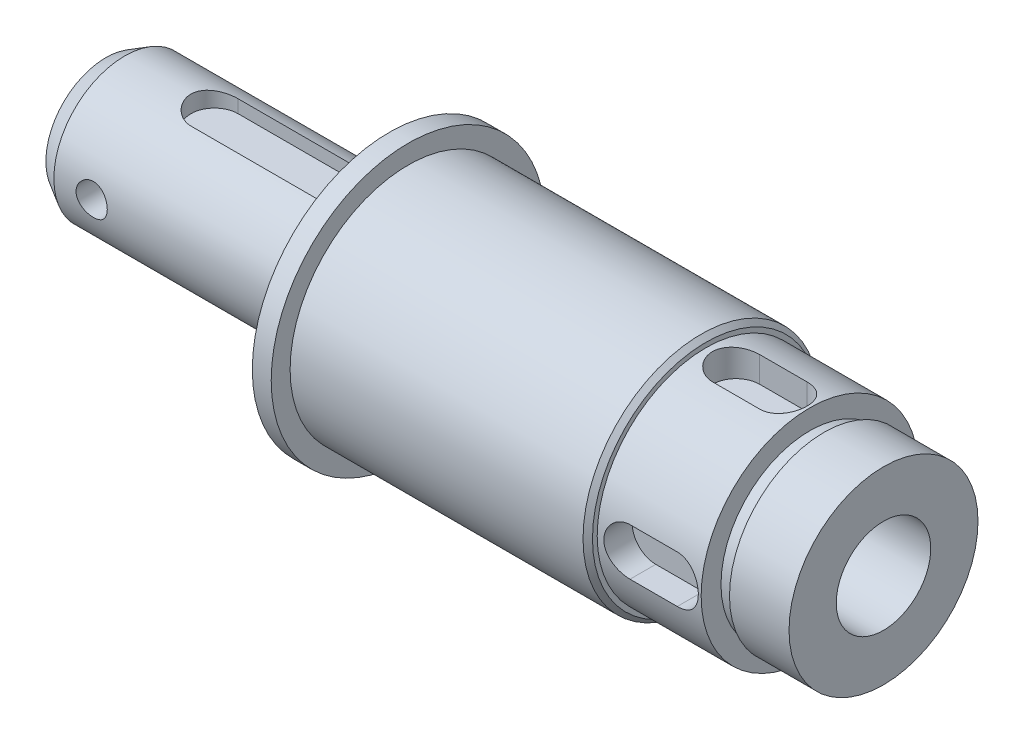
ISO-10303-21;
HEADER;
FILE_DESCRIPTION(('STEP AP214'),'2;1');
FILE_NAME('part.step','',(''),(''),'','','');
FILE_SCHEMA(('AUTOMOTIVE_DESIGN { 1 0 10303 214 1 1 1 1 }'));
ENDSEC;
DATA;
#1=APPLICATION_CONTEXT('core data for automotive mechanical design processes');
#2=APPLICATION_PROTOCOL_DEFINITION('international standard','automotive_design',2000,#1);
#3=PRODUCT_CONTEXT('',#1,'mechanical');
#4=PRODUCT('Part','Part','',(#3));
#5=PRODUCT_RELATED_PRODUCT_CATEGORY('part','',(#4));
#6=PRODUCT_DEFINITION_FORMATION('','',#4);
#7=PRODUCT_DEFINITION_CONTEXT('part definition',#1,'design');
#8=PRODUCT_DEFINITION('design','',#6,#7);
#9=PRODUCT_DEFINITION_SHAPE('','',#8);
#10=(LENGTH_UNIT() NAMED_UNIT(*) SI_UNIT(.MILLI.,.METRE.));
#11=(NAMED_UNIT(*) PLANE_ANGLE_UNIT() SI_UNIT($,.RADIAN.));
#12=(NAMED_UNIT(*) SI_UNIT($,.STERADIAN.) SOLID_ANGLE_UNIT());
#13=UNCERTAINTY_MEASURE_WITH_UNIT(LENGTH_MEASURE(1.E-05),#10,'distance_accuracy_value','');
#14=(GEOMETRIC_REPRESENTATION_CONTEXT(3) GLOBAL_UNCERTAINTY_ASSIGNED_CONTEXT((#13)) GLOBAL_UNIT_ASSIGNED_CONTEXT((#10,
#11,#12)) REPRESENTATION_CONTEXT('',''));
#15=CARTESIAN_POINT('',(0.,0.,0.));
#16=DIRECTION('',(0.,0.,1.));
#17=DIRECTION('',(1.,0.,0.));
#18=AXIS2_PLACEMENT_3D('',#15,#16,#17);
#19=CARTESIAN_POINT('',(0.,0.,0.));
#20=DIRECTION('',(-1.,0.,0.));
#21=DIRECTION('',(0.,0.,1.));
#22=AXIS2_PLACEMENT_3D('',#19,#20,#21);
#23=CYLINDRICAL_SURFACE('',#22,11.5);
#24=CARTESIAN_POINT('',(74.2,0.,11.5));
#25=CARTESIAN_POINT('',(74.1999952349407,-0.138677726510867,11.4999974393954));
#26=CARTESIAN_POINT('',(74.1884221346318,-0.277413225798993,11.4974660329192));
#27=CARTESIAN_POINT('',(74.1424827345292,-0.550944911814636,11.4876122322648));
#28=CARTESIAN_POINT('',(74.1081000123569,-0.685738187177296,11.4802863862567));
#29=CARTESIAN_POINT('',(74.0176680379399,-0.947392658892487,11.4616595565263));
#30=CARTESIAN_POINT('',(73.961641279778,-1.07426193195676,11.4503627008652));
#31=CARTESIAN_POINT('',(73.8295826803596,-1.3167947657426,11.4250137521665));
#32=CARTESIAN_POINT('',(73.7535514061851,-1.43245864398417,11.4109617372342));
#33=CARTESIAN_POINT('',(73.5823655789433,-1.65113687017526,11.3813931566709));
#34=CARTESIAN_POINT('',(73.4869545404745,-1.75394802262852,11.3658586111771));
#35=CARTESIAN_POINT('',(73.280268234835,-1.94224066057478,11.3352028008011));
#36=CARTESIAN_POINT('',(73.1689915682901,-2.02772061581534,11.3200815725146));
#37=CARTESIAN_POINT('',(72.9322333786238,-2.17981857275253,11.2917873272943));
#38=CARTESIAN_POINT('',(72.8066101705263,-2.24622069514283,11.2786373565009));
#39=CARTESIAN_POINT('',(72.545655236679,-2.35689344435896,11.2560323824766));
#40=CARTESIAN_POINT('',(72.4103246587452,-2.40116668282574,11.2465769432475));
#41=CARTESIAN_POINT('',(72.135999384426,-2.46565424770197,11.2326146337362));
#42=CARTESIAN_POINT('',(71.9970930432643,-2.48622809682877,11.2280338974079));
#43=CARTESIAN_POINT('',(71.7177305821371,-2.50385066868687,11.224117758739));
#44=CARTESIAN_POINT('',(71.5772746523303,-2.50090224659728,11.2247817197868));
#45=CARTESIAN_POINT('',(71.3014696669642,-2.47185339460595,11.2312130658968));
#46=CARTESIAN_POINT('',(71.1660741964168,-2.44617020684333,11.2368884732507));
#47=CARTESIAN_POINT('',(70.9015608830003,-2.37304173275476,11.2525578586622));
#48=CARTESIAN_POINT('',(70.7724433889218,-2.32559523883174,11.2625520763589));
#49=CARTESIAN_POINT('',(70.5229760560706,-2.20990273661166,11.2858238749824));
#50=CARTESIAN_POINT('',(70.4027032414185,-2.1414959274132,11.299126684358));
#51=CARTESIAN_POINT('',(70.1751891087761,-1.98593770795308,11.3275012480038));
#52=CARTESIAN_POINT('',(70.0679495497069,-1.89878377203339,11.3425732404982));
#53=CARTESIAN_POINT('',(69.8671434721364,-1.70599474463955,11.3731828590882));
#54=CARTESIAN_POINT('',(69.7739178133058,-1.60000476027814,11.3887235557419));
#55=CARTESIAN_POINT('',(69.6065096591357,-1.37371962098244,11.4182263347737));
#56=CARTESIAN_POINT('',(69.5323275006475,-1.25342421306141,11.4321883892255));
#57=CARTESIAN_POINT('',(69.4050294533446,-1.00152969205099,11.4570051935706));
#58=CARTESIAN_POINT('',(69.3519578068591,-0.869907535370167,11.4678534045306));
#59=CARTESIAN_POINT('',(69.2687792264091,-0.599325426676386,11.4851715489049));
#60=CARTESIAN_POINT('',(69.2386689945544,-0.46036653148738,11.4916421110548));
#61=CARTESIAN_POINT('',(69.202762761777,-0.181979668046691,11.4993865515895));
#62=CARTESIAN_POINT('',(69.1965010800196,-0.0426144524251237,11.5007599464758));
#63=CARTESIAN_POINT('',(69.2072080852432,0.235170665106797,11.4984339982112));
#64=CARTESIAN_POINT('',(69.2241752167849,0.373590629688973,11.4947349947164));
#65=CARTESIAN_POINT('',(69.2804720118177,0.644016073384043,11.4827426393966));
#66=CARTESIAN_POINT('',(69.3195578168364,0.776074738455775,11.474499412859));
#67=CARTESIAN_POINT('',(69.4187120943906,1.03176169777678,11.4543411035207));
#68=CARTESIAN_POINT('',(69.4787823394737,1.15538927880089,11.4424257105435));
#69=CARTESIAN_POINT('',(69.6191733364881,1.39263316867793,11.4159991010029));
#70=CARTESIAN_POINT('',(69.6997681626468,1.50608338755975,11.4014535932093));
#71=CARTESIAN_POINT('',(69.8785591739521,1.71801618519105,11.3714509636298));
#72=CARTESIAN_POINT('',(69.9767576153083,1.81649684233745,11.3559937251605));
#73=CARTESIAN_POINT('',(70.190104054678,1.99753288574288,11.325566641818));
#74=CARTESIAN_POINT('',(70.3055278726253,2.07976600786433,11.310610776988));
#75=CARTESIAN_POINT('',(70.5488215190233,2.22368179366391,11.2832011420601));
#76=CARTESIAN_POINT('',(70.6766908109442,2.2853653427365,11.2707472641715));
#77=CARTESIAN_POINT('',(70.9405621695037,2.38601708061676,11.2498696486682));
#78=CARTESIAN_POINT('',(71.0765138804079,2.42511238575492,11.2414234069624));
#79=CARTESIAN_POINT('',(71.3532639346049,2.47985131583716,11.2294762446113));
#80=CARTESIAN_POINT('',(71.4940615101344,2.49549863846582,11.2259745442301));
#81=CARTESIAN_POINT('',(71.7732583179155,2.50274155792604,11.2243616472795));
#82=CARTESIAN_POINT('',(71.9116438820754,2.49484798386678,11.2261359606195));
#83=CARTESIAN_POINT('',(72.1850625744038,2.45637409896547,11.2346164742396));
#84=CARTESIAN_POINT('',(72.3200957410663,2.42579404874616,11.2413226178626));
#85=CARTESIAN_POINT('',(72.5825767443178,2.34306069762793,11.2588557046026));
#86=CARTESIAN_POINT('',(72.7100487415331,2.29098087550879,11.2696686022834));
#87=CARTESIAN_POINT('',(72.9545220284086,2.16678978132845,11.2942025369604));
#88=CARTESIAN_POINT('',(73.0715222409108,2.09467645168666,11.3079238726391));
#89=CARTESIAN_POINT('',(73.2942508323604,1.93076731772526,11.3370712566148));
#90=CARTESIAN_POINT('',(73.3997073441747,1.83860709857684,11.3525258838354));
#91=CARTESIAN_POINT('',(73.5938260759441,1.63795982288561,11.3832055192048));
#92=CARTESIAN_POINT('',(73.6824844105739,1.52946899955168,11.3984304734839));
#93=CARTESIAN_POINT('',(73.841573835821,1.29756952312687,11.4271660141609));
#94=CARTESIAN_POINT('',(73.9117574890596,1.17398793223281,11.4406522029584));
#95=CARTESIAN_POINT('',(74.0302458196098,0.916515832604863,11.4641462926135));
#96=CARTESIAN_POINT('',(74.0785689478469,0.782634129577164,11.4741571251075));
#97=CARTESIAN_POINT('',(74.1432968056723,0.540505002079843,11.4877745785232));
#98=CARTESIAN_POINT('',(74.1645201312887,0.433572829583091,11.4923308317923));
#99=CARTESIAN_POINT('',(74.1928732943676,0.217772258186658,11.4984444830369));
#100=CARTESIAN_POINT('',(74.2000037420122,0.108903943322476,11.5000020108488));
#101=CARTESIAN_POINT('',(74.2,0.,11.5));
#102=B_SPLINE_CURVE_WITH_KNOTS('',3,(#24,#25,#26,#27,#28,#29,#30,#31,#32,#33,#34,#35,#36,#37,
#38,#39,#40,#41,#42,#43,#44,#45,#46,#47,#48,#49,#50,#51,#52,#53,#54,#55,#56,#57,#58,#59,#60,#61,
#62,#63,#64,#65,#66,#67,#68,#69,#70,#71,#72,#73,#74,#75,#76,#77,#78,#79,#80,#81,#82,#83,#84,#85,
#86,#87,#88,#89,#90,#91,#92,#93,#94,#95,#96,#97,#98,#99,#100,#101),.UNSPECIFIED.,.T.,.F.,(4,2,2,
2,2,2,2,2,2,2,2,2,2,2,2,2,2,2,2,2,2,2,2,2,2,2,2,2,2,2,2,2,2,2,2,2,2,2,4),(0.,0.415634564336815,
0.831568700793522,1.2470717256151,1.66256297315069,2.08396070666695,2.50539563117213,
2.93142680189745,3.35740768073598,3.77683755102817,4.19621651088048,4.60805475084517,
5.01991584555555,5.43501926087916,5.85017863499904,6.2742029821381,6.69823482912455,
7.12315071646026,7.54800556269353,7.96452059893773,8.38100774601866,8.79299016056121,
9.20500738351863,9.62284481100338,10.0407358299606,10.4662282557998,10.8917023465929,
11.3147581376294,11.7377472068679,12.151624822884,12.5654976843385,12.9779676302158,
13.390479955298,13.8112329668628,14.2320831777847,14.6583121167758,15.0841806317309,
15.4105935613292,15.73699235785),.UNSPECIFIED.);
#103=CARTESIAN_POINT('',(71.7,2.5,11.2249721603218));
#104=VERTEX_POINT('',#103);
#105=CARTESIAN_POINT('',(71.7,-2.5,11.2249721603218));
#106=VERTEX_POINT('',#105);
#107=EDGE_CURVE('E403',#104,#106,#102,.T.);
#108=ORIENTED_EDGE('',*,*,#107,.T.);
#109=DIRECTION('',(-1.,0.,0.));
#110=VECTOR('',#109,1.);
#111=CARTESIAN_POINT('',(0.,-2.5,11.2249721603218));
#112=LINE('',#111,#110);
#113=CARTESIAN_POINT('',(66.7,-2.5,11.2249721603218));
#114=VERTEX_POINT('',#113);
#115=EDGE_CURVE('E425',#106,#114,#112,.T.);
#116=ORIENTED_EDGE('',*,*,#115,.T.);
#117=CARTESIAN_POINT('',(66.7,-2.5,11.2249721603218));
#118=CARTESIAN_POINT('',(66.630573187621,-2.50000770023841,11.2249655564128));
#119=CARTESIAN_POINT('',(66.5611507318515,-2.49710804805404,11.2256161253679));
#120=CARTESIAN_POINT('',(66.4228192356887,-2.48555379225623,11.2281826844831));
#121=CARTESIAN_POINT('',(66.3539101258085,-2.47689998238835,11.2300985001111));
#122=CARTESIAN_POINT('',(66.2172046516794,-2.45391630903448,11.2351424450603));
#123=CARTESIAN_POINT('',(66.1494066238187,-2.439595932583,11.238268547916));
#124=CARTESIAN_POINT('',(66.0153050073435,-2.4054079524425,11.2456354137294));
#125=CARTESIAN_POINT('',(65.9490014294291,-2.38554030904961,11.2498761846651));
#126=CARTESIAN_POINT('',(65.7530213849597,-2.31782041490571,11.2640963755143));
#127=CARTESIAN_POINT('',(65.6261580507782,-2.26183127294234,11.2755783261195));
#128=CARTESIAN_POINT('',(65.3836691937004,-2.12987388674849,11.3012444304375));
#129=CARTESIAN_POINT('',(65.2680454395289,-2.05390250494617,11.3154290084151));
#130=CARTESIAN_POINT('',(65.0493354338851,-1.88277923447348,11.3451653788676));
#131=CARTESIAN_POINT('',(64.9464609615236,-1.78735916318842,11.3607343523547));
#132=CARTESIAN_POINT('',(64.7580416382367,-1.58062227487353,11.3913359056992));
#133=CARTESIAN_POINT('',(64.6724994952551,-1.46930297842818,11.4063684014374));
#134=CARTESIAN_POINT('',(64.5203327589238,-1.2325004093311,11.4343903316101));
#135=CARTESIAN_POINT('',(64.453913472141,-1.10688226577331,11.4473569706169));
#136=CARTESIAN_POINT('',(64.3432109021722,-0.845945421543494,11.4695901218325));
#137=CARTESIAN_POINT('',(64.2989239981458,-0.710628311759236,11.4788572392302));
#138=CARTESIAN_POINT('',(64.234409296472,-0.436350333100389,11.4925259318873));
#139=CARTESIAN_POINT('',(64.213819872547,-0.297478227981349,11.4970005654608));
#140=CARTESIAN_POINT('',(64.1961541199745,-0.0181805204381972,11.5008332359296));
#141=CARTESIAN_POINT('',(64.199075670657,0.12224494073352,11.5001917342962));
#142=CARTESIAN_POINT('',(64.2280800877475,0.398164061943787,11.4939201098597));
#143=CARTESIAN_POINT('',(64.2537726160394,0.533700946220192,11.4883740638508));
#144=CARTESIAN_POINT('',(64.3269676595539,0.798491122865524,11.4730123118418));
#145=CARTESIAN_POINT('',(64.3744709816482,0.927744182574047,11.4631964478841));
#146=CARTESIAN_POINT('',(64.4902863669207,1.17738648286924,11.44026237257));
#147=CARTESIAN_POINT('',(64.5587470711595,1.29770452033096,11.4271206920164));
#148=CARTESIAN_POINT('',(64.7144213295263,1.52528342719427,11.3989770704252));
#149=CARTESIAN_POINT('',(64.8016368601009,1.63254291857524,11.383974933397));
#150=CARTESIAN_POINT('',(64.9944586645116,1.83327306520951,11.3533979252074));
#151=CARTESIAN_POINT('',(65.1004044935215,1.92641695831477,11.3378176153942));
#152=CARTESIAN_POINT('',(65.3266065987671,2.09369957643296,11.3081238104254));
#153=CARTESIAN_POINT('',(65.4468667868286,2.16783308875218,11.294010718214));
#154=CARTESIAN_POINT('',(65.6988261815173,2.29513678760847,11.2688326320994));
#155=CARTESIAN_POINT('',(65.8305633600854,2.34823389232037,11.2577783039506));
#156=CARTESIAN_POINT('',(66.1013046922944,2.43136742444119,11.2401196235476));
#157=CARTESIAN_POINT('',(66.2402976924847,2.46143819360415,11.233508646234));
#158=CARTESIAN_POINT('',(66.4336942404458,2.48635269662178,11.2280042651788));
#159=CARTESIAN_POINT('',(66.4868661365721,2.49147194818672,11.2268686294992));
#160=CARTESIAN_POINT('',(66.5933505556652,2.49829143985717,11.2253531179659));
#161=CARTESIAN_POINT('',(66.6466626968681,2.49999736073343,11.2249719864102));
#162=CARTESIAN_POINT('',(66.7,2.5,11.2249721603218));
#163=B_SPLINE_CURVE_WITH_KNOTS('',3,(#117,#118,#119,#120,#121,#122,#123,#124,#125,#126,#127,
#128,#129,#130,#131,#132,#133,#134,#135,#136,#137,#138,#139,#140,#141,#142,#143,#144,#145,#146,
#147,#148,#149,#150,#151,#152,#153,#154,#155,#156,#157,#158,#159,#160,#161,#162),.UNSPECIFIED.,
.F.,.F.,(4,2,2,2,2,2,2,2,2,2,2,2,2,2,2,2,2,2,2,2,2,2,4),(0.,0.208209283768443,0.416389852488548,
0.624223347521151,0.832058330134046,1.24737482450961,1.662756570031,2.08430932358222,
2.50592788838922,2.93191726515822,3.35783692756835,3.77716703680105,4.19645932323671,
4.60870022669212,5.02095638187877,5.43620702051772,5.85150144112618,6.27528690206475,
6.69918844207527,7.12454999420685,7.54927591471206,7.70947591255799,7.86940906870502),.UNSPECIFIED.);
#164=CARTESIAN_POINT('',(66.7,2.5,11.2249721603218));
#165=VERTEX_POINT('',#164);
#166=EDGE_CURVE('E62',#114,#165,#163,.T.);
#167=ORIENTED_EDGE('',*,*,#166,.T.);
#168=DIRECTION('',(-1.,0.,0.));
#169=VECTOR('',#168,1.);
#170=CARTESIAN_POINT('',(0.,2.5,11.2249721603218));
#171=LINE('',#170,#169);
#172=EDGE_CURVE('E879',#165,#104,#171,.F.);
#173=ORIENTED_EDGE('',*,*,#172,.T.);
#174=EDGE_LOOP('',(#108,#116,#167,#173));
#175=FACE_BOUND('',#174,.T.);
#176=DIRECTION('',(-1.,0.,0.));
#177=VECTOR('',#176,1.);
#178=CARTESIAN_POINT('',(0.,11.2249721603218,2.5));
#179=LINE('',#178,#177);
#180=CARTESIAN_POINT('',(71.7,11.2249721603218,2.5));
#181=VERTEX_POINT('',#180);
#182=CARTESIAN_POINT('',(66.7,11.2249721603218,2.5));
#183=VERTEX_POINT('',#182);
#184=EDGE_CURVE('E878',#181,#183,#179,.T.);
#185=ORIENTED_EDGE('',*,*,#184,.T.);
#186=CARTESIAN_POINT('',(66.7,11.2249721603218,2.5));
#187=CARTESIAN_POINT('',(66.630573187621,11.2249655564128,2.50000770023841));
#188=CARTESIAN_POINT('',(66.5611507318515,11.2256161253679,2.49710804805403));
#189=CARTESIAN_POINT('',(66.4228192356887,11.2281826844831,2.48555379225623));
#190=CARTESIAN_POINT('',(66.3539101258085,11.2300985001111,2.47689998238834));
#191=CARTESIAN_POINT('',(66.2172046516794,11.2351424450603,2.45391630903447));
#192=CARTESIAN_POINT('',(66.1494066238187,11.238268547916,2.43959593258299));
#193=CARTESIAN_POINT('',(66.0153050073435,11.2456354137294,2.40540795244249));
#194=CARTESIAN_POINT('',(65.9490014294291,11.2498761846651,2.38554030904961));
#195=CARTESIAN_POINT('',(65.7530213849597,11.2640963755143,2.3178204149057));
#196=CARTESIAN_POINT('',(65.6261580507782,11.2755783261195,2.26183127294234));
#197=CARTESIAN_POINT('',(65.3836691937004,11.3012444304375,2.12987388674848));
#198=CARTESIAN_POINT('',(65.2680454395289,11.3154290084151,2.05390250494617));
#199=CARTESIAN_POINT('',(65.0493354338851,11.3451653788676,1.88277923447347));
#200=CARTESIAN_POINT('',(64.9464609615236,11.3607343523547,1.78735916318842));
#201=CARTESIAN_POINT('',(64.7580416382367,11.3913359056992,1.58062227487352));
#202=CARTESIAN_POINT('',(64.6724994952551,11.4063684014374,1.46930297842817));
#203=CARTESIAN_POINT('',(64.5203327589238,11.4343903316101,1.2325004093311));
#204=CARTESIAN_POINT('',(64.453913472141,11.4473569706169,1.10688226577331));
#205=CARTESIAN_POINT('',(64.3432109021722,11.4695901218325,0.845945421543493));
#206=CARTESIAN_POINT('',(64.2989239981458,11.4788572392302,0.710628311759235));
#207=CARTESIAN_POINT('',(64.234409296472,11.4925259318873,0.436350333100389));
#208=CARTESIAN_POINT('',(64.213819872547,11.4970005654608,0.297478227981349));
#209=CARTESIAN_POINT('',(64.1961541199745,11.5008332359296,0.0181805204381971));
#210=CARTESIAN_POINT('',(64.199075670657,11.5001917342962,-0.12224494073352));
#211=CARTESIAN_POINT('',(64.2280800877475,11.4939201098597,-0.398164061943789));
#212=CARTESIAN_POINT('',(64.2537726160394,11.4883740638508,-0.533700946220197));
#213=CARTESIAN_POINT('',(64.3269676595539,11.4730123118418,-0.798491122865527));
#214=CARTESIAN_POINT('',(64.3744709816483,11.4631964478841,-0.927744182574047));
#215=CARTESIAN_POINT('',(64.4902863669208,11.44026237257,-1.17738648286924));
#216=CARTESIAN_POINT('',(64.5587470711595,11.4271206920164,-1.29770452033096));
#217=CARTESIAN_POINT('',(64.7144213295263,11.3989770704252,-1.52528342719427));
#218=CARTESIAN_POINT('',(64.8016368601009,11.383974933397,-1.63254291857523));
#219=CARTESIAN_POINT('',(64.9944586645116,11.3533979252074,-1.8332730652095));
#220=CARTESIAN_POINT('',(65.1004044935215,11.3378176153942,-1.92641695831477));
#221=CARTESIAN_POINT('',(65.3266065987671,11.3081238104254,-2.09369957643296));
#222=CARTESIAN_POINT('',(65.4468667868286,11.294010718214,-2.16783308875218));
#223=CARTESIAN_POINT('',(65.6988261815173,11.2688326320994,-2.29513678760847));
#224=CARTESIAN_POINT('',(65.8305633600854,11.2577783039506,-2.34823389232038));
#225=CARTESIAN_POINT('',(66.1013046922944,11.2401196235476,-2.4313674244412));
#226=CARTESIAN_POINT('',(66.2402976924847,11.233508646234,-2.46143819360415));
#227=CARTESIAN_POINT('',(66.4336942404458,11.2280042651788,-2.48635269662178));
#228=CARTESIAN_POINT('',(66.4868661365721,11.2268686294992,-2.49147194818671));
#229=CARTESIAN_POINT('',(66.5933505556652,11.2253531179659,-2.49829143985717));
#230=CARTESIAN_POINT('',(66.6466626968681,11.2249719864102,-2.49999736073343));
#231=CARTESIAN_POINT('',(66.7,11.2249721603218,-2.5));
#232=B_SPLINE_CURVE_WITH_KNOTS('',3,(#186,#187,#188,#189,#190,#191,#192,#193,#194,#195,#196,
#197,#198,#199,#200,#201,#202,#203,#204,#205,#206,#207,#208,#209,#210,#211,#212,#213,#214,#215,
#216,#217,#218,#219,#220,#221,#222,#223,#224,#225,#226,#227,#228,#229,#230,#231),.UNSPECIFIED.,
.F.,.F.,(4,2,2,2,2,2,2,2,2,2,2,2,2,2,2,2,2,2,2,2,2,2,4),(0.,0.208209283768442,0.416389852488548,
0.624223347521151,0.832058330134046,1.24737482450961,1.662756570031,2.08430932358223,
2.50592788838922,2.93191726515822,3.35783692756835,3.77716703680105,4.1964593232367,
4.60870022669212,5.02095638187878,5.43620702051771,5.85150144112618,6.27528690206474,
6.69918844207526,7.12454999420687,7.54927591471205,7.70947591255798,7.86940906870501),.UNSPECIFIED.);
#233=CARTESIAN_POINT('',(66.7,11.2249721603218,-2.5));
#234=VERTEX_POINT('',#233);
#235=EDGE_CURVE('E387',#183,#234,#232,.T.);
#236=ORIENTED_EDGE('',*,*,#235,.T.);
#237=DIRECTION('',(-1.,0.,0.));
#238=VECTOR('',#237,1.);
#239=CARTESIAN_POINT('',(0.,11.2249721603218,-2.5));
#240=LINE('',#239,#238);
#241=CARTESIAN_POINT('',(71.7,11.2249721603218,-2.5));
#242=VERTEX_POINT('',#241);
#243=EDGE_CURVE('E877',#234,#242,#240,.F.);
#244=ORIENTED_EDGE('',*,*,#243,.T.);
#245=CARTESIAN_POINT('',(71.7,11.2249721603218,2.5));
#246=CARTESIAN_POINT('',(71.5613659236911,11.2249749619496,2.49999520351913));
#247=CARTESIAN_POINT('',(71.4226739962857,11.2275684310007,2.48842914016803));
#248=CARTESIAN_POINT('',(71.1492327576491,11.2376433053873,2.44252022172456));
#249=CARTESIAN_POINT('',(71.0144863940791,11.2451282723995,2.40816076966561));
#250=CARTESIAN_POINT('',(70.752931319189,11.2640992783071,2.31779681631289));
#251=CARTESIAN_POINT('',(70.6261141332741,11.2755809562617,2.26181589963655));
#252=CARTESIAN_POINT('',(70.3836692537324,11.3012464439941,2.12986538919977));
#253=CARTESIAN_POINT('',(70.2680413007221,11.3154301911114,2.05389625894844));
#254=CARTESIAN_POINT('',(70.0493253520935,11.3451661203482,1.8827743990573));
#255=CARTESIAN_POINT('',(69.9464512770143,11.3607356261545,1.78735121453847));
#256=CARTESIAN_POINT('',(69.7580363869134,11.3913370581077,1.58061383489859));
#257=CARTESIAN_POINT('',(69.6724969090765,11.4063689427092,1.46929841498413));
#258=CARTESIAN_POINT('',(69.5203343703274,11.434389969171,1.23250346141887));
#259=CARTESIAN_POINT('',(69.4539168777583,11.4473562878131,1.10688889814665));
#260=CARTESIAN_POINT('',(69.3432133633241,11.4695896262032,0.845952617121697));
#261=CARTESIAN_POINT('',(69.2989248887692,11.478857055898,0.710631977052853));
#262=CARTESIAN_POINT('',(69.2344088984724,11.4925260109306,0.436348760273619));
#263=CARTESIAN_POINT('',(69.2138193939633,11.4970006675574,0.297475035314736));
#264=CARTESIAN_POINT('',(69.1961541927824,11.5008332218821,0.0181772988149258));
#265=CARTESIAN_POINT('',(69.1990758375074,11.5001916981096,-0.122246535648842));
#266=CARTESIAN_POINT('',(69.2280800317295,11.4939201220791,-0.398163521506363));
#267=CARTESIAN_POINT('',(69.2537724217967,11.4883741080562,-0.533699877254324));
#268=CARTESIAN_POINT('',(69.3269672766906,11.4730123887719,-0.798490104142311));
#269=CARTESIAN_POINT('',(69.3744707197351,11.4631964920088,-0.927743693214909));
#270=CARTESIAN_POINT('',(69.4902855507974,11.4402625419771,-1.17738464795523));
#271=CARTESIAN_POINT('',(69.5587451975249,11.4271210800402,-1.29770099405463));
#272=CARTESIAN_POINT('',(69.714418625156,11.3989775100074,-1.52528026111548));
#273=CARTESIAN_POINT('',(69.8016349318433,11.3839751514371,-1.63254142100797));
#274=CARTESIAN_POINT('',(69.9944712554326,11.353396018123,-1.83328565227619));
#275=CARTESIAN_POINT('',(70.1004327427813,11.3378137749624,-1.92644015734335));
#276=CARTESIAN_POINT('',(70.3266345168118,11.3081202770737,-2.09371791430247));
#277=CARTESIAN_POINT('',(70.4468751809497,11.2940090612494,-2.16784066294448));
#278=CARTESIAN_POINT('',(70.6987489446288,11.2688411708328,-2.29509442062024));
#279=CARTESIAN_POINT('',(70.8304140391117,11.257793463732,-2.34816399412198));
#280=CARTESIAN_POINT('',(71.1010903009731,11.2401282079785,-2.43132557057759));
#281=CARTESIAN_POINT('',(71.2401003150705,11.2335099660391,-2.46142116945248));
#282=CARTESIAN_POINT('',(71.5185199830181,11.2255941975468,-2.49727222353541));
#283=CARTESIAN_POINT('',(71.6578651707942,11.2241921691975,-2.50350580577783));
#284=CARTESIAN_POINT('',(71.9356037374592,11.2265857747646,-2.49274977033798));
#285=CARTESIAN_POINT('',(72.0739971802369,11.2303810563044,-2.47576172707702));
#286=CARTESIAN_POINT('',(72.3442432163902,11.2426430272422,-2.41945931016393));
#287=CARTESIAN_POINT('',(72.4761532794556,11.2510547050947,-2.38040769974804));
#288=CARTESIAN_POINT('',(72.7315579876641,11.2715521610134,-2.28137092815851));
#289=CARTESIAN_POINT('',(72.8550518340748,11.2836382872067,-2.22138378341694));
#290=CARTESIAN_POINT('',(73.0921893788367,11.3103528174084,-2.08112322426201));
#291=CARTESIAN_POINT('',(73.2056545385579,11.3250171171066,-2.00055493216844));
#292=CARTESIAN_POINT('',(73.4176296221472,11.3551407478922,-1.82180549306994));
#293=CARTESIAN_POINT('',(73.5161377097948,11.370600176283,-1.72362218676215));
#294=CARTESIAN_POINT('',(73.6972550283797,11.4009162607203,-1.51026745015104));
#295=CARTESIAN_POINT('',(73.7795384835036,11.4157565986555,-1.39481675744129));
#296=CARTESIAN_POINT('',(73.9235425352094,11.4428633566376,-1.15145379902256));
#297=CARTESIAN_POINT('',(73.9852640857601,11.4551298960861,-1.02354211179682));
#298=CARTESIAN_POINT('',(74.0859370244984,11.475638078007,-0.759679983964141));
#299=CARTESIAN_POINT('',(74.125031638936,11.4839049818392,-0.623786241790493));
#300=CARTESIAN_POINT('',(74.1797887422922,11.4955915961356,-0.347160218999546));
#301=CARTESIAN_POINT('',(74.1954545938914,11.4990120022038,-0.206428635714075));
#302=CARTESIAN_POINT('',(74.2027598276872,11.5005998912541,0.0727841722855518));
#303=CARTESIAN_POINT('',(74.1948858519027,11.4988737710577,0.211252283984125));
#304=CARTESIAN_POINT('',(74.156422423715,11.4905901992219,0.48484135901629));
#305=CARTESIAN_POINT('',(74.1258333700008,11.4840328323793,0.619962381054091));
#306=CARTESIAN_POINT('',(74.0430400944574,11.4668310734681,0.882650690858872));
#307=CARTESIAN_POINT('',(73.9909041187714,11.4561995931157,1.01024038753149));
#308=CARTESIAN_POINT('',(73.8665637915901,11.4319855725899,1.2549262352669));
#309=CARTESIAN_POINT('',(73.7943575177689,11.4184027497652,1.37202137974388));
#310=CARTESIAN_POINT('',(73.6303354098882,11.3894500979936,1.59477039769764));
#311=CARTESIAN_POINT('',(73.5381769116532,11.3740515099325,1.70016823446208));
#312=CARTESIAN_POINT('',(73.3375585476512,11.3433589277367,1.89416939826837));
#313=CARTESIAN_POINT('',(73.2290947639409,11.3280649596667,1.9827686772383));
#314=CARTESIAN_POINT('',(72.9972268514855,11.299088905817,2.14178094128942));
#315=CARTESIAN_POINT('',(72.8736447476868,11.2854307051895,2.21193900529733));
#316=CARTESIAN_POINT('',(72.6161743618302,11.2615722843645,2.33037936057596));
#317=CARTESIAN_POINT('',(72.4822949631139,11.2513691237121,2.37868026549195));
#318=CARTESIAN_POINT('',(72.2402219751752,11.2374736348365,2.44335658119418));
#319=CARTESIAN_POINT('',(72.1333467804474,11.2328165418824,2.46455733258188));
#320=CARTESIAN_POINT('',(71.9176595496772,11.2265647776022,2.49288059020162));
#321=CARTESIAN_POINT('',(71.8088476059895,11.2249699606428,2.50000376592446));
#322=CARTESIAN_POINT('',(71.7,11.2249721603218,2.5));
#323=B_SPLINE_CURVE_WITH_KNOTS('',3,(#245,#246,#247,#248,#249,#250,#251,#252,#253,#254,#255,
#256,#257,#258,#259,#260,#261,#262,#263,#264,#265,#266,#267,#268,#269,#270,#271,#272,#273,#274,
#275,#276,#277,#278,#279,#280,#281,#282,#283,#284,#285,#286,#287,#288,#289,#290,#291,#292,#293,
#294,#295,#296,#297,#298,#299,#300,#301,#302,#303,#304,#305,#306,#307,#308,#309,#310,#311,#312,
#313,#314,#315,#316,#317,#318,#319,#320,#321,#322),.UNSPECIFIED.,.T.,.F.,(4,2,2,2,2,2,2,2,2,2,2,
2,2,2,2,2,2,2,2,2,2,2,2,2,2,2,2,2,2,2,2,2,2,2,2,2,2,2,4),(0.,0.415503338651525,
0.831309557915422,1.24666349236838,1.66200779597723,2.08357720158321,2.50517911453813,
2.93115724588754,3.35708815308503,3.77642305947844,4.19571054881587,4.60794983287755,
5.02020760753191,5.43545216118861,5.85075266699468,6.27459056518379,6.69843966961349,
7.12351667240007,7.54852712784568,7.96497559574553,8.38139582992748,8.79295824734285,
9.20455966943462,9.62242603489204,10.0403436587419,10.4659485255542,10.8915336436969,
11.3143945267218,11.7371947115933,12.1513151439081,12.5654283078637,12.9782397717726,
13.3910907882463,13.8116917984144,14.2323940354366,14.6586377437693,15.0845177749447,
15.410762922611,15.7369925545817),.UNSPECIFIED.);
#324=EDGE_CURVE('E395',#242,#181,#323,.T.);
#325=ORIENTED_EDGE('',*,*,#324,.T.);
#326=EDGE_LOOP('',(#185,#236,#244,#325));
#327=FACE_BOUND('',#326,.T.);
#328=CARTESIAN_POINT('',(63.5,0.,0.));
#329=DIRECTION('',(-1.,0.,0.));
#330=DIRECTION('',(0.,0.,1.));
#331=AXIS2_PLACEMENT_3D('',#328,#329,#330);
#332=CIRCLE('',#331,11.5);
#333=CARTESIAN_POINT('',(63.5,0.,11.5));
#334=VERTEX_POINT('',#333);
#335=EDGE_CURVE('E891',#334,#334,#332,.T.);
#336=ORIENTED_EDGE('',*,*,#335,.F.);
#337=EDGE_LOOP('',(#336));
#338=FACE_BOUND('',#337,.T.);
#339=CARTESIAN_POINT('',(74.5,0.,0.));
#340=DIRECTION('',(-1.,0.,0.));
#341=DIRECTION('',(0.,0.,1.));
#342=AXIS2_PLACEMENT_3D('',#339,#340,#341);
#343=CIRCLE('',#342,11.5);
#344=CARTESIAN_POINT('',(74.5,0.,11.5));
#345=VERTEX_POINT('',#344);
#346=EDGE_CURVE('E895',#345,#345,#343,.T.);
#347=ORIENTED_EDGE('',*,*,#346,.T.);
#348=EDGE_LOOP('',(#347));
#349=FACE_BOUND('',#348,.T.);
#350=CARTESIAN_POINT('',(66.7,-11.2249721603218,-2.5));
#351=CARTESIAN_POINT('',(66.8386340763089,-11.2249749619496,-2.49999520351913));
#352=CARTESIAN_POINT('',(66.9773260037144,-11.2275684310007,-2.48842914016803));
#353=CARTESIAN_POINT('',(67.2507672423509,-11.2376433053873,-2.44252022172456));
#354=CARTESIAN_POINT('',(67.3855136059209,-11.2451282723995,-2.40816076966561));
#355=CARTESIAN_POINT('',(67.647068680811,-11.2640992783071,-2.31779681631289));
#356=CARTESIAN_POINT('',(67.7738858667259,-11.2755809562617,-2.26181589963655));
#357=CARTESIAN_POINT('',(68.0163307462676,-11.3012464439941,-2.12986538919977));
#358=CARTESIAN_POINT('',(68.1319586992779,-11.3154301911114,-2.05389625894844));
#359=CARTESIAN_POINT('',(68.3506746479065,-11.3451661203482,-1.8827743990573));
#360=CARTESIAN_POINT('',(68.4535487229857,-11.3607356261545,-1.78735121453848));
#361=CARTESIAN_POINT('',(68.6419636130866,-11.3913370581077,-1.5806138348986));
#362=CARTESIAN_POINT('',(68.7275030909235,-11.4063689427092,-1.46929841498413));
#363=CARTESIAN_POINT('',(68.8796656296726,-11.434389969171,-1.23250346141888));
#364=CARTESIAN_POINT('',(68.9460831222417,-11.4473562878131,-1.10688889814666));
#365=CARTESIAN_POINT('',(69.0567866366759,-11.4695896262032,-0.845952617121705));
#366=CARTESIAN_POINT('',(69.1010751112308,-11.478857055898,-0.710631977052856));
#367=CARTESIAN_POINT('',(69.1655911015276,-11.4925260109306,-0.436348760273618));
#368=CARTESIAN_POINT('',(69.1861806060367,-11.4970006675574,-0.297475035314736));
#369=CARTESIAN_POINT('',(69.2038458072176,-11.5008332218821,-0.0181772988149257));
#370=CARTESIAN_POINT('',(69.2009241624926,-11.5001916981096,0.122246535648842));
#371=CARTESIAN_POINT('',(69.1719199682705,-11.4939201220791,0.398163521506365));
#372=CARTESIAN_POINT('',(69.1462275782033,-11.4883741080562,0.533699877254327));
#373=CARTESIAN_POINT('',(69.0730327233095,-11.4730123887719,0.798490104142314));
#374=CARTESIAN_POINT('',(69.0255292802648,-11.4631964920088,0.92774369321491));
#375=CARTESIAN_POINT('',(68.9097144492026,-11.4402625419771,1.17738464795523));
#376=CARTESIAN_POINT('',(68.8412548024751,-11.4271210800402,1.29770099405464));
#377=CARTESIAN_POINT('',(68.685581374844,-11.3989775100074,1.52528026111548));
#378=CARTESIAN_POINT('',(68.5983650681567,-11.3839751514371,1.63254142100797));
#379=CARTESIAN_POINT('',(68.4055287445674,-11.353396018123,1.83328565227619));
#380=CARTESIAN_POINT('',(68.2995672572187,-11.3378137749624,1.92644015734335));
#381=CARTESIAN_POINT('',(68.0733654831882,-11.3081202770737,2.09371791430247));
#382=CARTESIAN_POINT('',(67.9531248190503,-11.2940090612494,2.16784066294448));
#383=CARTESIAN_POINT('',(67.7012510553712,-11.2688411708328,2.29509442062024));
#384=CARTESIAN_POINT('',(67.5695859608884,-11.257793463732,2.34816399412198));
#385=CARTESIAN_POINT('',(67.2989096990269,-11.2401282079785,2.43132557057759));
#386=CARTESIAN_POINT('',(67.1598996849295,-11.2335099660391,2.46142116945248));
#387=CARTESIAN_POINT('',(66.8814800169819,-11.2255941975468,2.49727222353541));
#388=CARTESIAN_POINT('',(66.7421348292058,-11.2241921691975,2.50350580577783));
#389=CARTESIAN_POINT('',(66.4643962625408,-11.2265857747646,2.49274977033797));
#390=CARTESIAN_POINT('',(66.3260028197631,-11.2303810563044,2.47576172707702));
#391=CARTESIAN_POINT('',(66.0557567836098,-11.2426430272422,2.41945931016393));
#392=CARTESIAN_POINT('',(65.9238467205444,-11.2510547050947,2.38040769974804));
#393=CARTESIAN_POINT('',(65.6684420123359,-11.2715521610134,2.28137092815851));
#394=CARTESIAN_POINT('',(65.5449481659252,-11.2836382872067,2.22138378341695));
#395=CARTESIAN_POINT('',(65.3078106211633,-11.3103528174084,2.08112322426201));
#396=CARTESIAN_POINT('',(65.1943454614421,-11.3250171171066,2.00055493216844));
#397=CARTESIAN_POINT('',(64.9823703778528,-11.3551407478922,1.82180549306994));
#398=CARTESIAN_POINT('',(64.8838622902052,-11.370600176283,1.72362218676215));
#399=CARTESIAN_POINT('',(64.7027449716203,-11.4009162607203,1.51026745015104));
#400=CARTESIAN_POINT('',(64.6204615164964,-11.4157565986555,1.39481675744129));
#401=CARTESIAN_POINT('',(64.4764574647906,-11.4428633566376,1.15145379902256));
#402=CARTESIAN_POINT('',(64.4147359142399,-11.4551298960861,1.02354211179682));
#403=CARTESIAN_POINT('',(64.3140629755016,-11.475638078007,0.759679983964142));
#404=CARTESIAN_POINT('',(64.274968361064,-11.4839049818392,0.623786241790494));
#405=CARTESIAN_POINT('',(64.2202112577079,-11.4955915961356,0.347160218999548));
#406=CARTESIAN_POINT('',(64.2045454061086,-11.4990120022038,0.206428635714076));
#407=CARTESIAN_POINT('',(64.1972401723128,-11.5005998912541,-0.0727841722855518));
#408=CARTESIAN_POINT('',(64.2051141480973,-11.4988737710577,-0.211252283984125));
#409=CARTESIAN_POINT('',(64.243577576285,-11.4905901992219,-0.48484135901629));
#410=CARTESIAN_POINT('',(64.2741666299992,-11.4840328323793,-0.619962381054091));
#411=CARTESIAN_POINT('',(64.3569599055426,-11.4668310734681,-0.882650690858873));
#412=CARTESIAN_POINT('',(64.4090958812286,-11.4561995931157,-1.01024038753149));
#413=CARTESIAN_POINT('',(64.5334362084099,-11.4319855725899,-1.2549262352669));
#414=CARTESIAN_POINT('',(64.6056424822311,-11.4184027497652,-1.37202137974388));
#415=CARTESIAN_POINT('',(64.7696645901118,-11.3894500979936,-1.59477039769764));
#416=CARTESIAN_POINT('',(64.8618230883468,-11.3740515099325,-1.70016823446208));
#417=CARTESIAN_POINT('',(65.0624414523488,-11.3433589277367,-1.89416939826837));
#418=CARTESIAN_POINT('',(65.1709052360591,-11.3280649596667,-1.9827686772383));
#419=CARTESIAN_POINT('',(65.4027731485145,-11.299088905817,-2.14178094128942));
#420=CARTESIAN_POINT('',(65.5263552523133,-11.2854307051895,-2.21193900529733));
#421=CARTESIAN_POINT('',(65.7838256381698,-11.2615722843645,-2.33037936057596));
#422=CARTESIAN_POINT('',(65.9177050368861,-11.2513691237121,-2.37868026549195));
#423=CARTESIAN_POINT('',(66.1597780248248,-11.2374736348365,-2.44335658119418));
#424=CARTESIAN_POINT('',(66.2666532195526,-11.2328165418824,-2.46455733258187));
#425=CARTESIAN_POINT('',(66.4823404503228,-11.2265647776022,-2.49288059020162));
#426=CARTESIAN_POINT('',(66.5911523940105,-11.2249699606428,-2.50000376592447));
#427=CARTESIAN_POINT('',(66.7,-11.2249721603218,-2.5));
#428=B_SPLINE_CURVE_WITH_KNOTS('',3,(#350,#351,#352,#353,#354,#355,#356,#357,#358,#359,#360,
#361,#362,#363,#364,#365,#366,#367,#368,#369,#370,#371,#372,#373,#374,#375,#376,#377,#378,#379,
#380,#381,#382,#383,#384,#385,#386,#387,#388,#389,#390,#391,#392,#393,#394,#395,#396,#397,#398,
#399,#400,#401,#402,#403,#404,#405,#406,#407,#408,#409,#410,#411,#412,#413,#414,#415,#416,#417,
#418,#419,#420,#421,#422,#423,#424,#425,#426,#427),.UNSPECIFIED.,.T.,.F.,(4,2,2,2,2,2,2,2,2,2,2,
2,2,2,2,2,2,2,2,2,2,2,2,2,2,2,2,2,2,2,2,2,2,2,2,2,2,2,4),(0.,0.415503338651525,
0.831309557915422,1.24666349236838,1.66200779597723,2.08357720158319,2.50517911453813,
2.93115724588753,3.35708815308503,3.77642305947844,4.19571054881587,4.60794983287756,
5.02020760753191,5.43545216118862,5.85075266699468,6.27459056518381,6.69843966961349,
7.12351667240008,7.54852712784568,7.96497559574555,8.38139582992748,8.79295824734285,
9.20455966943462,9.62242603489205,10.0403436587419,10.4659485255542,10.8915336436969,
11.3143945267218,11.7371947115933,12.1513151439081,12.5654283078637,12.9782397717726,
13.3910907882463,13.8116917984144,14.2323940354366,14.6586377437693,15.0845177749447,
15.410762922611,15.7369925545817),.UNSPECIFIED.);
#429=CARTESIAN_POINT('',(66.7,-11.2249721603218,2.5));
#430=VERTEX_POINT('',#429);
#431=CARTESIAN_POINT('',(66.7,-11.2249721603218,-2.5));
#432=VERTEX_POINT('',#431);
#433=EDGE_CURVE('E339',#430,#432,#428,.T.);
#434=ORIENTED_EDGE('',*,*,#433,.F.);
#435=DIRECTION('',(-1.,0.,0.));
#436=VECTOR('',#435,1.);
#437=CARTESIAN_POINT('',(0.,-11.2249721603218,2.5));
#438=LINE('',#437,#436);
#439=CARTESIAN_POINT('',(71.7,-11.2249721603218,2.5));
#440=VERTEX_POINT('',#439);
#441=EDGE_CURVE('E867',#440,#430,#438,.T.);
#442=ORIENTED_EDGE('',*,*,#441,.F.);
#443=CARTESIAN_POINT('',(71.7,-11.2249721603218,-2.5));
#444=CARTESIAN_POINT('',(71.8386340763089,-11.2249749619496,-2.49999520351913));
#445=CARTESIAN_POINT('',(71.9773260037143,-11.2275684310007,-2.48842914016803));
#446=CARTESIAN_POINT('',(72.2507672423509,-11.2376433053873,-2.44252022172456));
#447=CARTESIAN_POINT('',(72.3855136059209,-11.2451282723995,-2.40816076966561));
#448=CARTESIAN_POINT('',(72.647068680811,-11.2640992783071,-2.31779681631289));
#449=CARTESIAN_POINT('',(72.7738858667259,-11.2755809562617,-2.26181589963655));
#450=CARTESIAN_POINT('',(73.0163307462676,-11.3012464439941,-2.12986538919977));
#451=CARTESIAN_POINT('',(73.1319586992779,-11.3154301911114,-2.05389625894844));
#452=CARTESIAN_POINT('',(73.3506746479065,-11.3451661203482,-1.8827743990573));
#453=CARTESIAN_POINT('',(73.4535487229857,-11.3607356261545,-1.78735121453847));
#454=CARTESIAN_POINT('',(73.6419636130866,-11.3913370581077,-1.58061383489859));
#455=CARTESIAN_POINT('',(73.7275030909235,-11.4063689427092,-1.46929841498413));
#456=CARTESIAN_POINT('',(73.8796656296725,-11.434389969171,-1.23250346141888));
#457=CARTESIAN_POINT('',(73.9460831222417,-11.4473562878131,-1.10688889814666));
#458=CARTESIAN_POINT('',(74.0567866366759,-11.4695896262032,-0.845952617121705));
#459=CARTESIAN_POINT('',(74.1010751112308,-11.478857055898,-0.710631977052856));
#460=CARTESIAN_POINT('',(74.1655911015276,-11.4925260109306,-0.436348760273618));
#461=CARTESIAN_POINT('',(74.1861806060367,-11.4970006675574,-0.297475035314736));
#462=CARTESIAN_POINT('',(74.2038458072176,-11.5008332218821,-0.0181772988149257));
#463=CARTESIAN_POINT('',(74.2009241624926,-11.5001916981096,0.122246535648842));
#464=CARTESIAN_POINT('',(74.1719199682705,-11.4939201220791,0.398163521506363));
#465=CARTESIAN_POINT('',(74.1462275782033,-11.4883741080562,0.533699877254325));
#466=CARTESIAN_POINT('',(74.0730327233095,-11.4730123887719,0.798490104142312));
#467=CARTESIAN_POINT('',(74.0255292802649,-11.4631964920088,0.927743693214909));
#468=CARTESIAN_POINT('',(73.9097144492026,-11.4402625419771,1.17738464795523));
#469=CARTESIAN_POINT('',(73.8412548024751,-11.4271210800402,1.29770099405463));
#470=CARTESIAN_POINT('',(73.685581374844,-11.3989775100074,1.52528026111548));
#471=CARTESIAN_POINT('',(73.5983650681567,-11.3839751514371,1.63254142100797));
#472=CARTESIAN_POINT('',(73.4055287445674,-11.353396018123,1.83328565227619));
#473=CARTESIAN_POINT('',(73.2995672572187,-11.3378137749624,1.92644015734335));
#474=CARTESIAN_POINT('',(73.0733654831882,-11.3081202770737,2.09371791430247));
#475=CARTESIAN_POINT('',(72.9531248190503,-11.2940090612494,2.16784066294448));
#476=CARTESIAN_POINT('',(72.7012510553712,-11.2688411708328,2.29509442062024));
#477=CARTESIAN_POINT('',(72.5695859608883,-11.257793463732,2.34816399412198));
#478=CARTESIAN_POINT('',(72.2989096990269,-11.2401282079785,2.43132557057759));
#479=CARTESIAN_POINT('',(72.1598996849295,-11.2335099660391,2.46142116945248));
#480=CARTESIAN_POINT('',(71.8814800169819,-11.2255941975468,2.49727222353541));
#481=CARTESIAN_POINT('',(71.7421348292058,-11.2241921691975,2.50350580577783));
#482=CARTESIAN_POINT('',(71.4643962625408,-11.2265857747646,2.49274977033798));
#483=CARTESIAN_POINT('',(71.3260028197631,-11.2303810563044,2.47576172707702));
#484=CARTESIAN_POINT('',(71.0557567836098,-11.2426430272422,2.41945931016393));
#485=CARTESIAN_POINT('',(70.9238467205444,-11.2510547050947,2.38040769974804));
#486=CARTESIAN_POINT('',(70.6684420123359,-11.2715521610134,2.28137092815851));
#487=CARTESIAN_POINT('',(70.5449481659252,-11.2836382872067,2.22138378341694));
#488=CARTESIAN_POINT('',(70.3078106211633,-11.3103528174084,2.08112322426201));
#489=CARTESIAN_POINT('',(70.1943454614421,-11.3250171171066,2.00055493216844));
#490=CARTESIAN_POINT('',(69.9823703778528,-11.3551407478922,1.82180549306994));
#491=CARTESIAN_POINT('',(69.8838622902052,-11.370600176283,1.72362218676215));
#492=CARTESIAN_POINT('',(69.7027449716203,-11.4009162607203,1.51026745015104));
#493=CARTESIAN_POINT('',(69.6204615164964,-11.4157565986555,1.39481675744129));
#494=CARTESIAN_POINT('',(69.4764574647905,-11.4428633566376,1.15145379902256));
#495=CARTESIAN_POINT('',(69.4147359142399,-11.4551298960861,1.02354211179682));
#496=CARTESIAN_POINT('',(69.3140629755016,-11.475638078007,0.759679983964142));
#497=CARTESIAN_POINT('',(69.274968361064,-11.4839049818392,0.623786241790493));
#498=CARTESIAN_POINT('',(69.2202112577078,-11.4955915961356,0.347160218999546));
#499=CARTESIAN_POINT('',(69.2045454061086,-11.4990120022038,0.206428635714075));
#500=CARTESIAN_POINT('',(69.1972401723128,-11.5005998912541,-0.0727841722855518));
#501=CARTESIAN_POINT('',(69.2051141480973,-11.4988737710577,-0.211252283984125));
#502=CARTESIAN_POINT('',(69.243577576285,-11.4905901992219,-0.48484135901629));
#503=CARTESIAN_POINT('',(69.2741666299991,-11.4840328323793,-0.619962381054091));
#504=CARTESIAN_POINT('',(69.3569599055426,-11.4668310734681,-0.882650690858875));
#505=CARTESIAN_POINT('',(69.4090958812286,-11.4561995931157,-1.0102403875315));
#506=CARTESIAN_POINT('',(69.5334362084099,-11.4319855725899,-1.25492623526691));
#507=CARTESIAN_POINT('',(69.6056424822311,-11.4184027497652,-1.37202137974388));
#508=CARTESIAN_POINT('',(69.7696645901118,-11.3894500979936,-1.59477039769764));
#509=CARTESIAN_POINT('',(69.8618230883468,-11.3740515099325,-1.70016823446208));
#510=CARTESIAN_POINT('',(70.0624414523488,-11.3433589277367,-1.89416939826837));
#511=CARTESIAN_POINT('',(70.1709052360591,-11.3280649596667,-1.9827686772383));
#512=CARTESIAN_POINT('',(70.4027731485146,-11.299088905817,-2.14178094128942));
#513=CARTESIAN_POINT('',(70.5263552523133,-11.2854307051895,-2.21193900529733));
#514=CARTESIAN_POINT('',(70.7838256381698,-11.2615722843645,-2.33037936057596));
#515=CARTESIAN_POINT('',(70.9177050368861,-11.2513691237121,-2.37868026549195));
#516=CARTESIAN_POINT('',(71.1597780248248,-11.2374736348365,-2.44335658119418));
#517=CARTESIAN_POINT('',(71.2666532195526,-11.2328165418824,-2.46455733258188));
#518=CARTESIAN_POINT('',(71.4823404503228,-11.2265647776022,-2.49288059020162));
#519=CARTESIAN_POINT('',(71.5911523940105,-11.2249699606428,-2.50000376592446));
#520=CARTESIAN_POINT('',(71.7,-11.2249721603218,-2.5));
#521=B_SPLINE_CURVE_WITH_KNOTS('',3,(#443,#444,#445,#446,#447,#448,#449,#450,#451,#452,#453,
#454,#455,#456,#457,#458,#459,#460,#461,#462,#463,#464,#465,#466,#467,#468,#469,#470,#471,#472,
#473,#474,#475,#476,#477,#478,#479,#480,#481,#482,#483,#484,#485,#486,#487,#488,#489,#490,#491,
#492,#493,#494,#495,#496,#497,#498,#499,#500,#501,#502,#503,#504,#505,#506,#507,#508,#509,#510,
#511,#512,#513,#514,#515,#516,#517,#518,#519,#520),.UNSPECIFIED.,.T.,.F.,(4,2,2,2,2,2,2,2,2,2,2,
2,2,2,2,2,2,2,2,2,2,2,2,2,2,2,2,2,2,2,2,2,2,2,2,2,2,2,4),(0.,0.415503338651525,
0.831309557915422,1.24666349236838,1.66200779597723,2.0835772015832,2.50517911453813,
2.93115724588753,3.35708815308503,3.77642305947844,4.19571054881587,4.60794983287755,
5.02020760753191,5.43545216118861,5.85075266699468,6.27459056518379,6.69843966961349,
7.12351667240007,7.54852712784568,7.96497559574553,8.38139582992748,8.79295824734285,
9.20455966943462,9.62242603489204,10.0403436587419,10.4659485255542,10.8915336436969,
11.3143945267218,11.7371947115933,12.1513151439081,12.5654283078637,12.9782397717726,
13.3910907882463,13.8116917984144,14.2323940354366,14.6586377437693,15.0845177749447,
15.410762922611,15.7369925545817),.UNSPECIFIED.);
#522=CARTESIAN_POINT('',(71.7,-11.2249721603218,-2.5));
#523=VERTEX_POINT('',#522);
#524=EDGE_CURVE('E380',#523,#440,#521,.T.);
#525=ORIENTED_EDGE('',*,*,#524,.F.);
#526=DIRECTION('',(-1.,0.,0.));
#527=VECTOR('',#526,1.);
#528=CARTESIAN_POINT('',(0.,-11.2249721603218,-2.5));
#529=LINE('',#528,#527);
#530=EDGE_CURVE('E861',#432,#523,#529,.F.);
#531=ORIENTED_EDGE('',*,*,#530,.F.);
#532=EDGE_LOOP('',(#434,#442,#525,#531));
#533=FACE_BOUND('',#532,.T.);
#534=CARTESIAN_POINT('',(69.2,0.,-11.5));
#535=CARTESIAN_POINT('',(69.2000047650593,0.138677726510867,-11.4999974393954));
#536=CARTESIAN_POINT('',(69.2115778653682,0.277413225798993,-11.4974660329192));
#537=CARTESIAN_POINT('',(69.2575172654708,0.550944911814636,-11.4876122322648));
#538=CARTESIAN_POINT('',(69.2918999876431,0.685738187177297,-11.4802863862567));
#539=CARTESIAN_POINT('',(69.3823319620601,0.947392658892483,-11.4616595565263));
#540=CARTESIAN_POINT('',(69.438358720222,1.07426193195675,-11.4503627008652));
#541=CARTESIAN_POINT('',(69.5704173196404,1.31679476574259,-11.4250137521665));
#542=CARTESIAN_POINT('',(69.6464485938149,1.43245864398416,-11.4109617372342));
#543=CARTESIAN_POINT('',(69.8176344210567,1.65113687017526,-11.3813931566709));
#544=CARTESIAN_POINT('',(69.9130454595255,1.75394802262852,-11.3658586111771));
#545=CARTESIAN_POINT('',(70.119731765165,1.94224066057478,-11.3352028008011));
#546=CARTESIAN_POINT('',(70.2310084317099,2.02772061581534,-11.3200815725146));
#547=CARTESIAN_POINT('',(70.4677666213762,2.17981857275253,-11.2917873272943));
#548=CARTESIAN_POINT('',(70.5933898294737,2.24622069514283,-11.2786373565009));
#549=CARTESIAN_POINT('',(70.8543447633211,2.35689344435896,-11.2560323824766));
#550=CARTESIAN_POINT('',(70.9896753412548,2.40116668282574,-11.2465769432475));
#551=CARTESIAN_POINT('',(71.264000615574,2.46565424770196,-11.2326146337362));
#552=CARTESIAN_POINT('',(71.4029069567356,2.48622809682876,-11.2280338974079));
#553=CARTESIAN_POINT('',(71.6822694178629,2.50385066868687,-11.224117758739));
#554=CARTESIAN_POINT('',(71.8227253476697,2.50090224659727,-11.2247817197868));
#555=CARTESIAN_POINT('',(72.0985303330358,2.47185339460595,-11.2312130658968));
#556=CARTESIAN_POINT('',(72.2339258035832,2.44617020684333,-11.2368884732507));
#557=CARTESIAN_POINT('',(72.4984391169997,2.37304173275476,-11.2525578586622));
#558=CARTESIAN_POINT('',(72.6275566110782,2.32559523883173,-11.2625520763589));
#559=CARTESIAN_POINT('',(72.8770239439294,2.20990273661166,-11.2858238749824));
#560=CARTESIAN_POINT('',(72.9972967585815,2.1414959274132,-11.299126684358));
#561=CARTESIAN_POINT('',(73.2248108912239,1.98593770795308,-11.3275012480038));
#562=CARTESIAN_POINT('',(73.3320504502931,1.89878377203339,-11.3425732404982));
#563=CARTESIAN_POINT('',(73.5328565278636,1.70599474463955,-11.3731828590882));
#564=CARTESIAN_POINT('',(73.6260821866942,1.60000476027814,-11.3887235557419));
#565=CARTESIAN_POINT('',(73.7934903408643,1.37371962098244,-11.4182263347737));
#566=CARTESIAN_POINT('',(73.8676724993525,1.25342421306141,-11.4321883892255));
#567=CARTESIAN_POINT('',(73.9949705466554,1.00152969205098,-11.4570051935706));
#568=CARTESIAN_POINT('',(74.0480421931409,0.869907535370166,-11.4678534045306));
#569=CARTESIAN_POINT('',(74.1312207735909,0.599325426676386,-11.4851715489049));
#570=CARTESIAN_POINT('',(74.1613310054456,0.46036653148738,-11.4916421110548));
#571=CARTESIAN_POINT('',(74.1972372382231,0.181979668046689,-11.4993865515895));
#572=CARTESIAN_POINT('',(74.2034989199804,0.0426144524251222,-11.5007599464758));
#573=CARTESIAN_POINT('',(74.1927919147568,-0.235170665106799,-11.4984339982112));
#574=CARTESIAN_POINT('',(74.1758247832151,-0.373590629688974,-11.4947349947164));
#575=CARTESIAN_POINT('',(74.1195279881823,-0.644016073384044,-11.4827426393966));
#576=CARTESIAN_POINT('',(74.0804421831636,-0.776074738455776,-11.474499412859));
#577=CARTESIAN_POINT('',(73.9812879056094,-1.03176169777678,-11.4543411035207));
#578=CARTESIAN_POINT('',(73.9212176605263,-1.15538927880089,-11.4424257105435));
#579=CARTESIAN_POINT('',(73.7808266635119,-1.39263316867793,-11.4159991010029));
#580=CARTESIAN_POINT('',(73.7002318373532,-1.50608338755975,-11.4014535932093));
#581=CARTESIAN_POINT('',(73.5214408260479,-1.71801618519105,-11.3714509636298));
#582=CARTESIAN_POINT('',(73.4232423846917,-1.81649684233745,-11.3559937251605));
#583=CARTESIAN_POINT('',(73.209895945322,-1.99753288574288,-11.325566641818));
#584=CARTESIAN_POINT('',(73.0944721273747,-2.07976600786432,-11.310610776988));
#585=CARTESIAN_POINT('',(72.8511784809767,-2.22368179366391,-11.2832011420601));
#586=CARTESIAN_POINT('',(72.7233091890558,-2.28536534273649,-11.2707472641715));
#587=CARTESIAN_POINT('',(72.4594378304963,-2.38601708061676,-11.2498696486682));
#588=CARTESIAN_POINT('',(72.3234861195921,-2.42511238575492,-11.2414234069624));
#589=CARTESIAN_POINT('',(72.0467360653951,-2.47985131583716,-11.2294762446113));
#590=CARTESIAN_POINT('',(71.9059384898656,-2.49549863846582,-11.2259745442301));
#591=CARTESIAN_POINT('',(71.6267416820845,-2.50274155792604,-11.2243616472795));
#592=CARTESIAN_POINT('',(71.4883561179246,-2.49484798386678,-11.2261359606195));
#593=CARTESIAN_POINT('',(71.2149374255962,-2.45637409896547,-11.2346164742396));
#594=CARTESIAN_POINT('',(71.0799042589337,-2.42579404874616,-11.2413226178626));
#595=CARTESIAN_POINT('',(70.8174232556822,-2.34306069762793,-11.2588557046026));
#596=CARTESIAN_POINT('',(70.6899512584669,-2.29098087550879,-11.2696686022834));
#597=CARTESIAN_POINT('',(70.4454779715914,-2.16678978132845,-11.2942025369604));
#598=CARTESIAN_POINT('',(70.3284777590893,-2.09467645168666,-11.3079238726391));
#599=CARTESIAN_POINT('',(70.1057491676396,-1.93076731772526,-11.3370712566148));
#600=CARTESIAN_POINT('',(70.0002926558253,-1.83860709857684,-11.3525258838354));
#601=CARTESIAN_POINT('',(69.8061739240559,-1.63795982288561,-11.3832055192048));
#602=CARTESIAN_POINT('',(69.7175155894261,-1.52946899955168,-11.3984304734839));
#603=CARTESIAN_POINT('',(69.558426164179,-1.29756952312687,-11.4271660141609));
#604=CARTESIAN_POINT('',(69.4882425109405,-1.17398793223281,-11.4406522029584));
#605=CARTESIAN_POINT('',(69.3697541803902,-0.916515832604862,-11.4641462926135));
#606=CARTESIAN_POINT('',(69.3214310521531,-0.782634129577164,-11.4741571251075));
#607=CARTESIAN_POINT('',(69.2567031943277,-0.540505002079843,-11.4877745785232));
#608=CARTESIAN_POINT('',(69.2354798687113,-0.433572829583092,-11.4923308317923));
#609=CARTESIAN_POINT('',(69.2071267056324,-0.217772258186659,-11.4984444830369));
#610=CARTESIAN_POINT('',(69.1999962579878,-0.108903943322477,-11.5000020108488));
#611=CARTESIAN_POINT('',(69.2,0.,-11.5));
#612=B_SPLINE_CURVE_WITH_KNOTS('',3,(#534,#535,#536,#537,#538,#539,#540,#541,#542,#543,#544,
#545,#546,#547,#548,#549,#550,#551,#552,#553,#554,#555,#556,#557,#558,#559,#560,#561,#562,#563,
#564,#565,#566,#567,#568,#569,#570,#571,#572,#573,#574,#575,#576,#577,#578,#579,#580,#581,#582,
#583,#584,#585,#586,#587,#588,#589,#590,#591,#592,#593,#594,#595,#596,#597,#598,#599,#600,#601,
#602,#603,#604,#605,#606,#607,#608,#609,#610,#611),.UNSPECIFIED.,.T.,.F.,(4,2,2,2,2,2,2,2,2,2,2,
2,2,2,2,2,2,2,2,2,2,2,2,2,2,2,2,2,2,2,2,2,2,2,2,2,2,2,4),(0.,0.415634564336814,
0.831568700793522,1.24707172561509,1.66256297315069,2.08396070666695,2.50539563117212,
2.93142680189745,3.35740768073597,3.77683755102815,4.19621651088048,4.60805475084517,
5.01991584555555,5.43501926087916,5.85017863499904,6.2742029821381,6.69823482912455,
7.12315071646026,7.54800556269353,7.96452059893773,8.38100774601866,8.79299016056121,
9.20500738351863,9.62284481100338,10.0407358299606,10.4662282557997,10.8917023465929,
11.3147581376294,11.7377472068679,12.151624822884,12.5654976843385,12.9779676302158,
13.390479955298,13.8112329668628,14.2320831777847,14.6583121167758,15.0841806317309,
15.4105935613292,15.73699235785),.UNSPECIFIED.);
#613=CARTESIAN_POINT('',(71.7,2.5,-11.2249721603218));
#614=VERTEX_POINT('',#613);
#615=CARTESIAN_POINT('',(71.7,-2.5,-11.2249721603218));
#616=VERTEX_POINT('',#615);
#617=EDGE_CURVE('E418',#614,#616,#612,.T.);
#618=ORIENTED_EDGE('',*,*,#617,.F.);
#619=DIRECTION('',(-1.,0.,0.));
#620=VECTOR('',#619,1.);
#621=CARTESIAN_POINT('',(0.,2.5,-11.2249721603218));
#622=LINE('',#621,#620);
#623=CARTESIAN_POINT('',(66.7,2.5,-11.2249721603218));
#624=VERTEX_POINT('',#623);
#625=EDGE_CURVE('E11',#624,#614,#622,.F.);
#626=ORIENTED_EDGE('',*,*,#625,.F.);
#627=CARTESIAN_POINT('',(64.2,0.,-11.5));
#628=CARTESIAN_POINT('',(64.2000047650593,0.138677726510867,-11.4999974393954));
#629=CARTESIAN_POINT('',(64.2115778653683,0.277413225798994,-11.4974660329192));
#630=CARTESIAN_POINT('',(64.2575172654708,0.550944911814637,-11.4876122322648));
#631=CARTESIAN_POINT('',(64.2918999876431,0.685738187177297,-11.4802863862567));
#632=CARTESIAN_POINT('',(64.3823319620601,0.94739265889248,-11.4616595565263));
#633=CARTESIAN_POINT('',(64.438358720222,1.07426193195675,-11.4503627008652));
#634=CARTESIAN_POINT('',(64.5704173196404,1.31679476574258,-11.4250137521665));
#635=CARTESIAN_POINT('',(64.6464485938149,1.43245864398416,-11.4109617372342));
#636=CARTESIAN_POINT('',(64.8176344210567,1.65113687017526,-11.3813931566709));
#637=CARTESIAN_POINT('',(64.9130454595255,1.75394802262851,-11.3658586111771));
#638=CARTESIAN_POINT('',(65.119731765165,1.94224066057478,-11.3352028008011));
#639=CARTESIAN_POINT('',(65.2310084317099,2.02772061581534,-11.3200815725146));
#640=CARTESIAN_POINT('',(65.4677666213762,2.17981857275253,-11.2917873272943));
#641=CARTESIAN_POINT('',(65.5933898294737,2.24622069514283,-11.2786373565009));
#642=CARTESIAN_POINT('',(65.8543447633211,2.35689344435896,-11.2560323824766));
#643=CARTESIAN_POINT('',(65.9896753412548,2.40116668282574,-11.2465769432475));
#644=CARTESIAN_POINT('',(66.264000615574,2.46565424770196,-11.2326146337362));
#645=CARTESIAN_POINT('',(66.4029069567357,2.48622809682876,-11.2280338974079));
#646=CARTESIAN_POINT('',(66.6822694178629,2.50385066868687,-11.224117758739));
#647=CARTESIAN_POINT('',(66.8227253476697,2.50090224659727,-11.2247817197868));
#648=CARTESIAN_POINT('',(67.0985303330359,2.47185339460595,-11.2312130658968));
#649=CARTESIAN_POINT('',(67.2339258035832,2.44617020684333,-11.2368884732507));
#650=CARTESIAN_POINT('',(67.4984391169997,2.37304173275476,-11.2525578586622));
#651=CARTESIAN_POINT('',(67.6275566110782,2.32559523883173,-11.2625520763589));
#652=CARTESIAN_POINT('',(67.8770239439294,2.20990273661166,-11.2858238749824));
#653=CARTESIAN_POINT('',(67.9972967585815,2.1414959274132,-11.299126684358));
#654=CARTESIAN_POINT('',(68.2248108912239,1.98593770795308,-11.3275012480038));
#655=CARTESIAN_POINT('',(68.3320504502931,1.89878377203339,-11.3425732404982));
#656=CARTESIAN_POINT('',(68.5328565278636,1.70599474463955,-11.3731828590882));
#657=CARTESIAN_POINT('',(68.6260821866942,1.60000476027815,-11.3887235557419));
#658=CARTESIAN_POINT('',(68.7934903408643,1.37371962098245,-11.4182263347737));
#659=CARTESIAN_POINT('',(68.8676724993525,1.25342421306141,-11.4321883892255));
#660=CARTESIAN_POINT('',(68.9949705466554,1.00152969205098,-11.4570051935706));
#661=CARTESIAN_POINT('',(69.0480421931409,0.869907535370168,-11.4678534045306));
#662=CARTESIAN_POINT('',(69.1312207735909,0.599325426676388,-11.4851715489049));
#663=CARTESIAN_POINT('',(69.1613310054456,0.460366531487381,-11.4916421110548));
#664=CARTESIAN_POINT('',(69.1972372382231,0.181979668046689,-11.4993865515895));
#665=CARTESIAN_POINT('',(69.2034989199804,0.0426144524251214,-11.5007599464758));
#666=CARTESIAN_POINT('',(69.1927919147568,-0.2351706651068,-11.4984339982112));
#667=CARTESIAN_POINT('',(69.1758247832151,-0.373590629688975,-11.4947349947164));
#668=CARTESIAN_POINT('',(69.1195279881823,-0.644016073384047,-11.4827426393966));
#669=CARTESIAN_POINT('',(69.0804421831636,-0.776074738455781,-11.474499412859));
#670=CARTESIAN_POINT('',(68.9812879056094,-1.03176169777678,-11.4543411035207));
#671=CARTESIAN_POINT('',(68.9212176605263,-1.15538927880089,-11.4424257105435));
#672=CARTESIAN_POINT('',(68.7808266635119,-1.39263316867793,-11.4159991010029));
#673=CARTESIAN_POINT('',(68.7002318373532,-1.50608338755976,-11.4014535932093));
#674=CARTESIAN_POINT('',(68.5214408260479,-1.71801618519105,-11.3714509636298));
#675=CARTESIAN_POINT('',(68.4232423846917,-1.81649684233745,-11.3559937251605));
#676=CARTESIAN_POINT('',(68.209895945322,-1.99753288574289,-11.325566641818));
#677=CARTESIAN_POINT('',(68.0944721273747,-2.07976600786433,-11.310610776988));
#678=CARTESIAN_POINT('',(67.8511784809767,-2.22368179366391,-11.2832011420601));
#679=CARTESIAN_POINT('',(67.7233091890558,-2.2853653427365,-11.2707472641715));
#680=CARTESIAN_POINT('',(67.4594378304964,-2.38601708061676,-11.2498696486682));
#681=CARTESIAN_POINT('',(67.3234861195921,-2.42511238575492,-11.2414234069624));
#682=CARTESIAN_POINT('',(67.0467360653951,-2.47985131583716,-11.2294762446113));
#683=CARTESIAN_POINT('',(66.9059384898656,-2.49549863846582,-11.2259745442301));
#684=CARTESIAN_POINT('',(66.6267416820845,-2.50274155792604,-11.2243616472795));
#685=CARTESIAN_POINT('',(66.4883561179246,-2.49484798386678,-11.2261359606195));
#686=CARTESIAN_POINT('',(66.2149374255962,-2.45637409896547,-11.2346164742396));
#687=CARTESIAN_POINT('',(66.0799042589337,-2.42579404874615,-11.2413226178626));
#688=CARTESIAN_POINT('',(65.8174232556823,-2.34306069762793,-11.2588557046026));
#689=CARTESIAN_POINT('',(65.6899512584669,-2.29098087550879,-11.2696686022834));
#690=CARTESIAN_POINT('',(65.4454779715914,-2.16678978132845,-11.2942025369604));
#691=CARTESIAN_POINT('',(65.3284777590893,-2.09467645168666,-11.3079238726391));
#692=CARTESIAN_POINT('',(65.1057491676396,-1.93076731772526,-11.3370712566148));
#693=CARTESIAN_POINT('',(65.0002926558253,-1.83860709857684,-11.3525258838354));
#694=CARTESIAN_POINT('',(64.8061739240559,-1.6379598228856,-11.3832055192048));
#695=CARTESIAN_POINT('',(64.7175155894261,-1.52946899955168,-11.3984304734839));
#696=CARTESIAN_POINT('',(64.558426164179,-1.29756952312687,-11.4271660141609));
#697=CARTESIAN_POINT('',(64.4882425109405,-1.17398793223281,-11.4406522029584));
#698=CARTESIAN_POINT('',(64.3697541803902,-0.916515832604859,-11.4641462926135));
#699=CARTESIAN_POINT('',(64.3214310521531,-0.782634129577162,-11.4741571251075));
#700=CARTESIAN_POINT('',(64.2567031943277,-0.540505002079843,-11.4877745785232));
#701=CARTESIAN_POINT('',(64.2354798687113,-0.433572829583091,-11.4923308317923));
#702=CARTESIAN_POINT('',(64.2071267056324,-0.217772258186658,-11.4984444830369));
#703=CARTESIAN_POINT('',(64.1999962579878,-0.108903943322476,-11.5000020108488));
#704=CARTESIAN_POINT('',(64.2,0.,-11.5));
#705=B_SPLINE_CURVE_WITH_KNOTS('',3,(#627,#628,#629,#630,#631,#632,#633,#634,#635,#636,#637,
#638,#639,#640,#641,#642,#643,#644,#645,#646,#647,#648,#649,#650,#651,#652,#653,#654,#655,#656,
#657,#658,#659,#660,#661,#662,#663,#664,#665,#666,#667,#668,#669,#670,#671,#672,#673,#674,#675,
#676,#677,#678,#679,#680,#681,#682,#683,#684,#685,#686,#687,#688,#689,#690,#691,#692,#693,#694,
#695,#696,#697,#698,#699,#700,#701,#702,#703,#704),.UNSPECIFIED.,.T.,.F.,(4,2,2,2,2,2,2,2,2,2,2,
2,2,2,2,2,2,2,2,2,2,2,2,2,2,2,2,2,2,2,2,2,2,2,2,2,2,2,4),(0.,0.415634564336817,
0.831568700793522,1.24707172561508,1.66256297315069,2.08396070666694,2.50539563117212,
2.93142680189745,3.35740768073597,3.77683755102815,4.19621651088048,4.60805475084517,
5.01991584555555,5.43501926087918,5.85017863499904,6.27420298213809,6.69823482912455,
7.12315071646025,7.54800556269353,7.96452059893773,8.38100774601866,8.79299016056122,
9.20500738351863,9.62284481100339,10.0407358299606,10.4662282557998,10.8917023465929,
11.3147581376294,11.7377472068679,12.151624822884,12.5654976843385,12.9779676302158,
13.390479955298,13.8112329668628,14.2320831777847,14.6583121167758,15.0841806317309,
15.4105935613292,15.73699235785),.UNSPECIFIED.);
#706=CARTESIAN_POINT('',(66.7,-2.5,-11.2249721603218));
#707=VERTEX_POINT('',#706);
#708=EDGE_CURVE('E48',#707,#624,#705,.T.);
#709=ORIENTED_EDGE('',*,*,#708,.F.);
#710=DIRECTION('',(-1.,0.,0.));
#711=VECTOR('',#710,1.);
#712=CARTESIAN_POINT('',(0.,-2.5,-11.2249721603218));
#713=LINE('',#712,#711);
#714=EDGE_CURVE('E424',#616,#707,#713,.T.);
#715=ORIENTED_EDGE('',*,*,#714,.F.);
#716=EDGE_LOOP('',(#618,#626,#709,#715));
#717=FACE_BOUND('',#716,.T.);
#718=ADVANCED_FACE('F40',(#175,#327,#338,#349,#533,#717),#23,.T.);
#719=CARTESIAN_POINT('',(0.,0.,0.));
#720=DIRECTION('',(-1.,0.,0.));
#721=DIRECTION('',(0.,0.,1.));
#722=AXIS2_PLACEMENT_3D('',#719,#720,#721);
#723=CYLINDRICAL_SURFACE('',#722,7.5);
#724=CARTESIAN_POINT('',(30.,0.,0.));
#725=DIRECTION('',(-1.,0.,0.));
#726=DIRECTION('',(0.,0.,1.));
#727=AXIS2_PLACEMENT_3D('',#724,#725,#726);
#728=CIRCLE('',#727,7.5);
#729=CARTESIAN_POINT('',(30.,0.,7.5));
#730=VERTEX_POINT('',#729);
#731=EDGE_CURVE('E1062',#730,#730,#728,.T.);
#732=ORIENTED_EDGE('',*,*,#731,.T.);
#733=EDGE_LOOP('',(#732));
#734=FACE_BOUND('',#733,.T.);
#735=CARTESIAN_POINT('',(11.5,-7.07106781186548,-2.5));
#736=CARTESIAN_POINT('',(11.6361704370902,-7.07106736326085,-2.50000064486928));
#737=CARTESIAN_POINT('',(11.772336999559,-7.07504423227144,-2.4888369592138));
#738=CARTESIAN_POINT('',(12.0406360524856,-7.09043935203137,-2.44462782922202));
#739=CARTESIAN_POINT('',(12.1727678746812,-7.10185882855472,-2.41157878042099));
#740=CARTESIAN_POINT('',(12.4290672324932,-7.13070509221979,-2.32488871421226));
#741=CARTESIAN_POINT('',(12.5532498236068,-7.14812009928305,-2.27128805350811));
#742=CARTESIAN_POINT('',(12.7909001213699,-7.18697805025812,-2.14515407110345));
#743=CARTESIAN_POINT('',(12.9043654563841,-7.20842188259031,-2.07261657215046));
#744=CARTESIAN_POINT('',(13.1217999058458,-7.25386223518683,-1.90762786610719));
#745=CARTESIAN_POINT('',(13.2252885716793,-7.2779223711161,-1.8145608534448));
#746=CARTESIAN_POINT('',(13.4155170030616,-7.32534662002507,-1.61246916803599));
#747=CARTESIAN_POINT('',(13.5022540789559,-7.34871062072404,-1.50344193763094));
#748=CARTESIAN_POINT('',(13.658697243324,-7.39284667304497,-1.26901126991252));
#749=CARTESIAN_POINT('',(13.7278999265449,-7.41353519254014,-1.14325477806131));
#750=CARTESIAN_POINT('',(13.8439789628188,-7.44923966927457,-0.881078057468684));
#751=CARTESIAN_POINT('',(13.8908613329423,-7.46425715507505,-0.74466071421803));
#752=CARTESIAN_POINT('',(13.959339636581,-7.48647688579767,-0.470072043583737));
#753=CARTESIAN_POINT('',(13.9817586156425,-7.49393286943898,-0.332126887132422));
#754=CARTESIAN_POINT('',(14.0032907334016,-7.5010902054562,-0.0542446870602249));
#755=CARTESIAN_POINT('',(14.002409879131,-7.50079355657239,0.0856918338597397));
#756=CARTESIAN_POINT('',(13.9778893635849,-7.49265099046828,0.357758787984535));
#757=CARTESIAN_POINT('',(13.9551436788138,-7.48510161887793,0.48998012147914));
#758=CARTESIAN_POINT('',(13.8890175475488,-7.46367418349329,0.748608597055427));
#759=CARTESIAN_POINT('',(13.8456357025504,-7.44979569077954,0.875015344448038));
#760=CARTESIAN_POINT('',(13.7389467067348,-7.41689175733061,1.12038118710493));
#761=CARTESIAN_POINT('',(13.6753851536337,-7.39780106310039,1.23922055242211));
#762=CARTESIAN_POINT('',(13.5303507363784,-7.35645982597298,1.4648108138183));
#763=CARTESIAN_POINT('',(13.4488728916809,-7.33420840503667,1.57155833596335));
#764=CARTESIAN_POINT('',(13.2658140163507,-7.28765479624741,1.77525216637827));
#765=CARTESIAN_POINT('',(13.1634671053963,-7.26330537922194,1.87150039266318));
#766=CARTESIAN_POINT('',(12.9438781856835,-7.21618338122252,2.04569314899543));
#767=CARTESIAN_POINT('',(12.8266338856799,-7.19341104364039,2.12363485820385));
#768=CARTESIAN_POINT('',(12.5783659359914,-7.15176312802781,2.25996863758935));
#769=CARTESIAN_POINT('',(12.4471696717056,-7.1329477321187,2.31806615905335));
#770=CARTESIAN_POINT('',(12.176071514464,-7.10204127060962,2.41110798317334));
#771=CARTESIAN_POINT('',(12.0361732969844,-7.08994738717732,2.44606198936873));
#772=CARTESIAN_POINT('',(11.7584041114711,-7.07449090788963,2.4904032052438));
#773=CARTESIAN_POINT('',(11.6207264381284,-7.0707590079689,2.50087273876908));
#774=CARTESIAN_POINT('',(11.3455596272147,-7.07141680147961,2.49901359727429));
#775=CARTESIAN_POINT('',(11.20807045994,-7.07580501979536,2.4866890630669));
#776=CARTESIAN_POINT('',(10.9421075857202,-7.09184045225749,2.44056412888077));
#777=CARTESIAN_POINT('',(10.8134864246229,-7.10323313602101,2.40751598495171));
#778=CARTESIAN_POINT('',(10.563640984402,-7.13171384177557,2.32178465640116));
#779=CARTESIAN_POINT('',(10.442418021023,-7.14880287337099,2.26909799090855));
#780=CARTESIAN_POINT('',(10.2065489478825,-7.18742193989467,2.14368585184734));
#781=CARTESIAN_POINT('',(10.0922333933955,-7.20907564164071,2.07037779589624));
#782=CARTESIAN_POINT('',(9.8771348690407,-7.25414421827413,1.90646407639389));
#783=CARTESIAN_POINT('',(9.77635590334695,-7.27755961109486,1.81585331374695));
#784=CARTESIAN_POINT('',(9.5861800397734,-7.32487596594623,1.61472926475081));
#785=CARTESIAN_POINT('',(9.49756402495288,-7.34874608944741,1.50346817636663));
#786=CARTESIAN_POINT('',(9.34020964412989,-7.39317129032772,1.26706822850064));
#787=CARTESIAN_POINT('',(9.27147057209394,-7.41372648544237,1.14192986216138));
#788=CARTESIAN_POINT('',(9.15644973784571,-7.44911014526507,0.881949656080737));
#789=CARTESIAN_POINT('',(9.11002180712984,-7.46397575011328,0.74717780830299));
#790=CARTESIAN_POINT('',(9.04068064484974,-7.48646527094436,0.47114616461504));
#791=CARTESIAN_POINT('',(9.01775892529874,-7.49409180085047,0.329888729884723));
#792=CARTESIAN_POINT('',(8.99684480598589,-7.50104658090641,0.0520383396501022));
#793=CARTESIAN_POINT('',(8.99773136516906,-7.50074800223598,-0.0844618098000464));
#794=CARTESIAN_POINT('',(9.02164327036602,-7.49280491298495,-0.355277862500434));
#795=CARTESIAN_POINT('',(9.04466682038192,-7.48516099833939,-0.489593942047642));
#796=CARTESIAN_POINT('',(9.11145558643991,-7.46352287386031,-0.750105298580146));
#797=CARTESIAN_POINT('',(9.15488553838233,-7.44963145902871,-0.876395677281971));
#798=CARTESIAN_POINT('',(9.26094382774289,-7.41692901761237,-1.11994587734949));
#799=CARTESIAN_POINT('',(9.32357563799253,-7.39811710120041,-1.23720406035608));
#800=CARTESIAN_POINT('',(9.46892378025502,-7.35664672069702,-1.46408504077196));
#801=CARTESIAN_POINT('',(9.5522967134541,-7.33387181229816,-1.57326562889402));
#802=CARTESIAN_POINT('',(9.73564347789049,-7.28732471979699,-1.77645256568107));
#803=CARTESIAN_POINT('',(9.83562260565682,-7.26355221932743,-1.87045405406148));
#804=CARTESIAN_POINT('',(10.0540233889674,-7.21658199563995,-2.04435452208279));
#805=CARTESIAN_POINT('',(10.1730137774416,-7.19344319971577,-2.12355741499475));
#806=CARTESIAN_POINT('',(10.4233360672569,-7.15150483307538,-2.26078585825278));
#807=CARTESIAN_POINT('',(10.5546647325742,-7.13270412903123,-2.31881694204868));
#808=CARTESIAN_POINT('',(10.8199045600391,-7.10253335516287,-2.40960957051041));
#809=CARTESIAN_POINT('',(10.9534306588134,-7.09086582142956,-2.4433947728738));
#810=CARTESIAN_POINT('',(11.2246401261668,-7.07513458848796,-2.48858580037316));
#811=CARTESIAN_POINT('',(11.3623220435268,-7.07106826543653,-2.49999934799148));
#812=CARTESIAN_POINT('',(11.5,-7.07106781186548,-2.5));
#813=B_SPLINE_CURVE_WITH_KNOTS('',3,(#735,#736,#737,#738,#739,#740,#741,#742,#743,#744,#745,
#746,#747,#748,#749,#750,#751,#752,#753,#754,#755,#756,#757,#758,#759,#760,#761,#762,#763,#764,
#765,#766,#767,#768,#769,#770,#771,#772,#773,#774,#775,#776,#777,#778,#779,#780,#781,#782,#783,
#784,#785,#786,#787,#788,#789,#790,#791,#792,#793,#794,#795,#796,#797,#798,#799,#800,#801,#802,
#803,#804,#805,#806,#807,#808,#809,#810,#811,#812),.UNSPECIFIED.,.T.,.F.,(4,2,2,2,2,2,2,2,2,2,2,
2,2,2,2,2,2,2,2,2,2,2,2,2,2,2,2,2,2,2,2,2,2,2,2,2,2,2,4),(0.,0.408001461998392,
0.816070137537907,1.22334156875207,1.6307029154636,2.0525334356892,2.4744316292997,
2.90733765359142,3.34012690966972,3.75785796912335,4.17548133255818,4.57672512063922,
4.97799610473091,5.38454137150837,5.79119979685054,6.21700435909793,6.64287449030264,
7.07481599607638,7.50657628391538,7.91885728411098,8.33106339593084,8.72910989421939,
9.12722697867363,9.53797144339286,9.94883714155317,10.3794702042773,10.8100879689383,
11.2378447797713,11.6654470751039,12.0729521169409,12.4804241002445,12.8814239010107,
13.282496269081,13.6983879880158,14.1144126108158,14.5467225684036,14.9789194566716,
15.3915803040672,15.8040986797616),.UNSPECIFIED.);
#814=CARTESIAN_POINT('',(11.5,-7.07106781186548,2.5));
#815=VERTEX_POINT('',#814);
#816=CARTESIAN_POINT('',(11.5,-7.07106781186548,-2.5));
#817=VERTEX_POINT('',#816);
#818=EDGE_CURVE('E916',#815,#817,#813,.T.);
#819=ORIENTED_EDGE('',*,*,#818,.F.);
#820=DIRECTION('',(-1.,0.,0.));
#821=VECTOR('',#820,1.);
#822=CARTESIAN_POINT('',(0.,-7.07106781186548,2.5));
#823=LINE('',#822,#821);
#824=CARTESIAN_POINT('',(26.5,-7.07106781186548,2.49999999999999));
#825=VERTEX_POINT('',#824);
#826=EDGE_CURVE('E930',#825,#815,#823,.T.);
#827=ORIENTED_EDGE('',*,*,#826,.F.);
#828=CARTESIAN_POINT('',(26.5,-7.07106781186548,-2.5));
#829=CARTESIAN_POINT('',(26.6361704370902,-7.07106736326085,-2.50000064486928));
#830=CARTESIAN_POINT('',(26.772336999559,-7.07504423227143,-2.48883695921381));
#831=CARTESIAN_POINT('',(27.0406360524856,-7.09043935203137,-2.44462782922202));
#832=CARTESIAN_POINT('',(27.1727678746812,-7.10185882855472,-2.41157878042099));
#833=CARTESIAN_POINT('',(27.4290672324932,-7.13070509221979,-2.32488871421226));
#834=CARTESIAN_POINT('',(27.5532498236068,-7.14812009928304,-2.27128805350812));
#835=CARTESIAN_POINT('',(27.7909001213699,-7.18697805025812,-2.14515407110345));
#836=CARTESIAN_POINT('',(27.9043654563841,-7.20842188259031,-2.07261657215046));
#837=CARTESIAN_POINT('',(28.1217999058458,-7.25386223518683,-1.90762786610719));
#838=CARTESIAN_POINT('',(28.2252885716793,-7.2779223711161,-1.8145608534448));
#839=CARTESIAN_POINT('',(28.4155170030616,-7.32534662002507,-1.61246916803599));
#840=CARTESIAN_POINT('',(28.5022540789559,-7.34871062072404,-1.50344193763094));
#841=CARTESIAN_POINT('',(28.658697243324,-7.39284667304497,-1.26901126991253));
#842=CARTESIAN_POINT('',(28.7278999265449,-7.41353519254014,-1.14325477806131));
#843=CARTESIAN_POINT('',(28.8439789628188,-7.44923966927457,-0.881078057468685));
#844=CARTESIAN_POINT('',(28.8908613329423,-7.46425715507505,-0.744660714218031));
#845=CARTESIAN_POINT('',(28.959339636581,-7.48647688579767,-0.470072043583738));
#846=CARTESIAN_POINT('',(28.9817586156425,-7.49393286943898,-0.332126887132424));
#847=CARTESIAN_POINT('',(29.0032907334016,-7.5010902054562,-0.054244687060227));
#848=CARTESIAN_POINT('',(29.002409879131,-7.50079355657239,0.0856918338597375));
#849=CARTESIAN_POINT('',(28.9778893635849,-7.49265099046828,0.357758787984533));
#850=CARTESIAN_POINT('',(28.9551436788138,-7.48510161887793,0.489980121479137));
#851=CARTESIAN_POINT('',(28.8890175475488,-7.46367418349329,0.748608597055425));
#852=CARTESIAN_POINT('',(28.8456357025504,-7.44979569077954,0.875015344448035));
#853=CARTESIAN_POINT('',(28.7389467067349,-7.41689175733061,1.12038118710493));
#854=CARTESIAN_POINT('',(28.6753851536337,-7.39780106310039,1.23922055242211));
#855=CARTESIAN_POINT('',(28.5303507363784,-7.35645982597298,1.4648108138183));
#856=CARTESIAN_POINT('',(28.4488728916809,-7.33420840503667,1.57155833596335));
#857=CARTESIAN_POINT('',(28.2658140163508,-7.28765479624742,1.77525216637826));
#858=CARTESIAN_POINT('',(28.1634671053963,-7.26330537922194,1.87150039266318));
#859=CARTESIAN_POINT('',(27.9438781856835,-7.21618338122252,2.04569314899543));
#860=CARTESIAN_POINT('',(27.8266338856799,-7.19341104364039,2.12363485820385));
#861=CARTESIAN_POINT('',(27.5783659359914,-7.15176312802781,2.25996863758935));
#862=CARTESIAN_POINT('',(27.4471696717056,-7.1329477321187,2.31806615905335));
#863=CARTESIAN_POINT('',(27.176071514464,-7.10204127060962,2.41110798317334));
#864=CARTESIAN_POINT('',(27.0361732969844,-7.08994738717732,2.44606198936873));
#865=CARTESIAN_POINT('',(26.7584041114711,-7.07449090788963,2.4904032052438));
#866=CARTESIAN_POINT('',(26.6207264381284,-7.0707590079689,2.50087273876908));
#867=CARTESIAN_POINT('',(26.3455596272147,-7.07141680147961,2.49901359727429));
#868=CARTESIAN_POINT('',(26.20807045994,-7.07580501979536,2.4866890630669));
#869=CARTESIAN_POINT('',(25.9421075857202,-7.09184045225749,2.44056412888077));
#870=CARTESIAN_POINT('',(25.8134864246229,-7.10323313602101,2.4075159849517));
#871=CARTESIAN_POINT('',(25.563640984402,-7.13171384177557,2.32178465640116));
#872=CARTESIAN_POINT('',(25.4424180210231,-7.14880287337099,2.26909799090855));
#873=CARTESIAN_POINT('',(25.2065489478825,-7.18742193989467,2.14368585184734));
#874=CARTESIAN_POINT('',(25.0922333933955,-7.20907564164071,2.07037779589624));
#875=CARTESIAN_POINT('',(24.8771348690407,-7.25414421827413,1.90646407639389));
#876=CARTESIAN_POINT('',(24.776355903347,-7.27755961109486,1.81585331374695));
#877=CARTESIAN_POINT('',(24.5861800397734,-7.32487596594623,1.61472926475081));
#878=CARTESIAN_POINT('',(24.4975640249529,-7.34874608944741,1.50346817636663));
#879=CARTESIAN_POINT('',(24.3402096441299,-7.39317129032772,1.26706822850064));
#880=CARTESIAN_POINT('',(24.2714705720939,-7.41372648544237,1.14192986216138));
#881=CARTESIAN_POINT('',(24.1564497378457,-7.44911014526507,0.881949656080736));
#882=CARTESIAN_POINT('',(24.1100218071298,-7.46397575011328,0.747177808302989));
#883=CARTESIAN_POINT('',(24.0406806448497,-7.48646527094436,0.471146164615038));
#884=CARTESIAN_POINT('',(24.0177589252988,-7.49409180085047,0.329888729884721));
#885=CARTESIAN_POINT('',(23.9968448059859,-7.50104658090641,0.0520383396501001));
#886=CARTESIAN_POINT('',(23.9977313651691,-7.50074800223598,-0.0844618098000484));
#887=CARTESIAN_POINT('',(24.021643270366,-7.49280491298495,-0.355277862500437));
#888=CARTESIAN_POINT('',(24.0446668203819,-7.48516099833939,-0.489593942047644));
#889=CARTESIAN_POINT('',(24.1114555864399,-7.46352287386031,-0.750105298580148));
#890=CARTESIAN_POINT('',(24.1548855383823,-7.44963145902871,-0.876395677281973));
#891=CARTESIAN_POINT('',(24.2609438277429,-7.41692901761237,-1.11994587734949));
#892=CARTESIAN_POINT('',(24.3235756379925,-7.39811710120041,-1.23720406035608));
#893=CARTESIAN_POINT('',(24.468923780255,-7.35664672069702,-1.46408504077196));
#894=CARTESIAN_POINT('',(24.5522967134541,-7.33387181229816,-1.57326562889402));
#895=CARTESIAN_POINT('',(24.7356434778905,-7.28732471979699,-1.77645256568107));
#896=CARTESIAN_POINT('',(24.8356226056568,-7.26355221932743,-1.87045405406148));
#897=CARTESIAN_POINT('',(25.0540233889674,-7.21658199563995,-2.04435452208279));
#898=CARTESIAN_POINT('',(25.1730137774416,-7.19344319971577,-2.12355741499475));
#899=CARTESIAN_POINT('',(25.423336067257,-7.15150483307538,-2.26078585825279));
#900=CARTESIAN_POINT('',(25.5546647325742,-7.13270412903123,-2.31881694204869));
#901=CARTESIAN_POINT('',(25.8199045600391,-7.10253335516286,-2.40960957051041));
#902=CARTESIAN_POINT('',(25.9534306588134,-7.09086582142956,-2.4433947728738));
#903=CARTESIAN_POINT('',(26.2246401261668,-7.07513458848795,-2.48858580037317));
#904=CARTESIAN_POINT('',(26.3623220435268,-7.07106826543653,-2.49999934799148));
#905=CARTESIAN_POINT('',(26.5,-7.07106781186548,-2.5));
#906=B_SPLINE_CURVE_WITH_KNOTS('',3,(#828,#829,#830,#831,#832,#833,#834,#835,#836,#837,#838,
#839,#840,#841,#842,#843,#844,#845,#846,#847,#848,#849,#850,#851,#852,#853,#854,#855,#856,#857,
#858,#859,#860,#861,#862,#863,#864,#865,#866,#867,#868,#869,#870,#871,#872,#873,#874,#875,#876,
#877,#878,#879,#880,#881,#882,#883,#884,#885,#886,#887,#888,#889,#890,#891,#892,#893,#894,#895,
#896,#897,#898,#899,#900,#901,#902,#903,#904,#905),.UNSPECIFIED.,.T.,.F.,(4,2,2,2,2,2,2,2,2,2,2,
2,2,2,2,2,2,2,2,2,2,2,2,2,2,2,2,2,2,2,2,2,2,2,2,2,2,2,4),(0.,0.40800146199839,0.816070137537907,
1.22334156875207,1.63070291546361,2.0525334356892,2.4744316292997,2.90733765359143,
3.34012690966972,3.75785796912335,4.17548133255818,4.57672512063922,4.97799610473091,
5.38454137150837,5.79119979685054,6.21700435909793,6.64287449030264,7.07481599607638,
7.50657628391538,7.91885728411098,8.33106339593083,8.72910989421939,9.12722697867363,
9.53797144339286,9.94883714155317,10.3794702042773,10.8100879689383,11.2378447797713,
11.6654470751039,12.0729521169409,12.4804241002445,12.8814239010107,13.282496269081,
13.6983879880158,14.1144126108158,14.5467225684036,14.9789194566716,15.3915803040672,
15.8040986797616),.UNSPECIFIED.);
#907=CARTESIAN_POINT('',(26.5,-7.07106781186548,-2.5));
#908=VERTEX_POINT('',#907);
#909=EDGE_CURVE('E925',#908,#825,#906,.T.);
#910=ORIENTED_EDGE('',*,*,#909,.F.);
#911=DIRECTION('',(-1.,0.,0.));
#912=VECTOR('',#911,1.);
#913=CARTESIAN_POINT('',(0.,-7.07106781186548,-2.5));
#914=LINE('',#913,#912);
#915=EDGE_CURVE('E921',#817,#908,#914,.F.);
#916=ORIENTED_EDGE('',*,*,#915,.F.);
#917=EDGE_LOOP('',(#819,#827,#910,#916));
#918=FACE_BOUND('',#917,.T.);
#919=CARTESIAN_POINT('',(2.00000000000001,0.,0.));
#920=DIRECTION('',(1.,0.,0.));
#921=DIRECTION('',(0.,0.,-1.));
#922=AXIS2_PLACEMENT_3D('',#919,#920,#921);
#923=CIRCLE('',#922,7.5);
#924=CARTESIAN_POINT('',(2.00000000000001,0.,-7.5));
#925=VERTEX_POINT('',#924);
#926=EDGE_CURVE('E913',#925,#925,#923,.T.);
#927=ORIENTED_EDGE('',*,*,#926,.T.);
#928=EDGE_LOOP('',(#927));
#929=FACE_BOUND('',#928,.T.);
#930=DIRECTION('',(-1.,0.,0.));
#931=VECTOR('',#930,1.);
#932=CARTESIAN_POINT('',(0.,7.07106781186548,2.5));
#933=LINE('',#932,#931);
#934=CARTESIAN_POINT('',(26.5,7.07106781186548,2.5));
#935=VERTEX_POINT('',#934);
#936=CARTESIAN_POINT('',(11.5,7.07106781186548,2.5));
#937=VERTEX_POINT('',#936);
#938=EDGE_CURVE('E337',#935,#937,#933,.T.);
#939=ORIENTED_EDGE('',*,*,#938,.T.);
#940=CARTESIAN_POINT('',(11.5,7.07106781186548,2.5));
#941=CARTESIAN_POINT('',(11.3638295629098,7.07106736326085,2.50000064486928));
#942=CARTESIAN_POINT('',(11.227663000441,7.07504423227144,2.4888369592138));
#943=CARTESIAN_POINT('',(10.9593639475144,7.09043935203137,2.44462782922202));
#944=CARTESIAN_POINT('',(10.8272321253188,7.10185882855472,2.41157878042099));
#945=CARTESIAN_POINT('',(10.5709327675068,7.13070509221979,2.32488871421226));
#946=CARTESIAN_POINT('',(10.4467501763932,7.14812009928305,2.27128805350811));
#947=CARTESIAN_POINT('',(10.2090998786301,7.18697805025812,2.14515407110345));
#948=CARTESIAN_POINT('',(10.0956345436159,7.20842188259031,2.07261657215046));
#949=CARTESIAN_POINT('',(9.87820009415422,7.25386223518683,1.90762786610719));
#950=CARTESIAN_POINT('',(9.77471142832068,7.2779223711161,1.8145608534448));
#951=CARTESIAN_POINT('',(9.58448299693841,7.32534662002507,1.61246916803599));
#952=CARTESIAN_POINT('',(9.49774592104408,7.34871062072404,1.50344193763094));
#953=CARTESIAN_POINT('',(9.34130275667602,7.39284667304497,1.26901126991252));
#954=CARTESIAN_POINT('',(9.27210007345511,7.41353519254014,1.14325477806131));
#955=CARTESIAN_POINT('',(9.15602103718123,7.44923966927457,0.881078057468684));
#956=CARTESIAN_POINT('',(9.10913866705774,7.46425715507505,0.74466071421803));
#957=CARTESIAN_POINT('',(9.04066036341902,7.48647688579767,0.470072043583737));
#958=CARTESIAN_POINT('',(9.01824138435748,7.49393286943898,0.332126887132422));
#959=CARTESIAN_POINT('',(8.99670926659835,7.5010902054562,0.0542446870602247));
#960=CARTESIAN_POINT('',(8.99759012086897,7.50079355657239,-0.0856918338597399));
#961=CARTESIAN_POINT('',(9.02211063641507,7.49265099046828,-0.357758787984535));
#962=CARTESIAN_POINT('',(9.04485632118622,7.48510161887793,-0.48998012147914));
#963=CARTESIAN_POINT('',(9.11098245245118,7.46367418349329,-0.748608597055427));
#964=CARTESIAN_POINT('',(9.15436429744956,7.44979569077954,-0.875015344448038));
#965=CARTESIAN_POINT('',(9.26105329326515,7.41689175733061,-1.12038118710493));
#966=CARTESIAN_POINT('',(9.32461484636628,7.39780106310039,-1.23922055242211));
#967=CARTESIAN_POINT('',(9.46964926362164,7.35645982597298,-1.4648108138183));
#968=CARTESIAN_POINT('',(9.55112710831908,7.33420840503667,-1.57155833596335));
#969=CARTESIAN_POINT('',(9.73418598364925,7.28765479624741,-1.77525216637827));
#970=CARTESIAN_POINT('',(9.8365328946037,7.26330537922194,-1.87150039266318));
#971=CARTESIAN_POINT('',(10.0561218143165,7.21618338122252,-2.04569314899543));
#972=CARTESIAN_POINT('',(10.1733661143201,7.19341104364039,-2.12363485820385));
#973=CARTESIAN_POINT('',(10.4216340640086,7.15176312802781,-2.25996863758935));
#974=CARTESIAN_POINT('',(10.5528303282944,7.1329477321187,-2.31806615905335));
#975=CARTESIAN_POINT('',(10.823928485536,7.10204127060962,-2.41110798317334));
#976=CARTESIAN_POINT('',(10.9638267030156,7.08994738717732,-2.44606198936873));
#977=CARTESIAN_POINT('',(11.2415958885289,7.07449090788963,-2.4904032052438));
#978=CARTESIAN_POINT('',(11.3792735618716,7.0707590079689,-2.50087273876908));
#979=CARTESIAN_POINT('',(11.6544403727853,7.07141680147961,-2.49901359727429));
#980=CARTESIAN_POINT('',(11.79192954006,7.07580501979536,-2.4866890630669));
#981=CARTESIAN_POINT('',(12.0578924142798,7.09184045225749,-2.44056412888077));
#982=CARTESIAN_POINT('',(12.1865135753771,7.10323313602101,-2.40751598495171));
#983=CARTESIAN_POINT('',(12.436359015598,7.13171384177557,-2.32178465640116));
#984=CARTESIAN_POINT('',(12.5575819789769,7.14880287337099,-2.26909799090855));
#985=CARTESIAN_POINT('',(12.7934510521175,7.18742193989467,-2.14368585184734));
#986=CARTESIAN_POINT('',(12.9077666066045,7.20907564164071,-2.07037779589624));
#987=CARTESIAN_POINT('',(13.1228651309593,7.25414421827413,-1.90646407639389));
#988=CARTESIAN_POINT('',(13.223644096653,7.27755961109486,-1.81585331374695));
#989=CARTESIAN_POINT('',(13.4138199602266,7.32487596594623,-1.61472926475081));
#990=CARTESIAN_POINT('',(13.5024359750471,7.34874608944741,-1.50346817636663));
#991=CARTESIAN_POINT('',(13.6597903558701,7.39317129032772,-1.26706822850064));
#992=CARTESIAN_POINT('',(13.7285294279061,7.41372648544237,-1.14192986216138));
#993=CARTESIAN_POINT('',(13.8435502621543,7.44911014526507,-0.881949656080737));
#994=CARTESIAN_POINT('',(13.8899781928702,7.46397575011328,-0.74717780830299));
#995=CARTESIAN_POINT('',(13.9593193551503,7.48646527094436,-0.47114616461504));
#996=CARTESIAN_POINT('',(13.9822410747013,7.49409180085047,-0.329888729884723));
#997=CARTESIAN_POINT('',(14.0031551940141,7.50104658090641,-0.0520383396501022));
#998=CARTESIAN_POINT('',(14.0022686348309,7.50074800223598,0.0844618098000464));
#999=CARTESIAN_POINT('',(13.978356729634,7.49280491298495,0.355277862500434));
#1000=CARTESIAN_POINT('',(13.9553331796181,7.48516099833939,0.489593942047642));
#1001=CARTESIAN_POINT('',(13.8885444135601,7.46352287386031,0.750105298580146));
#1002=CARTESIAN_POINT('',(13.8451144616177,7.44963145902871,0.876395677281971));
#1003=CARTESIAN_POINT('',(13.7390561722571,7.41692901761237,1.11994587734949));
#1004=CARTESIAN_POINT('',(13.6764243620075,7.39811710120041,1.23720406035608));
#1005=CARTESIAN_POINT('',(13.531076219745,7.35664672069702,1.46408504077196));
#1006=CARTESIAN_POINT('',(13.4477032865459,7.33387181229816,1.57326562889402));
#1007=CARTESIAN_POINT('',(13.2643565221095,7.28732471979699,1.77645256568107));
#1008=CARTESIAN_POINT('',(13.1643773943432,7.26355221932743,1.87045405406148));
#1009=CARTESIAN_POINT('',(12.9459766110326,7.21658199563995,2.04435452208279));
#1010=CARTESIAN_POINT('',(12.8269862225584,7.19344319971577,2.12355741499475));
#1011=CARTESIAN_POINT('',(12.576663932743,7.15150483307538,2.26078585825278));
#1012=CARTESIAN_POINT('',(12.4453352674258,7.13270412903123,2.31881694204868));
#1013=CARTESIAN_POINT('',(12.1800954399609,7.10253335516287,2.40960957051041));
#1014=CARTESIAN_POINT('',(12.0465693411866,7.09086582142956,2.4433947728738));
#1015=CARTESIAN_POINT('',(11.7753598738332,7.07513458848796,2.48858580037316));
#1016=CARTESIAN_POINT('',(11.6376779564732,7.07106826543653,2.49999934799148));
#1017=CARTESIAN_POINT('',(11.5,7.07106781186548,2.5));
#1018=B_SPLINE_CURVE_WITH_KNOTS('',3,(#940,#941,#942,#943,#944,#945,#946,#947,#948,#949,#950,
#951,#952,#953,#954,#955,#956,#957,#958,#959,#960,#961,#962,#963,#964,#965,#966,#967,#968,#969,
#970,#971,#972,#973,#974,#975,#976,#977,#978,#979,#980,#981,#982,#983,#984,#985,#986,#987,#988,
#989,#990,#991,#992,#993,#994,#995,#996,#997,#998,#999,#1000,#1001,#1002,#1003,#1004,#1005,
#1006,#1007,#1008,#1009,#1010,#1011,#1012,#1013,#1014,#1015,#1016,#1017),.UNSPECIFIED.,.T.,.F.,
(4,2,2,2,2,2,2,2,2,2,2,2,2,2,2,2,2,2,2,2,2,2,2,2,2,2,2,2,2,2,2,2,2,2,2,2,2,2,4),(0.,
0.40800146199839,0.816070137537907,1.22334156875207,1.6307029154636,2.0525334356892,
2.4744316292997,2.90733765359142,3.34012690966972,3.75785796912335,4.17548133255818,
4.57672512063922,4.97799610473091,5.38454137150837,5.79119979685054,6.21700435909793,
6.64287449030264,7.07481599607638,7.50657628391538,7.91885728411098,8.33106339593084,
8.72910989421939,9.12722697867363,9.53797144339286,9.94883714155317,10.3794702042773,
10.8100879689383,11.2378447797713,11.6654470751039,12.0729521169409,12.4804241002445,
12.8814239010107,13.282496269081,13.6983879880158,14.1144126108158,14.5467225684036,
14.9789194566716,15.3915803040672,15.8040986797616),.UNSPECIFIED.);
#1019=CARTESIAN_POINT('',(11.5,7.07106781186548,-2.5));
#1020=VERTEX_POINT('',#1019);
#1021=EDGE_CURVE('E852',#937,#1020,#1018,.T.);
#1022=ORIENTED_EDGE('',*,*,#1021,.T.);
#1023=DIRECTION('',(-1.,0.,0.));
#1024=VECTOR('',#1023,1.);
#1025=CARTESIAN_POINT('',(0.,7.07106781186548,-2.5));
#1026=LINE('',#1025,#1024);
#1027=CARTESIAN_POINT('',(26.5,7.07106781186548,-2.5));
#1028=VERTEX_POINT('',#1027);
#1029=EDGE_CURVE('E851',#1020,#1028,#1026,.F.);
#1030=ORIENTED_EDGE('',*,*,#1029,.T.);
#1031=CARTESIAN_POINT('',(26.5,7.07106781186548,2.49999999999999));
#1032=CARTESIAN_POINT('',(26.3638295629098,7.07106736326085,2.50000064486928));
#1033=CARTESIAN_POINT('',(26.227663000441,7.07504423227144,2.4888369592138));
#1034=CARTESIAN_POINT('',(25.9593639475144,7.09043935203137,2.44462782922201));
#1035=CARTESIAN_POINT('',(25.8272321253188,7.10185882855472,2.41157878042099));
#1036=CARTESIAN_POINT('',(25.5709327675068,7.13070509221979,2.32488871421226));
#1037=CARTESIAN_POINT('',(25.4467501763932,7.14812009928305,2.27128805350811));
#1038=CARTESIAN_POINT('',(25.2090998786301,7.18697805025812,2.14515407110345));
#1039=CARTESIAN_POINT('',(25.0956345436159,7.20842188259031,2.07261657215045));
#1040=CARTESIAN_POINT('',(24.8782000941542,7.25386223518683,1.90762786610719));
#1041=CARTESIAN_POINT('',(24.7747114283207,7.2779223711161,1.81456085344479));
#1042=CARTESIAN_POINT('',(24.5844829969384,7.32534662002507,1.61246916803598));
#1043=CARTESIAN_POINT('',(24.4977459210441,7.34871062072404,1.50344193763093));
#1044=CARTESIAN_POINT('',(24.341302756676,7.39284667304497,1.26901126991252));
#1045=CARTESIAN_POINT('',(24.2721000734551,7.41353519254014,1.14325477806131));
#1046=CARTESIAN_POINT('',(24.1560210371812,7.44923966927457,0.881078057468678));
#1047=CARTESIAN_POINT('',(24.1091386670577,7.46425715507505,0.744660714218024));
#1048=CARTESIAN_POINT('',(24.040660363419,7.48647688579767,0.470072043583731));
#1049=CARTESIAN_POINT('',(24.0182413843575,7.49393286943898,0.332126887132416));
#1050=CARTESIAN_POINT('',(23.9967092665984,7.5010902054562,0.0542446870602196));
#1051=CARTESIAN_POINT('',(23.997590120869,7.50079355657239,-0.0856918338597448));
#1052=CARTESIAN_POINT('',(24.0221106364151,7.49265099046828,-0.35775878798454));
#1053=CARTESIAN_POINT('',(24.0448563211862,7.48510161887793,-0.489980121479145));
#1054=CARTESIAN_POINT('',(24.1109824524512,7.46367418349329,-0.748608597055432));
#1055=CARTESIAN_POINT('',(24.1543642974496,7.44979569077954,-0.875015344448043));
#1056=CARTESIAN_POINT('',(24.2610532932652,7.41689175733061,-1.12038118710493));
#1057=CARTESIAN_POINT('',(24.3246148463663,7.39780106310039,-1.23922055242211));
#1058=CARTESIAN_POINT('',(24.4696492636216,7.35645982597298,-1.46481081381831));
#1059=CARTESIAN_POINT('',(24.5511271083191,7.33420840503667,-1.57155833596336));
#1060=CARTESIAN_POINT('',(24.7341859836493,7.28765479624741,-1.77525216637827));
#1061=CARTESIAN_POINT('',(24.8365328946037,7.26330537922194,-1.87150039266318));
#1062=CARTESIAN_POINT('',(25.0561218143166,7.21618338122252,-2.04569314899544));
#1063=CARTESIAN_POINT('',(25.1733661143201,7.19341104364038,-2.12363485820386));
#1064=CARTESIAN_POINT('',(25.4216340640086,7.15176312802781,-2.25996863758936));
#1065=CARTESIAN_POINT('',(25.5528303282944,7.1329477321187,-2.31806615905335));
#1066=CARTESIAN_POINT('',(25.823928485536,7.10204127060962,-2.41110798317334));
#1067=CARTESIAN_POINT('',(25.9638267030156,7.08994738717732,-2.44606198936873));
#1068=CARTESIAN_POINT('',(26.2415958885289,7.07449090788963,-2.4904032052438));
#1069=CARTESIAN_POINT('',(26.3792735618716,7.0707590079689,-2.50087273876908));
#1070=CARTESIAN_POINT('',(26.6544403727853,7.07141680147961,-2.4990135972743));
#1071=CARTESIAN_POINT('',(26.79192954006,7.07580501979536,-2.48668906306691));
#1072=CARTESIAN_POINT('',(27.0578924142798,7.09184045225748,-2.44056412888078));
#1073=CARTESIAN_POINT('',(27.1865135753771,7.10323313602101,-2.40751598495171));
#1074=CARTESIAN_POINT('',(27.436359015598,7.13171384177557,-2.32178465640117));
#1075=CARTESIAN_POINT('',(27.5575819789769,7.14880287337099,-2.26909799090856));
#1076=CARTESIAN_POINT('',(27.7934510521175,7.18742193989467,-2.14368585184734));
#1077=CARTESIAN_POINT('',(27.9077666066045,7.20907564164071,-2.07037779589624));
#1078=CARTESIAN_POINT('',(28.1228651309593,7.25414421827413,-1.9064640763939));
#1079=CARTESIAN_POINT('',(28.223644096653,7.27755961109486,-1.81585331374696));
#1080=CARTESIAN_POINT('',(28.4138199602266,7.32487596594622,-1.61472926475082));
#1081=CARTESIAN_POINT('',(28.5024359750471,7.34874608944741,-1.50346817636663));
#1082=CARTESIAN_POINT('',(28.6597903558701,7.39317129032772,-1.26706822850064));
#1083=CARTESIAN_POINT('',(28.7285294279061,7.41372648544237,-1.14192986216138));
#1084=CARTESIAN_POINT('',(28.8435502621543,7.44911014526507,-0.881949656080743));
#1085=CARTESIAN_POINT('',(28.8899781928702,7.46397575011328,-0.747177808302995));
#1086=CARTESIAN_POINT('',(28.9593193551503,7.48646527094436,-0.471146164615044));
#1087=CARTESIAN_POINT('',(28.9822410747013,7.49409180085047,-0.329888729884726));
#1088=CARTESIAN_POINT('',(29.0031551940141,7.50104658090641,-0.0520383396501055));
#1089=CARTESIAN_POINT('',(29.0022686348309,7.50074800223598,0.0844618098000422));
#1090=CARTESIAN_POINT('',(28.978356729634,7.49280491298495,0.35527786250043));
#1091=CARTESIAN_POINT('',(28.9553331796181,7.48516099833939,0.489593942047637));
#1092=CARTESIAN_POINT('',(28.8885444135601,7.46352287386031,0.750105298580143));
#1093=CARTESIAN_POINT('',(28.8451144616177,7.44963145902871,0.876395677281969));
#1094=CARTESIAN_POINT('',(28.7390561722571,7.41692901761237,1.11994587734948));
#1095=CARTESIAN_POINT('',(28.6764243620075,7.39811710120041,1.23720406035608));
#1096=CARTESIAN_POINT('',(28.531076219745,7.35664672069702,1.46408504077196));
#1097=CARTESIAN_POINT('',(28.4477032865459,7.33387181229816,1.57326562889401));
#1098=CARTESIAN_POINT('',(28.2643565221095,7.28732471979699,1.77645256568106));
#1099=CARTESIAN_POINT('',(28.1643773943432,7.26355221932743,1.87045405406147));
#1100=CARTESIAN_POINT('',(27.9459766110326,7.21658199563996,2.04435452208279));
#1101=CARTESIAN_POINT('',(27.8269862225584,7.19344319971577,2.12355741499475));
#1102=CARTESIAN_POINT('',(27.5766639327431,7.15150483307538,2.26078585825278));
#1103=CARTESIAN_POINT('',(27.4453352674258,7.13270412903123,2.31881694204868));
#1104=CARTESIAN_POINT('',(27.1800954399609,7.10253335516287,2.40960957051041));
#1105=CARTESIAN_POINT('',(27.0465693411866,7.09086582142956,2.44339477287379));
#1106=CARTESIAN_POINT('',(26.7753598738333,7.07513458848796,2.48858580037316));
#1107=CARTESIAN_POINT('',(26.6376779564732,7.07106826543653,2.49999934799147));
#1108=CARTESIAN_POINT('',(26.5,7.07106781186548,2.49999999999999));
#1109=B_SPLINE_CURVE_WITH_KNOTS('',3,(#1031,#1032,#1033,#1034,#1035,#1036,#1037,#1038,#1039,
#1040,#1041,#1042,#1043,#1044,#1045,#1046,#1047,#1048,#1049,#1050,#1051,#1052,#1053,#1054,#1055,
#1056,#1057,#1058,#1059,#1060,#1061,#1062,#1063,#1064,#1065,#1066,#1067,#1068,#1069,#1070,#1071,
#1072,#1073,#1074,#1075,#1076,#1077,#1078,#1079,#1080,#1081,#1082,#1083,#1084,#1085,#1086,#1087,
#1088,#1089,#1090,#1091,#1092,#1093,#1094,#1095,#1096,#1097,#1098,#1099,#1100,#1101,#1102,#1103,
#1104,#1105,#1106,#1107,#1108),.UNSPECIFIED.,.T.,.F.,(4,2,2,2,2,2,2,2,2,2,2,2,2,2,2,2,2,2,2,2,2,
2,2,2,2,2,2,2,2,2,2,2,2,2,2,2,2,2,4),(0.,0.40800146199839,0.816070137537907,1.22334156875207,
1.63070291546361,2.0525334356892,2.4744316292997,2.90733765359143,3.34012690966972,
3.75785796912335,4.17548133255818,4.57672512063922,4.97799610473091,5.38454137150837,
5.79119979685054,6.21700435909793,6.64287449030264,7.07481599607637,7.50657628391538,
7.91885728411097,8.33106339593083,8.72910989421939,9.12722697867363,9.53797144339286,
9.94883714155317,10.3794702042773,10.8100879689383,11.2378447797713,11.6654470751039,
12.0729521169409,12.4804241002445,12.8814239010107,13.282496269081,13.6983879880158,
14.1144126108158,14.5467225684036,14.9789194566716,15.3915803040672,15.8040986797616),.UNSPECIFIED.);
#1110=EDGE_CURVE('E845',#1028,#935,#1109,.T.);
#1111=ORIENTED_EDGE('',*,*,#1110,.T.);
#1112=EDGE_LOOP('',(#939,#1022,#1030,#1111));
#1113=FACE_BOUND('',#1112,.T.);
#1114=CARTESIAN_POINT('',(7.65,0.,7.5));
#1115=CARTESIAN_POINT('',(7.64999689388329,0.0914999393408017,7.49999831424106));
#1116=CARTESIAN_POINT('',(7.64236318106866,0.183037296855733,7.49830854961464));
#1117=CARTESIAN_POINT('',(7.61206225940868,0.363511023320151,7.49173097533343));
#1118=CARTESIAN_POINT('',(7.58938439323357,0.452445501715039,7.48684089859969));
#1119=CARTESIAN_POINT('',(7.52974055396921,0.625079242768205,7.47440705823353));
#1120=CARTESIAN_POINT('',(7.4927895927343,0.708783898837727,7.46686608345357));
#1121=CARTESIAN_POINT('',(7.40569630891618,0.868802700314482,7.4499439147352));
#1122=CARTESIAN_POINT('',(7.35555429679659,0.945117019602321,7.44056276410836));
#1123=CARTESIAN_POINT('',(7.24264148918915,1.08942970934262,7.42081741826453));
#1124=CARTESIAN_POINT('',(7.17969766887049,1.15729102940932,7.41044091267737));
#1125=CARTESIAN_POINT('',(7.04333940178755,1.28158292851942,7.38996090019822));
#1126=CARTESIAN_POINT('',(6.96992401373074,1.33801247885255,7.3798574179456));
#1127=CARTESIAN_POINT('',(6.81369134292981,1.43844520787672,7.36094592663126));
#1128=CARTESIAN_POINT('',(6.7307780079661,1.48230220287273,7.35215368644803));
#1129=CARTESIAN_POINT('',(6.55853274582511,1.55540709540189,7.33703697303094));
#1130=CARTESIAN_POINT('',(6.46920159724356,1.58465676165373,7.33071220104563));
#1131=CARTESIAN_POINT('',(6.28814395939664,1.62726320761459,7.3213719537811));
#1132=CARTESIAN_POINT('',(6.19647726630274,1.64086278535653,7.31830597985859));
#1133=CARTESIAN_POINT('',(6.01211606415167,1.65253801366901,7.31567882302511));
#1134=CARTESIAN_POINT('',(5.91942168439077,1.65061559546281,7.31611720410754));
#1135=CARTESIAN_POINT('',(5.73744348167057,1.63149672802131,7.32040352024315));
#1136=CARTESIAN_POINT('',(5.64812828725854,1.61458260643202,7.32418842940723));
#1137=CARTESIAN_POINT('',(5.47363508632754,1.56640787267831,7.33464165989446));
#1138=CARTESIAN_POINT('',(5.38845731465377,1.53514644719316,7.34131014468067));
#1139=CARTESIAN_POINT('',(5.22386456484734,1.45890598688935,7.35684109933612));
#1140=CARTESIAN_POINT('',(5.14450145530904,1.41381862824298,7.36572078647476));
#1141=CARTESIAN_POINT('',(4.99436318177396,1.31128231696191,7.3846631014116));
#1142=CARTESIAN_POINT('',(4.92358920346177,1.25383166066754,7.39472589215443));
#1143=CARTESIAN_POINT('',(4.7910130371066,1.12670629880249,7.41517081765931));
#1144=CARTESIAN_POINT('',(4.72944109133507,1.05679158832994,7.42555512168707));
#1145=CARTESIAN_POINT('',(4.61885837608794,0.90751090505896,7.44527255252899));
#1146=CARTESIAN_POINT('',(4.56984783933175,0.828144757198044,7.45460565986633));
#1147=CARTESIAN_POINT('',(4.48572123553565,0.661931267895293,7.4711999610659));
#1148=CARTESIAN_POINT('',(4.45063561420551,0.575068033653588,7.47845660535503));
#1149=CARTESIAN_POINT('',(4.39562258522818,0.39648364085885,7.49004657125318));
#1150=CARTESIAN_POINT('',(4.37569294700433,0.304763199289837,7.49438032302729));
#1151=CARTESIAN_POINT('',(4.35189313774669,0.121042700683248,7.49957488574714));
#1152=CARTESIAN_POINT('',(4.34770849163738,0.0290852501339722,7.50050369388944));
#1153=CARTESIAN_POINT('',(4.35466469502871,-0.154214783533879,7.49897438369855));
#1154=CARTESIAN_POINT('',(4.36580449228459,-0.245557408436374,7.49651649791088));
#1155=CARTESIAN_POINT('',(4.40283265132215,-0.423991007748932,7.48853291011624));
#1156=CARTESIAN_POINT('',(4.42855581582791,-0.511117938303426,7.48304158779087));
#1157=CARTESIAN_POINT('',(4.49383695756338,-0.679820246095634,7.46960587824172));
#1158=CARTESIAN_POINT('',(4.53339612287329,-0.761395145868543,7.46166128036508));
#1159=CARTESIAN_POINT('',(4.62587978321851,-0.917976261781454,7.44403270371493));
#1160=CARTESIAN_POINT('',(4.6789886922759,-0.992870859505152,7.43432530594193));
#1161=CARTESIAN_POINT('',(4.79682171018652,-1.13279771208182,7.41429527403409));
#1162=CARTESIAN_POINT('',(4.86154734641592,-1.19782866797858,7.40397255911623));
#1163=CARTESIAN_POINT('',(5.00222027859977,-1.31742759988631,7.38364007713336));
#1164=CARTESIAN_POINT('',(5.07835443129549,-1.37177769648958,7.373639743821));
#1165=CARTESIAN_POINT('',(5.23885442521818,-1.46692164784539,7.35530407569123));
#1166=CARTESIAN_POINT('',(5.32321990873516,-1.50771609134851,7.34696866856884));
#1167=CARTESIAN_POINT('',(5.49733416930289,-1.57431369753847,7.33298679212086));
#1168=CARTESIAN_POINT('',(5.58704929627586,-1.60020149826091,7.32732517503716));
#1169=CARTESIAN_POINT('',(5.76969698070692,-1.63649815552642,7.31930499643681));
#1170=CARTESIAN_POINT('',(5.8626290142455,-1.64690952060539,7.3169458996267));
#1171=CARTESIAN_POINT('',(6.0468749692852,-1.6518500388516,7.31583187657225));
#1172=CARTESIAN_POINT('',(6.13817931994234,-1.64672474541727,7.3169985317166));
#1173=CARTESIAN_POINT('',(6.31858911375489,-1.62151064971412,7.32262705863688));
#1174=CARTESIAN_POINT('',(6.40769458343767,-1.60142202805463,7.32708889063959));
#1175=CARTESIAN_POINT('',(6.58089887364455,-1.54701934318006,7.33876659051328));
#1176=CARTESIAN_POINT('',(6.66501437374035,-1.5127561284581,7.34597260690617));
#1177=CARTESIAN_POINT('',(6.82635416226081,-1.4310203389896,7.36233049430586));
#1178=CARTESIAN_POINT('',(6.90357772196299,-1.38354636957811,7.37148257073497));
#1179=CARTESIAN_POINT('',(7.05064370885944,-1.27559296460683,7.39093521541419));
#1180=CARTESIAN_POINT('',(7.12030297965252,-1.21486750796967,7.40125543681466));
#1181=CARTESIAN_POINT('',(7.2485559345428,-1.08263275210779,7.42175007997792));
#1182=CARTESIAN_POINT('',(7.30714705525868,-1.01112096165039,7.43192446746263));
#1183=CARTESIAN_POINT('',(7.41233915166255,-0.85820946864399,7.45113988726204));
#1184=CARTESIAN_POINT('',(7.45877221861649,-0.776692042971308,7.46016424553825));
#1185=CARTESIAN_POINT('',(7.53720389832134,-0.606827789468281,7.47589523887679));
#1186=CARTESIAN_POINT('',(7.56921455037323,-0.518486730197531,7.48260380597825));
#1187=CARTESIAN_POINT('',(7.61222376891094,-0.358388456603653,7.49175811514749));
#1188=CARTESIAN_POINT('',(7.62636269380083,-0.287493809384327,7.4948296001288));
#1189=CARTESIAN_POINT('',(7.64525182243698,-0.144407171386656,7.49895116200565));
#1190=CARTESIAN_POINT('',(7.65000245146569,-0.0722152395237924,7.5000013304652));
#1191=CARTESIAN_POINT('',(7.65,0.,7.5));
#1192=B_SPLINE_CURVE_WITH_KNOTS('',3,(#1114,#1115,#1116,#1117,#1118,#1119,#1120,#1121,#1122,
#1123,#1124,#1125,#1126,#1127,#1128,#1129,#1130,#1131,#1132,#1133,#1134,#1135,#1136,#1137,#1138,
#1139,#1140,#1141,#1142,#1143,#1144,#1145,#1146,#1147,#1148,#1149,#1150,#1151,#1152,#1153,#1154,
#1155,#1156,#1157,#1158,#1159,#1160,#1161,#1162,#1163,#1164,#1165,#1166,#1167,#1168,#1169,#1170,
#1171,#1172,#1173,#1174,#1175,#1176,#1177,#1178,#1179,#1180,#1181,#1182,#1183,#1184,#1185,#1186,
#1187,#1188,#1189,#1190,#1191),.UNSPECIFIED.,.T.,.F.,(4,2,2,2,2,2,2,2,2,2,2,2,2,2,2,2,2,2,2,2,2,
2,2,2,2,2,2,2,2,2,2,2,2,2,2,2,2,2,4),(0.,0.27423546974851,0.548665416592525,0.822807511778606,
1.09694315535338,1.37506480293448,1.65321146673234,1.93447194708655,2.21569836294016,
2.49250033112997,2.76926786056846,3.04093142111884,3.31261038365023,3.58647477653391,
3.86037693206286,4.1402733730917,4.42017499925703,4.70068528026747,4.98115426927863,
5.25599076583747,5.53080839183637,5.80257342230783,6.07436179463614,6.35006739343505,
6.62580926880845,6.90669641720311,7.18757136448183,7.466835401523,7.74605416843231,
8.0191086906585,8.29215991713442,8.56424000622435,8.83634882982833,9.11402013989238,
9.39175567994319,9.67314563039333,9.95430024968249,10.1707471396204,10.3871842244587),.UNSPECIFIED.);
#1193=CARTESIAN_POINT('',(7.65,0.,7.5));
#1194=VERTEX_POINT('',#1193);
#1195=EDGE_CURVE('E303',#1194,#1194,#1192,.T.);
#1196=ORIENTED_EDGE('',*,*,#1195,.F.);
#1197=EDGE_LOOP('',(#1196));
#1198=FACE_BOUND('',#1197,.T.);
#1199=ADVANCED_FACE('F313',(#734,#918,#929,#1113,#1198),#723,.T.);
#1200=CARTESIAN_POINT('',(0.,0.,0.));
#1201=DIRECTION('',(-1.,0.,0.));
#1202=DIRECTION('',(0.,0.,1.));
#1203=AXIS2_PLACEMENT_3D('',#1200,#1201,#1202);
#1204=CYLINDRICAL_SURFACE('',#1203,5.);
#1205=CARTESIAN_POINT('',(0.,0.,0.));
#1206=DIRECTION('',(-1.,0.,0.));
#1207=DIRECTION('',(0.,0.,1.));
#1208=AXIS2_PLACEMENT_3D('',#1205,#1206,#1207);
#1209=CIRCLE('',#1208,5.);
#1210=CARTESIAN_POINT('',(0.,0.,5.));
#1211=VERTEX_POINT('',#1210);
#1212=EDGE_CURVE('E972',#1211,#1211,#1209,.T.);
#1213=ORIENTED_EDGE('',*,*,#1212,.T.);
#1214=EDGE_LOOP('',(#1213));
#1215=FACE_BOUND('',#1214,.T.);
#1216=CARTESIAN_POINT('',(82.3,0.,0.));
#1217=DIRECTION('',(-1.,0.,0.));
#1218=DIRECTION('',(0.,0.,1.));
#1219=AXIS2_PLACEMENT_3D('',#1216,#1217,#1218);
#1220=CIRCLE('',#1219,5.);
#1221=CARTESIAN_POINT('',(82.3,0.,5.));
#1222=VERTEX_POINT('',#1221);
#1223=EDGE_CURVE('E975',#1222,#1222,#1220,.T.);
#1224=ORIENTED_EDGE('',*,*,#1223,.F.);
#1225=EDGE_LOOP('',(#1224));
#1226=FACE_BOUND('',#1225,.T.);
#1227=CARTESIAN_POINT('',(7.65,0.,5.));
#1228=CARTESIAN_POINT('',(7.65000024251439,-0.090080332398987,5.00000012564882));
#1229=CARTESIAN_POINT('',(7.64259916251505,-0.180159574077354,4.99754312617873));
#1230=CARTESIAN_POINT('',(7.61327885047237,-0.357667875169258,4.98798348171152));
#1231=CARTESIAN_POINT('',(7.59135782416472,-0.445096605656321,4.98088026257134));
#1232=CARTESIAN_POINT('',(7.53382868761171,-0.614719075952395,4.962800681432));
#1233=CARTESIAN_POINT('',(7.49824318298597,-0.696921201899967,4.95183071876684));
#1234=CARTESIAN_POINT('',(7.41449642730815,-0.854190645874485,4.92713947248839));
#1235=CARTESIAN_POINT('',(7.36633277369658,-0.929256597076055,4.91341766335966));
#1236=CARTESIAN_POINT('',(7.25707517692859,-1.07267700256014,4.88414667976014));
#1237=CARTESIAN_POINT('',(7.19562998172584,-1.14075502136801,4.86855436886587));
#1238=CARTESIAN_POINT('',(7.06230048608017,-1.26585047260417,4.83753907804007));
#1239=CARTESIAN_POINT('',(6.99041395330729,-1.32286553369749,4.8221161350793));
#1240=CARTESIAN_POINT('',(6.83576938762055,-1.42578155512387,4.79271313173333));
#1241=CARTESIAN_POINT('',(6.75276276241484,-1.47132547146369,4.77878574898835));
#1242=CARTESIAN_POINT('',(6.57973436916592,-1.54768950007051,4.75460549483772));
#1243=CARTESIAN_POINT('',(6.48971470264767,-1.57851400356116,4.74435152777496));
#1244=CARTESIAN_POINT('',(6.30835517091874,-1.62353134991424,4.72913282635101));
#1245=CARTESIAN_POINT('',(6.21715783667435,-1.6382413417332,4.72400412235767));
#1246=CARTESIAN_POINT('',(6.03345638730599,-1.65222861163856,4.7191313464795));
#1247=CARTESIAN_POINT('',(5.94095267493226,-1.65151054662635,4.71938564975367));
#1248=CARTESIAN_POINT('',(5.76165279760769,-1.63506410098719,4.72510629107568));
#1249=CARTESIAN_POINT('',(5.67478626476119,-1.62000769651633,4.73033928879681));
#1250=CARTESIAN_POINT('',(5.50488909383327,-1.57640708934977,4.74504632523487));
#1251=CARTESIAN_POINT('',(5.42185890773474,-1.54786130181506,4.75452086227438));
#1252=CARTESIAN_POINT('',(5.26045256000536,-1.47764674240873,4.77681173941));
#1253=CARTESIAN_POINT('',(5.18217114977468,-1.43577693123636,4.78967871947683));
#1254=CARTESIAN_POINT('',(5.03353163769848,-1.34024242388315,4.81728315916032));
#1255=CARTESIAN_POINT('',(4.96317579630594,-1.28657437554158,4.8320211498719));
#1256=CARTESIAN_POINT('',(4.82860477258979,-1.16572801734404,4.86262798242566));
#1257=CARTESIAN_POINT('',(4.76488712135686,-1.09799945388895,4.87851612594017));
#1258=CARTESIAN_POINT('',(4.6495858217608,-0.95262236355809,4.9089733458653));
#1259=CARTESIAN_POINT('',(4.59800329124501,-0.874972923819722,4.92354230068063));
#1260=CARTESIAN_POINT('',(4.50804648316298,-0.710918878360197,4.94990429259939));
#1261=CARTESIAN_POINT('',(4.46980310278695,-0.624437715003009,4.96166947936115));
#1262=CARTESIAN_POINT('',(4.4085602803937,-0.445788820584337,4.98089634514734));
#1263=CARTESIAN_POINT('',(4.38555565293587,-0.353623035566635,4.98835948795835));
#1264=CARTESIAN_POINT('',(4.35631921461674,-0.170434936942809,4.9979000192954));
#1265=CARTESIAN_POINT('',(4.34941490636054,-0.0795310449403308,5.00019320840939));
#1266=CARTESIAN_POINT('',(4.35066263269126,0.102152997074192,4.99978120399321));
#1267=CARTESIAN_POINT('',(4.35881218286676,0.192933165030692,4.99707683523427));
#1268=CARTESIAN_POINT('',(4.38940282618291,0.369117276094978,4.98711592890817));
#1269=CARTESIAN_POINT('',(4.41143321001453,0.454600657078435,4.97999029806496));
#1270=CARTESIAN_POINT('',(4.46864869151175,0.62062539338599,4.9620361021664));
#1271=CARTESIAN_POINT('',(4.50383545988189,0.701166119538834,4.9512070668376));
#1272=CARTESIAN_POINT('',(4.58738101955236,0.857353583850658,4.92659738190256));
#1273=CARTESIAN_POINT('',(4.63605861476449,0.932818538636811,4.91274728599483));
#1274=CARTESIAN_POINT('',(4.74482823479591,1.07472879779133,4.8836680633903));
#1275=CARTESIAN_POINT('',(4.80492368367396,1.14117138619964,4.86843852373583));
#1276=CARTESIAN_POINT('',(4.93798617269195,1.26622547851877,4.83745909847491));
#1277=CARTESIAN_POINT('',(5.0114068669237,1.32435715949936,4.82171620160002));
#1278=CARTESIAN_POINT('',(5.16729985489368,1.42753142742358,4.79218567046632));
#1279=CARTESIAN_POINT('',(5.24977218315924,1.47257396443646,4.77839804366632));
#1280=CARTESIAN_POINT('',(5.42142548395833,1.54806908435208,4.75447746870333));
#1281=CARTESIAN_POINT('',(5.51058998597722,1.57855621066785,4.74433588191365));
#1282=CARTESIAN_POINT('',(5.69319790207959,1.62395003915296,4.728992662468));
#1283=CARTESIAN_POINT('',(5.78663942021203,1.6388635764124,4.72378886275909));
#1284=CARTESIAN_POINT('',(5.97008542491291,1.65216049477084,4.71915352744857));
#1285=CARTESIAN_POINT('',(6.06002593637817,1.65133872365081,4.71944442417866));
#1286=CARTESIAN_POINT('',(6.23841659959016,1.63513842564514,4.72508139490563));
#1287=CARTESIAN_POINT('',(6.32686683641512,1.61976073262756,4.73042717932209));
#1288=CARTESIAN_POINT('',(6.49816413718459,1.57544291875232,4.74536693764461));
#1289=CARTESIAN_POINT('',(6.58108397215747,1.5467552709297,4.75488165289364));
#1290=CARTESIAN_POINT('',(6.74099749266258,1.47683540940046,4.77705935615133));
#1291=CARTESIAN_POINT('',(6.81798987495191,1.43560044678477,4.78972303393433));
#1292=CARTESIAN_POINT('',(6.96744345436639,1.33969084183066,4.81744939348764));
#1293=CARTESIAN_POINT('',(7.03956841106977,1.28451538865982,4.83259170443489));
#1294=CARTESIAN_POINT('',(7.17379258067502,1.16314331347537,4.86323043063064));
#1295=CARTESIAN_POINT('',(7.23588897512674,1.09694360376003,4.87872694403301));
#1296=CARTESIAN_POINT('',(7.35066333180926,0.95238767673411,4.90903317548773));
#1297=CARTESIAN_POINT('',(7.40289502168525,0.873665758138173,4.92379458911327));
#1298=CARTESIAN_POINT('',(7.49332485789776,0.70807708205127,4.95031750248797));
#1299=CARTESIAN_POINT('',(7.53152691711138,0.621212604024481,4.96207983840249));
#1300=CARTESIAN_POINT('',(7.59101301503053,0.446386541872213,4.98076953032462));
#1301=CARTESIAN_POINT('',(7.61306352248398,0.358709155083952,4.98791371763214));
#1302=CARTESIAN_POINT('',(7.6425549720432,0.180687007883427,4.99752827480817));
#1303=CARTESIAN_POINT('',(7.64999975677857,0.0903429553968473,4.99999987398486));
#1304=CARTESIAN_POINT('',(7.65,0.,5.));
#1305=B_SPLINE_CURVE_WITH_KNOTS('',3,(#1227,#1228,#1229,#1230,#1231,#1232,#1233,#1234,#1235,
#1236,#1237,#1238,#1239,#1240,#1241,#1242,#1243,#1244,#1245,#1246,#1247,#1248,#1249,#1250,#1251,
#1252,#1253,#1254,#1255,#1256,#1257,#1258,#1259,#1260,#1261,#1262,#1263,#1264,#1265,#1266,#1267,
#1268,#1269,#1270,#1271,#1272,#1273,#1274,#1275,#1276,#1277,#1278,#1279,#1280,#1281,#1282,#1283,
#1284,#1285,#1286,#1287,#1288,#1289,#1290,#1291,#1292,#1293,#1294,#1295,#1296,#1297,#1298,#1299,
#1300,#1301,#1302,#1303,#1304),.UNSPECIFIED.,.T.,.F.,(4,2,2,2,2,2,2,2,2,2,2,2,2,2,2,2,2,2,2,2,2,
2,2,2,2,2,2,2,2,2,2,2,2,2,2,2,2,2,4),(0.,0.269908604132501,0.539850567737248,0.809347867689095,
1.07889668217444,1.35671215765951,1.63458711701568,1.92026489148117,2.20585738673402,
2.48198869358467,2.75803665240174,3.02175295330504,3.28550024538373,3.55343249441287,
3.82144096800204,4.10314526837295,4.38487550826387,4.66929734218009,4.95362234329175,
5.22584041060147,5.49801355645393,5.76248915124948,6.02699834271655,6.29838751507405,
6.56985820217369,6.85340472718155,7.13695233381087,7.41982362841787,7.70257072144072,
7.9710746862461,8.23956327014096,8.50315503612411,8.76680459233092,9.04176838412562,
9.31680931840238,9.60227659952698,9.88766420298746,10.1584309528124,10.4291264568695),.UNSPECIFIED.);
#1306=CARTESIAN_POINT('',(7.65,0.,5.));
#1307=VERTEX_POINT('',#1306);
#1308=EDGE_CURVE('E302',#1307,#1307,#1305,.T.);
#1309=ORIENTED_EDGE('',*,*,#1308,.F.);
#1310=EDGE_LOOP('',(#1309));
#1311=FACE_BOUND('',#1310,.T.);
#1312=ADVANCED_FACE('F346',(#1215,#1226,#1311),#1204,.F.);
#1313=CARTESIAN_POINT('',(0.,0.,0.));
#1314=DIRECTION('',(-1.,0.,0.));
#1315=DIRECTION('',(0.,0.,1.));
#1316=AXIS2_PLACEMENT_3D('',#1313,#1314,#1315);
#1317=CYLINDRICAL_SURFACE('',#1316,12.5);
#1318=CARTESIAN_POINT('',(63.,0.,0.));
#1319=DIRECTION('',(-1.,0.,0.));
#1320=DIRECTION('',(0.,0.,1.));
#1321=AXIS2_PLACEMENT_3D('',#1318,#1319,#1320);
#1322=CIRCLE('',#1321,12.5);
#1323=CARTESIAN_POINT('',(63.,0.,12.5));
#1324=VERTEX_POINT('',#1323);
#1325=EDGE_CURVE('E898',#1324,#1324,#1322,.T.);
#1326=ORIENTED_EDGE('',*,*,#1325,.T.);
#1327=EDGE_LOOP('',(#1326));
#1328=FACE_BOUND('',#1327,.T.);
#1329=CARTESIAN_POINT('',(32.,0.,0.));
#1330=DIRECTION('',(-1.,0.,0.));
#1331=DIRECTION('',(0.,0.,1.));
#1332=AXIS2_PLACEMENT_3D('',#1329,#1330,#1331);
#1333=CIRCLE('',#1332,12.5);
#1334=CARTESIAN_POINT('',(32.,0.,12.5));
#1335=VERTEX_POINT('',#1334);
#1336=EDGE_CURVE('E221',#1335,#1335,#1333,.T.);
#1337=ORIENTED_EDGE('',*,*,#1336,.F.);
#1338=EDGE_LOOP('',(#1337));
#1339=FACE_BOUND('',#1338,.T.);
#1340=ADVANCED_FACE('F42',(#1328,#1339),#1317,.T.);
#1341=CARTESIAN_POINT('',(63.5,12.5,0.));
#1342=DIRECTION('',(-1.,0.,0.));
#1343=DIRECTION('',(0.,0.,1.));
#1344=AXIS2_PLACEMENT_3D('',#1341,#1342,#1343);
#1345=PLANE('',#1344);
#1346=CARTESIAN_POINT('',(63.5,0.,0.));
#1347=DIRECTION('',(-1.,0.,0.));
#1348=DIRECTION('',(0.,0.,1.));
#1349=AXIS2_PLACEMENT_3D('',#1346,#1347,#1348);
#1350=CIRCLE('',#1349,12.);
#1351=CARTESIAN_POINT('',(63.5,0.,12.));
#1352=VERTEX_POINT('',#1351);
#1353=EDGE_CURVE('E907',#1352,#1352,#1350,.F.);
#1354=ORIENTED_EDGE('',*,*,#1353,.T.);
#1355=EDGE_LOOP('',(#1354));
#1356=FACE_BOUND('',#1355,.T.);
#1357=ORIENTED_EDGE('',*,*,#335,.T.);
#1358=EDGE_LOOP('',(#1357));
#1359=FACE_BOUND('',#1358,.T.);
#1360=ADVANCED_FACE('F370',(#1356,#1359),#1345,.F.);
#1361=CARTESIAN_POINT('',(74.5,11.5,0.));
#1362=DIRECTION('',(-1.,0.,0.));
#1363=DIRECTION('',(0.,0.,1.));
#1364=AXIS2_PLACEMENT_3D('',#1361,#1362,#1363);
#1365=PLANE('',#1364);
#1366=ORIENTED_EDGE('',*,*,#346,.F.);
#1367=EDGE_LOOP('',(#1366));
#1368=FACE_BOUND('',#1367,.T.);
#1369=CARTESIAN_POINT('',(74.5,0.,0.));
#1370=DIRECTION('',(-1.,0.,0.));
#1371=DIRECTION('',(0.,0.,1.));
#1372=AXIS2_PLACEMENT_3D('',#1369,#1370,#1371);
#1373=CIRCLE('',#1372,9.4);
#1374=CARTESIAN_POINT('',(74.5,0.,9.4));
#1375=VERTEX_POINT('',#1374);
#1376=EDGE_CURVE('E896',#1375,#1375,#1373,.T.);
#1377=ORIENTED_EDGE('',*,*,#1376,.T.);
#1378=EDGE_LOOP('',(#1377));
#1379=FACE_BOUND('',#1378,.T.);
#1380=ADVANCED_FACE('F367',(#1368,#1379),#1365,.F.);
#1381=CARTESIAN_POINT('',(0.,0.,0.));
#1382=DIRECTION('',(-1.,0.,0.));
#1383=DIRECTION('',(0.,0.,1.));
#1384=AXIS2_PLACEMENT_3D('',#1381,#1382,#1383);
#1385=CYLINDRICAL_SURFACE('',#1384,9.4);
#1386=ORIENTED_EDGE('',*,*,#1376,.F.);
#1387=EDGE_LOOP('',(#1386));
#1388=FACE_BOUND('',#1387,.T.);
#1389=CARTESIAN_POINT('',(76.,0.,0.));
#1390=DIRECTION('',(-1.,0.,0.));
#1391=DIRECTION('',(0.,0.,1.));
#1392=AXIS2_PLACEMENT_3D('',#1389,#1390,#1391);
#1393=CIRCLE('',#1392,9.4);
#1394=CARTESIAN_POINT('',(76.,0.,9.4));
#1395=VERTEX_POINT('',#1394);
#1396=EDGE_CURVE('E901',#1395,#1395,#1393,.T.);
#1397=ORIENTED_EDGE('',*,*,#1396,.T.);
#1398=EDGE_LOOP('',(#1397));
#1399=FACE_BOUND('',#1398,.T.);
#1400=ADVANCED_FACE('F363',(#1388,#1399),#1385,.T.);
#1401=CARTESIAN_POINT('',(76.,10.,0.));
#1402=DIRECTION('',(1.,0.,0.));
#1403=DIRECTION('',(0.,0.,-1.));
#1404=AXIS2_PLACEMENT_3D('',#1401,#1402,#1403);
#1405=PLANE('',#1404);
#1406=ORIENTED_EDGE('',*,*,#1396,.F.);
#1407=EDGE_LOOP('',(#1406));
#1408=FACE_BOUND('',#1407,.T.);
#1409=CARTESIAN_POINT('',(76.,0.,0.));
#1410=DIRECTION('',(-1.,0.,0.));
#1411=DIRECTION('',(0.,0.,1.));
#1412=AXIS2_PLACEMENT_3D('',#1409,#1410,#1411);
#1413=CIRCLE('',#1412,10.);
#1414=CARTESIAN_POINT('',(76.,0.,10.));
#1415=VERTEX_POINT('',#1414);
#1416=EDGE_CURVE('E981',#1415,#1415,#1413,.T.);
#1417=ORIENTED_EDGE('',*,*,#1416,.T.);
#1418=EDGE_LOOP('',(#1417));
#1419=FACE_BOUND('',#1418,.T.);
#1420=ADVANCED_FACE('F359',(#1408,#1419),#1405,.F.);
#1421=CARTESIAN_POINT('',(0.,0.,0.));
#1422=DIRECTION('',(-1.,0.,0.));
#1423=DIRECTION('',(0.,0.,1.));
#1424=AXIS2_PLACEMENT_3D('',#1421,#1422,#1423);
#1425=CYLINDRICAL_SURFACE('',#1424,10.);
#1426=ORIENTED_EDGE('',*,*,#1416,.F.);
#1427=EDGE_LOOP('',(#1426));
#1428=FACE_BOUND('',#1427,.T.);
#1429=CARTESIAN_POINT('',(82.3,0.,0.));
#1430=DIRECTION('',(-1.,0.,0.));
#1431=DIRECTION('',(0.,0.,1.));
#1432=AXIS2_PLACEMENT_3D('',#1429,#1430,#1431);
#1433=CIRCLE('',#1432,10.);
#1434=CARTESIAN_POINT('',(82.3,0.,10.));
#1435=VERTEX_POINT('',#1434);
#1436=EDGE_CURVE('E978',#1435,#1435,#1433,.T.);
#1437=ORIENTED_EDGE('',*,*,#1436,.T.);
#1438=EDGE_LOOP('',(#1437));
#1439=FACE_BOUND('',#1438,.T.);
#1440=ADVANCED_FACE('F355',(#1428,#1439),#1425,.T.);
#1441=CARTESIAN_POINT('',(82.3,10.,0.));
#1442=DIRECTION('',(-1.,0.,0.));
#1443=DIRECTION('',(0.,0.,1.));
#1444=AXIS2_PLACEMENT_3D('',#1441,#1442,#1443);
#1445=PLANE('',#1444);
#1446=ORIENTED_EDGE('',*,*,#1436,.F.);
#1447=EDGE_LOOP('',(#1446));
#1448=FACE_BOUND('',#1447,.T.);
#1449=ORIENTED_EDGE('',*,*,#1223,.T.);
#1450=EDGE_LOOP('',(#1449));
#1451=FACE_BOUND('',#1450,.T.);
#1452=ADVANCED_FACE('F352',(#1448,#1451),#1445,.F.);
#1453=CARTESIAN_POINT('',(0.,5.,0.));
#1454=DIRECTION('',(1.,0.,0.));
#1455=DIRECTION('',(0.,0.,-1.));
#1456=AXIS2_PLACEMENT_3D('',#1453,#1454,#1455);
#1457=PLANE('',#1456);
#1458=CARTESIAN_POINT('',(0.,0.,0.));
#1459=DIRECTION('',(1.,0.,0.));
#1460=DIRECTION('',(0.,0.,-1.));
#1461=AXIS2_PLACEMENT_3D('',#1458,#1459,#1460);
#1462=CIRCLE('',#1461,6.34529946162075);
#1463=CARTESIAN_POINT('',(0.,0.,-6.34529946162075));
#1464=VERTEX_POINT('',#1463);
#1465=EDGE_CURVE('E910',#1464,#1464,#1462,.F.);
#1466=ORIENTED_EDGE('',*,*,#1465,.T.);
#1467=EDGE_LOOP('',(#1466));
#1468=FACE_BOUND('',#1467,.T.);
#1469=ORIENTED_EDGE('',*,*,#1212,.F.);
#1470=EDGE_LOOP('',(#1469));
#1471=FACE_BOUND('',#1470,.T.);
#1472=ADVANCED_FACE('F351',(#1468,#1471),#1457,.F.);
#1473=CARTESIAN_POINT('',(63.,0.,0.));
#1474=DIRECTION('',(-1.,0.,0.));
#1475=DIRECTION('',(0.,0.,1.));
#1476=AXIS2_PLACEMENT_3D('',#1473,#1474,#1475);
#1477=CONICAL_SURFACE('',#1476,12.5,0.785398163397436);
#1478=ORIENTED_EDGE('',*,*,#1353,.F.);
#1479=EDGE_LOOP('',(#1478));
#1480=FACE_BOUND('',#1479,.T.);
#1481=ORIENTED_EDGE('',*,*,#1325,.F.);
#1482=EDGE_LOOP('',(#1481));
#1483=FACE_BOUND('',#1482,.T.);
#1484=ADVANCED_FACE('F795',(#1480,#1483),#1477,.T.);
#1485=CARTESIAN_POINT('',(0.,0.,0.));
#1486=DIRECTION('',(1.,0.,0.));
#1487=DIRECTION('',(0.,0.,-1.));
#1488=AXIS2_PLACEMENT_3D('',#1485,#1486,#1487);
#1489=CONICAL_SURFACE('',#1488,6.34529946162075,0.523598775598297);
#1490=ORIENTED_EDGE('',*,*,#926,.F.);
#1491=EDGE_LOOP('',(#1490));
#1492=FACE_BOUND('',#1491,.T.);
#1493=ORIENTED_EDGE('',*,*,#1465,.F.);
#1494=EDGE_LOOP('',(#1493));
#1495=FACE_BOUND('',#1494,.T.);
#1496=ADVANCED_FACE('F696',(#1492,#1495),#1489,.T.);
#1497=CARTESIAN_POINT('',(26.5,-5.7,0.));
#1498=DIRECTION('',(0.,-1.,0.));
#1499=DIRECTION('',(0.,0.,-1.));
#1500=AXIS2_PLACEMENT_3D('',#1497,#1498,#1499);
#1501=CYLINDRICAL_SURFACE('',#1500,2.5);
#1502=DIRECTION('',(0.,-1.,0.));
#1503=VECTOR('',#1502,1.);
#1504=CARTESIAN_POINT('',(26.5,-5.7,-2.5));
#1505=LINE('',#1504,#1503);
#1506=CARTESIAN_POINT('',(26.5,-5.7,-2.5));
#1507=VERTEX_POINT('',#1506);
#1508=EDGE_CURVE('E969',#1507,#908,#1505,.T.);
#1509=ORIENTED_EDGE('',*,*,#1508,.T.);
#1510=ORIENTED_EDGE('',*,*,#909,.T.);
#1511=DIRECTION('',(0.,-1.,0.));
#1512=VECTOR('',#1511,1.);
#1513=CARTESIAN_POINT('',(26.5,-5.7,2.5));
#1514=LINE('',#1513,#1512);
#1515=CARTESIAN_POINT('',(26.5,-5.7,2.5));
#1516=VERTEX_POINT('',#1515);
#1517=EDGE_CURVE('E962',#1516,#825,#1514,.T.);
#1518=ORIENTED_EDGE('',*,*,#1517,.F.);
#1519=CARTESIAN_POINT('',(26.5,-5.7,0.));
#1520=DIRECTION('',(0.,1.,0.));
#1521=DIRECTION('',(0.,0.,1.));
#1522=AXIS2_PLACEMENT_3D('',#1519,#1520,#1521);
#1523=CIRCLE('',#1522,2.5);
#1524=EDGE_CURVE('E948',#1516,#1507,#1523,.T.);
#1525=ORIENTED_EDGE('',*,*,#1524,.T.);
#1526=EDGE_LOOP('',(#1509,#1510,#1518,#1525));
#1527=FACE_BOUND('',#1526,.T.);
#1528=ADVANCED_FACE('F690',(#1527),#1501,.F.);
#1529=CARTESIAN_POINT('',(11.5,-5.7,-2.5));
#1530=DIRECTION('',(0.,0.,1.));
#1531=DIRECTION('',(1.,0.,0.));
#1532=AXIS2_PLACEMENT_3D('',#1529,#1530,#1531);
#1533=PLANE('',#1532);
#1534=ORIENTED_EDGE('',*,*,#915,.T.);
#1535=ORIENTED_EDGE('',*,*,#1508,.F.);
#1536=DIRECTION('',(-1.,0.,0.));
#1537=VECTOR('',#1536,1.);
#1538=CARTESIAN_POINT('',(11.5,-5.7,-2.5));
#1539=LINE('',#1538,#1537);
#1540=CARTESIAN_POINT('',(11.5,-5.7,-2.5));
#1541=VERTEX_POINT('',#1540);
#1542=EDGE_CURVE('E956',#1507,#1541,#1539,.T.);
#1543=ORIENTED_EDGE('',*,*,#1542,.T.);
#1544=DIRECTION('',(0.,-1.,0.));
#1545=VECTOR('',#1544,1.);
#1546=CARTESIAN_POINT('',(11.5,-5.7,-2.5));
#1547=LINE('',#1546,#1545);
#1548=EDGE_CURVE('E966',#1541,#817,#1547,.T.);
#1549=ORIENTED_EDGE('',*,*,#1548,.T.);
#1550=EDGE_LOOP('',(#1534,#1535,#1543,#1549));
#1551=FACE_BOUND('',#1550,.T.);
#1552=ADVANCED_FACE('F695',(#1551),#1533,.T.);
#1553=CARTESIAN_POINT('',(11.5,-5.7,0.));
#1554=DIRECTION('',(0.,-1.,0.));
#1555=DIRECTION('',(0.,0.,-1.));
#1556=AXIS2_PLACEMENT_3D('',#1553,#1554,#1555);
#1557=CYLINDRICAL_SURFACE('',#1556,2.5);
#1558=DIRECTION('',(0.,-1.,0.));
#1559=VECTOR('',#1558,1.);
#1560=CARTESIAN_POINT('',(11.5,-5.7,2.5));
#1561=LINE('',#1560,#1559);
#1562=CARTESIAN_POINT('',(11.5,-5.7,2.5));
#1563=VERTEX_POINT('',#1562);
#1564=EDGE_CURVE('E964',#1563,#815,#1561,.T.);
#1565=ORIENTED_EDGE('',*,*,#1564,.T.);
#1566=ORIENTED_EDGE('',*,*,#818,.T.);
#1567=ORIENTED_EDGE('',*,*,#1548,.F.);
#1568=CARTESIAN_POINT('',(11.5,-5.7,0.));
#1569=DIRECTION('',(0.,1.,0.));
#1570=DIRECTION('',(0.,0.,1.));
#1571=AXIS2_PLACEMENT_3D('',#1568,#1569,#1570);
#1572=CIRCLE('',#1571,2.5);
#1573=EDGE_CURVE('E958',#1541,#1563,#1572,.T.);
#1574=ORIENTED_EDGE('',*,*,#1573,.T.);
#1575=EDGE_LOOP('',(#1565,#1566,#1567,#1574));
#1576=FACE_BOUND('',#1575,.T.);
#1577=ADVANCED_FACE('F706',(#1576),#1557,.F.);
#1578=CARTESIAN_POINT('',(26.5,-5.7,2.5));
#1579=DIRECTION('',(0.,0.,-1.));
#1580=DIRECTION('',(-1.,0.,0.));
#1581=AXIS2_PLACEMENT_3D('',#1578,#1579,#1580);
#1582=PLANE('',#1581);
#1583=ORIENTED_EDGE('',*,*,#826,.T.);
#1584=ORIENTED_EDGE('',*,*,#1564,.F.);
#1585=DIRECTION('',(1.,0.,0.));
#1586=VECTOR('',#1585,1.);
#1587=CARTESIAN_POINT('',(26.5,-5.7,2.5));
#1588=LINE('',#1587,#1586);
#1589=EDGE_CURVE('E960',#1563,#1516,#1588,.T.);
#1590=ORIENTED_EDGE('',*,*,#1589,.T.);
#1591=ORIENTED_EDGE('',*,*,#1517,.T.);
#1592=EDGE_LOOP('',(#1583,#1584,#1590,#1591));
#1593=FACE_BOUND('',#1592,.T.);
#1594=ADVANCED_FACE('F711',(#1593),#1582,.T.);
#1595=CARTESIAN_POINT('',(26.5,-5.7,0.));
#1596=DIRECTION('',(0.,1.,0.));
#1597=DIRECTION('',(0.,0.,1.));
#1598=AXIS2_PLACEMENT_3D('',#1595,#1596,#1597);
#1599=PLANE('',#1598);
#1600=ORIENTED_EDGE('',*,*,#1524,.F.);
#1601=ORIENTED_EDGE('',*,*,#1589,.F.);
#1602=ORIENTED_EDGE('',*,*,#1573,.F.);
#1603=ORIENTED_EDGE('',*,*,#1542,.F.);
#1604=EDGE_LOOP('',(#1600,#1601,#1602,#1603));
#1605=FACE_BOUND('',#1604,.T.);
#1606=ADVANCED_FACE('F667',(#1605),#1599,.F.);
#1607=CARTESIAN_POINT('',(26.5,5.7,0.));
#1608=DIRECTION('',(0.,1.,0.));
#1609=DIRECTION('',(0.,0.,1.));
#1610=AXIS2_PLACEMENT_3D('',#1607,#1608,#1609);
#1611=CYLINDRICAL_SURFACE('',#1610,2.5);
#1612=DIRECTION('',(0.,1.,0.));
#1613=VECTOR('',#1612,1.);
#1614=CARTESIAN_POINT('',(26.5,5.7,-2.5));
#1615=LINE('',#1614,#1613);
#1616=CARTESIAN_POINT('',(26.5,5.7,-2.5));
#1617=VERTEX_POINT('',#1616);
#1618=EDGE_CURVE('E950',#1617,#1028,#1615,.T.);
#1619=ORIENTED_EDGE('',*,*,#1618,.F.);
#1620=CARTESIAN_POINT('',(26.5,5.7,0.));
#1621=DIRECTION('',(0.,1.,0.));
#1622=DIRECTION('',(0.,0.,1.));
#1623=AXIS2_PLACEMENT_3D('',#1620,#1621,#1622);
#1624=CIRCLE('',#1623,2.5);
#1625=CARTESIAN_POINT('',(26.5,5.7,2.5));
#1626=VERTEX_POINT('',#1625);
#1627=EDGE_CURVE('E311',#1626,#1617,#1624,.T.);
#1628=ORIENTED_EDGE('',*,*,#1627,.F.);
#1629=DIRECTION('',(0.,1.,0.));
#1630=VECTOR('',#1629,1.);
#1631=CARTESIAN_POINT('',(26.5,5.7,2.5));
#1632=LINE('',#1631,#1630);
#1633=EDGE_CURVE('E946',#1626,#935,#1632,.T.);
#1634=ORIENTED_EDGE('',*,*,#1633,.T.);
#1635=ORIENTED_EDGE('',*,*,#1110,.F.);
#1636=EDGE_LOOP('',(#1619,#1628,#1634,#1635));
#1637=FACE_BOUND('',#1636,.T.);
#1638=ADVANCED_FACE('F661',(#1637),#1611,.F.);
#1639=CARTESIAN_POINT('',(26.5,5.7,2.5));
#1640=DIRECTION('',(0.,0.,1.));
#1641=DIRECTION('',(1.,0.,0.));
#1642=AXIS2_PLACEMENT_3D('',#1639,#1640,#1641);
#1643=PLANE('',#1642);
#1644=ORIENTED_EDGE('',*,*,#1633,.F.);
#1645=DIRECTION('',(1.,0.,0.));
#1646=VECTOR('',#1645,1.);
#1647=CARTESIAN_POINT('',(26.5,5.7,2.5));
#1648=LINE('',#1647,#1646);
#1649=CARTESIAN_POINT('',(11.5,5.7,2.5));
#1650=VERTEX_POINT('',#1649);
#1651=EDGE_CURVE('E944',#1650,#1626,#1648,.T.);
#1652=ORIENTED_EDGE('',*,*,#1651,.F.);
#1653=DIRECTION('',(0.,1.,0.));
#1654=VECTOR('',#1653,1.);
#1655=CARTESIAN_POINT('',(11.5,5.7,2.5));
#1656=LINE('',#1655,#1654);
#1657=EDGE_CURVE('E939',#1650,#937,#1656,.T.);
#1658=ORIENTED_EDGE('',*,*,#1657,.T.);
#1659=ORIENTED_EDGE('',*,*,#938,.F.);
#1660=EDGE_LOOP('',(#1644,#1652,#1658,#1659));
#1661=FACE_BOUND('',#1660,.T.);
#1662=ADVANCED_FACE('F666',(#1661),#1643,.F.);
#1663=CARTESIAN_POINT('',(11.5,5.7,0.));
#1664=DIRECTION('',(0.,1.,0.));
#1665=DIRECTION('',(0.,0.,1.));
#1666=AXIS2_PLACEMENT_3D('',#1663,#1664,#1665);
#1667=CYLINDRICAL_SURFACE('',#1666,2.5);
#1668=ORIENTED_EDGE('',*,*,#1657,.F.);
#1669=CARTESIAN_POINT('',(11.5,5.7,0.));
#1670=DIRECTION('',(0.,1.,0.));
#1671=DIRECTION('',(0.,0.,1.));
#1672=AXIS2_PLACEMENT_3D('',#1669,#1670,#1671);
#1673=CIRCLE('',#1672,2.5);
#1674=CARTESIAN_POINT('',(11.5,5.7,-2.5));
#1675=VERTEX_POINT('',#1674);
#1676=EDGE_CURVE('E1017',#1675,#1650,#1673,.T.);
#1677=ORIENTED_EDGE('',*,*,#1676,.F.);
#1678=DIRECTION('',(0.,1.,0.));
#1679=VECTOR('',#1678,1.);
#1680=CARTESIAN_POINT('',(11.5,5.7,-2.5));
#1681=LINE('',#1680,#1679);
#1682=EDGE_CURVE('E941',#1675,#1020,#1681,.T.);
#1683=ORIENTED_EDGE('',*,*,#1682,.T.);
#1684=ORIENTED_EDGE('',*,*,#1021,.F.);
#1685=EDGE_LOOP('',(#1668,#1677,#1683,#1684));
#1686=FACE_BOUND('',#1685,.T.);
#1687=ADVANCED_FACE('F677',(#1686),#1667,.F.);
#1688=CARTESIAN_POINT('',(11.5,5.7,-2.5));
#1689=DIRECTION('',(0.,0.,-1.));
#1690=DIRECTION('',(-1.,0.,0.));
#1691=AXIS2_PLACEMENT_3D('',#1688,#1689,#1690);
#1692=PLANE('',#1691);
#1693=ORIENTED_EDGE('',*,*,#1682,.F.);
#1694=DIRECTION('',(-1.,0.,0.));
#1695=VECTOR('',#1694,1.);
#1696=CARTESIAN_POINT('',(11.5,5.7,-2.5));
#1697=LINE('',#1696,#1695);
#1698=EDGE_CURVE('E1014',#1617,#1675,#1697,.T.);
#1699=ORIENTED_EDGE('',*,*,#1698,.F.);
#1700=ORIENTED_EDGE('',*,*,#1618,.T.);
#1701=ORIENTED_EDGE('',*,*,#1029,.F.);
#1702=EDGE_LOOP('',(#1693,#1699,#1700,#1701));
#1703=FACE_BOUND('',#1702,.T.);
#1704=ADVANCED_FACE('F682',(#1703),#1692,.F.);
#1705=CARTESIAN_POINT('',(26.5,5.7,0.));
#1706=DIRECTION('',(0.,-1.,0.));
#1707=DIRECTION('',(0.,0.,1.));
#1708=AXIS2_PLACEMENT_3D('',#1705,#1706,#1707);
#1709=PLANE('',#1708);
#1710=ORIENTED_EDGE('',*,*,#1627,.T.);
#1711=ORIENTED_EDGE('',*,*,#1698,.T.);
#1712=ORIENTED_EDGE('',*,*,#1676,.T.);
#1713=ORIENTED_EDGE('',*,*,#1651,.T.);
#1714=EDGE_LOOP('',(#1710,#1711,#1712,#1713));
#1715=FACE_BOUND('',#1714,.T.);
#1716=ADVANCED_FACE('F323',(#1715),#1709,.F.);
#1717=CARTESIAN_POINT('',(6.,0.,12.5));
#1718=DIRECTION('',(0.,0.,-1.));
#1719=DIRECTION('',(-1.,0.,0.));
#1720=AXIS2_PLACEMENT_3D('',#1717,#1718,#1719);
#1721=CYLINDRICAL_SURFACE('',#1720,1.65);
#1722=ORIENTED_EDGE('',*,*,#1308,.T.);
#1723=EDGE_LOOP('',(#1722));
#1724=FACE_BOUND('',#1723,.T.);
#1725=ORIENTED_EDGE('',*,*,#1195,.T.);
#1726=EDGE_LOOP('',(#1725));
#1727=FACE_BOUND('',#1726,.T.);
#1728=ADVANCED_FACE('F317',(#1724,#1727),#1721,.F.);
#1729=CARTESIAN_POINT('',(71.7,-8.5,0.));
#1730=DIRECTION('',(0.,-1.,0.));
#1731=DIRECTION('',(0.,0.,-1.));
#1732=AXIS2_PLACEMENT_3D('',#1729,#1730,#1731);
#1733=CYLINDRICAL_SURFACE('',#1732,2.5);
#1734=DIRECTION('',(0.,-1.,0.));
#1735=VECTOR('',#1734,1.);
#1736=CARTESIAN_POINT('',(71.7,-8.5,-2.5));
#1737=LINE('',#1736,#1735);
#1738=CARTESIAN_POINT('',(71.7,-8.5,-2.5));
#1739=VERTEX_POINT('',#1738);
#1740=EDGE_CURVE('E299',#1739,#523,#1737,.T.);
#1741=ORIENTED_EDGE('',*,*,#1740,.T.);
#1742=ORIENTED_EDGE('',*,*,#524,.T.);
#1743=DIRECTION('',(0.,-1.,0.));
#1744=VECTOR('',#1743,1.);
#1745=CARTESIAN_POINT('',(71.7,-8.5,2.5));
#1746=LINE('',#1745,#1744);
#1747=CARTESIAN_POINT('',(71.7,-8.5,2.5));
#1748=VERTEX_POINT('',#1747);
#1749=EDGE_CURVE('E291',#1748,#440,#1746,.T.);
#1750=ORIENTED_EDGE('',*,*,#1749,.F.);
#1751=CARTESIAN_POINT('',(71.7,-8.5,0.));
#1752=DIRECTION('',(0.,1.,0.));
#1753=DIRECTION('',(0.,0.,1.));
#1754=AXIS2_PLACEMENT_3D('',#1751,#1752,#1753);
#1755=CIRCLE('',#1754,2.5);
#1756=EDGE_CURVE('E282',#1748,#1739,#1755,.T.);
#1757=ORIENTED_EDGE('',*,*,#1756,.T.);
#1758=EDGE_LOOP('',(#1741,#1742,#1750,#1757));
#1759=FACE_BOUND('',#1758,.T.);
#1760=ADVANCED_FACE('F322',(#1759),#1733,.F.);
#1761=CARTESIAN_POINT('',(71.7,-8.5,-2.5));
#1762=DIRECTION('',(0.,0.,1.));
#1763=DIRECTION('',(1.,0.,0.));
#1764=AXIS2_PLACEMENT_3D('',#1761,#1762,#1763);
#1765=PLANE('',#1764);
#1766=ORIENTED_EDGE('',*,*,#530,.T.);
#1767=ORIENTED_EDGE('',*,*,#1740,.F.);
#1768=DIRECTION('',(-1.,0.,0.));
#1769=VECTOR('',#1768,1.);
#1770=CARTESIAN_POINT('',(71.7,-8.5,-2.5));
#1771=LINE('',#1770,#1769);
#1772=CARTESIAN_POINT('',(66.7,-8.5,-2.5));
#1773=VERTEX_POINT('',#1772);
#1774=EDGE_CURVE('E285',#1739,#1773,#1771,.T.);
#1775=ORIENTED_EDGE('',*,*,#1774,.T.);
#1776=DIRECTION('',(0.,-1.,0.));
#1777=VECTOR('',#1776,1.);
#1778=CARTESIAN_POINT('',(66.7,-8.5,-2.5));
#1779=LINE('',#1778,#1777);
#1780=EDGE_CURVE('E296',#1773,#432,#1779,.T.);
#1781=ORIENTED_EDGE('',*,*,#1780,.T.);
#1782=EDGE_LOOP('',(#1766,#1767,#1775,#1781));
#1783=FACE_BOUND('',#1782,.T.);
#1784=ADVANCED_FACE('F624',(#1783),#1765,.T.);
#1785=CARTESIAN_POINT('',(66.7,-8.5,0.));
#1786=DIRECTION('',(0.,-1.,0.));
#1787=DIRECTION('',(0.,0.,-1.));
#1788=AXIS2_PLACEMENT_3D('',#1785,#1786,#1787);
#1789=CYLINDRICAL_SURFACE('',#1788,2.5);
#1790=DIRECTION('',(0.,-1.,0.));
#1791=VECTOR('',#1790,1.);
#1792=CARTESIAN_POINT('',(66.7,-8.5,2.5));
#1793=LINE('',#1792,#1791);
#1794=CARTESIAN_POINT('',(66.7,-8.5,2.5));
#1795=VERTEX_POINT('',#1794);
#1796=EDGE_CURVE('E293',#1795,#430,#1793,.T.);
#1797=ORIENTED_EDGE('',*,*,#1796,.T.);
#1798=ORIENTED_EDGE('',*,*,#433,.T.);
#1799=ORIENTED_EDGE('',*,*,#1780,.F.);
#1800=CARTESIAN_POINT('',(66.7,-8.5,0.));
#1801=DIRECTION('',(0.,1.,0.));
#1802=DIRECTION('',(0.,0.,1.));
#1803=AXIS2_PLACEMENT_3D('',#1800,#1801,#1802);
#1804=CIRCLE('',#1803,2.5);
#1805=EDGE_CURVE('E287',#1773,#1795,#1804,.T.);
#1806=ORIENTED_EDGE('',*,*,#1805,.T.);
#1807=EDGE_LOOP('',(#1797,#1798,#1799,#1806));
#1808=FACE_BOUND('',#1807,.T.);
#1809=ADVANCED_FACE('F615',(#1808),#1789,.F.);
#1810=CARTESIAN_POINT('',(71.7,-8.5,2.5));
#1811=DIRECTION('',(0.,0.,-1.));
#1812=DIRECTION('',(-1.,0.,0.));
#1813=AXIS2_PLACEMENT_3D('',#1810,#1811,#1812);
#1814=PLANE('',#1813);
#1815=ORIENTED_EDGE('',*,*,#441,.T.);
#1816=ORIENTED_EDGE('',*,*,#1796,.F.);
#1817=DIRECTION('',(1.,0.,0.));
#1818=VECTOR('',#1817,1.);
#1819=CARTESIAN_POINT('',(71.7,-8.5,2.5));
#1820=LINE('',#1819,#1818);
#1821=EDGE_CURVE('E289',#1795,#1748,#1820,.T.);
#1822=ORIENTED_EDGE('',*,*,#1821,.T.);
#1823=ORIENTED_EDGE('',*,*,#1749,.T.);
#1824=EDGE_LOOP('',(#1815,#1816,#1822,#1823));
#1825=FACE_BOUND('',#1824,.T.);
#1826=ADVANCED_FACE('F606',(#1825),#1814,.T.);
#1827=CARTESIAN_POINT('',(71.7,-8.5,0.));
#1828=DIRECTION('',(0.,1.,0.));
#1829=DIRECTION('',(0.,0.,1.));
#1830=AXIS2_PLACEMENT_3D('',#1827,#1828,#1829);
#1831=PLANE('',#1830);
#1832=ORIENTED_EDGE('',*,*,#1756,.F.);
#1833=ORIENTED_EDGE('',*,*,#1821,.F.);
#1834=ORIENTED_EDGE('',*,*,#1805,.F.);
#1835=ORIENTED_EDGE('',*,*,#1774,.F.);
#1836=EDGE_LOOP('',(#1832,#1833,#1834,#1835));
#1837=FACE_BOUND('',#1836,.T.);
#1838=ADVANCED_FACE('F598',(#1837),#1831,.F.);
#1839=CARTESIAN_POINT('',(71.7,8.5,0.));
#1840=DIRECTION('',(0.,1.,0.));
#1841=DIRECTION('',(0.,0.,1.));
#1842=AXIS2_PLACEMENT_3D('',#1839,#1840,#1841);
#1843=CYLINDRICAL_SURFACE('',#1842,2.5);
#1844=DIRECTION('',(0.,1.,0.));
#1845=VECTOR('',#1844,1.);
#1846=CARTESIAN_POINT('',(71.7,8.5,-2.5));
#1847=LINE('',#1846,#1845);
#1848=CARTESIAN_POINT('',(71.7,8.5,-2.5));
#1849=VERTEX_POINT('',#1848);
#1850=EDGE_CURVE('E270',#1849,#242,#1847,.T.);
#1851=ORIENTED_EDGE('',*,*,#1850,.F.);
#1852=CARTESIAN_POINT('',(71.7,8.5,0.));
#1853=DIRECTION('',(0.,1.,0.));
#1854=DIRECTION('',(0.,0.,1.));
#1855=AXIS2_PLACEMENT_3D('',#1852,#1853,#1854);
#1856=CIRCLE('',#1855,2.5);
#1857=CARTESIAN_POINT('',(71.7,8.5,2.5));
#1858=VERTEX_POINT('',#1857);
#1859=EDGE_CURVE('E251',#1858,#1849,#1856,.T.);
#1860=ORIENTED_EDGE('',*,*,#1859,.F.);
#1861=DIRECTION('',(0.,1.,0.));
#1862=VECTOR('',#1861,1.);
#1863=CARTESIAN_POINT('',(71.7,8.5,2.5));
#1864=LINE('',#1863,#1862);
#1865=EDGE_CURVE('E279',#1858,#181,#1864,.T.);
#1866=ORIENTED_EDGE('',*,*,#1865,.T.);
#1867=ORIENTED_EDGE('',*,*,#324,.F.);
#1868=EDGE_LOOP('',(#1851,#1860,#1866,#1867));
#1869=FACE_BOUND('',#1868,.T.);
#1870=ADVANCED_FACE('F589',(#1869),#1843,.F.);
#1871=CARTESIAN_POINT('',(71.7,8.5,2.5));
#1872=DIRECTION('',(0.,0.,1.));
#1873=DIRECTION('',(1.,0.,0.));
#1874=AXIS2_PLACEMENT_3D('',#1871,#1872,#1873);
#1875=PLANE('',#1874);
#1876=ORIENTED_EDGE('',*,*,#1865,.F.);
#1877=DIRECTION('',(1.,0.,0.));
#1878=VECTOR('',#1877,1.);
#1879=CARTESIAN_POINT('',(71.7,8.5,2.5));
#1880=LINE('',#1879,#1878);
#1881=CARTESIAN_POINT('',(66.7,8.5,2.5));
#1882=VERTEX_POINT('',#1881);
#1883=EDGE_CURVE('E261',#1882,#1858,#1880,.T.);
#1884=ORIENTED_EDGE('',*,*,#1883,.F.);
#1885=DIRECTION('',(0.,1.,0.));
#1886=VECTOR('',#1885,1.);
#1887=CARTESIAN_POINT('',(66.7,8.5,2.5));
#1888=LINE('',#1887,#1886);
#1889=EDGE_CURVE('E276',#1882,#183,#1888,.T.);
#1890=ORIENTED_EDGE('',*,*,#1889,.T.);
#1891=ORIENTED_EDGE('',*,*,#184,.F.);
#1892=EDGE_LOOP('',(#1876,#1884,#1890,#1891));
#1893=FACE_BOUND('',#1892,.T.);
#1894=ADVANCED_FACE('F581',(#1893),#1875,.F.);
#1895=CARTESIAN_POINT('',(66.7,8.5,0.));
#1896=DIRECTION('',(0.,1.,0.));
#1897=DIRECTION('',(0.,0.,1.));
#1898=AXIS2_PLACEMENT_3D('',#1895,#1896,#1897);
#1899=CYLINDRICAL_SURFACE('',#1898,2.5);
#1900=ORIENTED_EDGE('',*,*,#1889,.F.);
#1901=CARTESIAN_POINT('',(66.7,8.5,0.));
#1902=DIRECTION('',(0.,1.,0.));
#1903=DIRECTION('',(0.,0.,1.));
#1904=AXIS2_PLACEMENT_3D('',#1901,#1902,#1903);
#1905=CIRCLE('',#1904,2.5);
#1906=CARTESIAN_POINT('',(66.7,8.5,-2.5));
#1907=VERTEX_POINT('',#1906);
#1908=EDGE_CURVE('E264',#1907,#1882,#1905,.T.);
#1909=ORIENTED_EDGE('',*,*,#1908,.F.);
#1910=DIRECTION('',(0.,1.,0.));
#1911=VECTOR('',#1910,1.);
#1912=CARTESIAN_POINT('',(66.7,8.5,-2.5));
#1913=LINE('',#1912,#1911);
#1914=EDGE_CURVE('E273',#1907,#234,#1913,.T.);
#1915=ORIENTED_EDGE('',*,*,#1914,.T.);
#1916=ORIENTED_EDGE('',*,*,#235,.F.);
#1917=EDGE_LOOP('',(#1900,#1909,#1915,#1916));
#1918=FACE_BOUND('',#1917,.T.);
#1919=ADVANCED_FACE('F572',(#1918),#1899,.F.);
#1920=CARTESIAN_POINT('',(71.7,8.5,-2.5));
#1921=DIRECTION('',(0.,0.,-1.));
#1922=DIRECTION('',(-1.,0.,0.));
#1923=AXIS2_PLACEMENT_3D('',#1920,#1921,#1922);
#1924=PLANE('',#1923);
#1925=ORIENTED_EDGE('',*,*,#1914,.F.);
#1926=DIRECTION('',(-1.,0.,0.));
#1927=VECTOR('',#1926,1.);
#1928=CARTESIAN_POINT('',(71.7,8.5,-2.5));
#1929=LINE('',#1928,#1927);
#1930=EDGE_CURVE('E267',#1849,#1907,#1929,.T.);
#1931=ORIENTED_EDGE('',*,*,#1930,.F.);
#1932=ORIENTED_EDGE('',*,*,#1850,.T.);
#1933=ORIENTED_EDGE('',*,*,#243,.F.);
#1934=EDGE_LOOP('',(#1925,#1931,#1932,#1933));
#1935=FACE_BOUND('',#1934,.T.);
#1936=ADVANCED_FACE('F563',(#1935),#1924,.F.);
#1937=CARTESIAN_POINT('',(71.7,8.5,0.));
#1938=DIRECTION('',(0.,-1.,0.));
#1939=DIRECTION('',(0.,0.,1.));
#1940=AXIS2_PLACEMENT_3D('',#1937,#1938,#1939);
#1941=PLANE('',#1940);
#1942=ORIENTED_EDGE('',*,*,#1859,.T.);
#1943=ORIENTED_EDGE('',*,*,#1930,.T.);
#1944=ORIENTED_EDGE('',*,*,#1908,.T.);
#1945=ORIENTED_EDGE('',*,*,#1883,.T.);
#1946=EDGE_LOOP('',(#1942,#1943,#1944,#1945));
#1947=FACE_BOUND('',#1946,.T.);
#1948=ADVANCED_FACE('F556',(#1947),#1941,.F.);
#1949=CARTESIAN_POINT('',(66.7,0.,8.5));
#1950=DIRECTION('',(0.,0.,1.));
#1951=DIRECTION('',(1.,0.,0.));
#1952=AXIS2_PLACEMENT_3D('',#1949,#1950,#1951);
#1953=CYLINDRICAL_SURFACE('',#1952,2.5);
#1954=DIRECTION('',(0.,0.,1.));
#1955=VECTOR('',#1954,1.);
#1956=CARTESIAN_POINT('',(66.7,-2.5,8.5));
#1957=LINE('',#1956,#1955);
#1958=CARTESIAN_POINT('',(66.7,-2.5,8.5));
#1959=VERTEX_POINT('',#1958);
#1960=EDGE_CURVE('E248',#1959,#114,#1957,.T.);
#1961=ORIENTED_EDGE('',*,*,#1960,.F.);
#1962=CARTESIAN_POINT('',(66.7,0.,8.5));
#1963=DIRECTION('',(0.,0.,1.));
#1964=DIRECTION('',(1.,0.,0.));
#1965=AXIS2_PLACEMENT_3D('',#1962,#1963,#1964);
#1966=CIRCLE('',#1965,2.5);
#1967=CARTESIAN_POINT('',(66.7,2.5,8.5));
#1968=VERTEX_POINT('',#1967);
#1969=EDGE_CURVE('E232',#1968,#1959,#1966,.T.);
#1970=ORIENTED_EDGE('',*,*,#1969,.F.);
#1971=DIRECTION('',(0.,0.,1.));
#1972=VECTOR('',#1971,1.);
#1973=CARTESIAN_POINT('',(66.7,2.5,8.5));
#1974=LINE('',#1973,#1972);
#1975=EDGE_CURVE('E249',#1968,#165,#1974,.T.);
#1976=ORIENTED_EDGE('',*,*,#1975,.T.);
#1977=ORIENTED_EDGE('',*,*,#166,.F.);
#1978=EDGE_LOOP('',(#1961,#1970,#1976,#1977));
#1979=FACE_BOUND('',#1978,.T.);
#1980=ADVANCED_FACE('F548',(#1979),#1953,.F.);
#1981=CARTESIAN_POINT('',(66.7,2.5,8.5));
#1982=DIRECTION('',(0.,1.,0.));
#1983=DIRECTION('',(0.,0.,1.));
#1984=AXIS2_PLACEMENT_3D('',#1981,#1982,#1983);
#1985=PLANE('',#1984);
#1986=ORIENTED_EDGE('',*,*,#1975,.F.);
#1987=DIRECTION('',(-1.,0.,0.));
#1988=VECTOR('',#1987,1.);
#1989=CARTESIAN_POINT('',(66.7,2.5,8.5));
#1990=LINE('',#1989,#1988);
#1991=CARTESIAN_POINT('',(71.7,2.5,8.5));
#1992=VERTEX_POINT('',#1991);
#1993=EDGE_CURVE('E245',#1992,#1968,#1990,.T.);
#1994=ORIENTED_EDGE('',*,*,#1993,.F.);
#1995=DIRECTION('',(0.,0.,1.));
#1996=VECTOR('',#1995,1.);
#1997=CARTESIAN_POINT('',(71.7,2.5,8.5));
#1998=LINE('',#1997,#1996);
#1999=EDGE_CURVE('E252',#1992,#104,#1998,.T.);
#2000=ORIENTED_EDGE('',*,*,#1999,.T.);
#2001=ORIENTED_EDGE('',*,*,#172,.F.);
#2002=EDGE_LOOP('',(#1986,#1994,#2000,#2001));
#2003=FACE_BOUND('',#2002,.T.);
#2004=ADVANCED_FACE('F540',(#2003),#1985,.F.);
#2005=CARTESIAN_POINT('',(71.7,0.,8.5));
#2006=DIRECTION('',(0.,0.,1.));
#2007=DIRECTION('',(1.,0.,0.));
#2008=AXIS2_PLACEMENT_3D('',#2005,#2006,#2007);
#2009=CYLINDRICAL_SURFACE('',#2008,2.5);
#2010=ORIENTED_EDGE('',*,*,#107,.F.);
#2011=ORIENTED_EDGE('',*,*,#1999,.F.);
#2012=CARTESIAN_POINT('',(71.7,0.,8.5));
#2013=DIRECTION('',(0.,0.,1.));
#2014=DIRECTION('',(1.,0.,0.));
#2015=AXIS2_PLACEMENT_3D('',#2012,#2013,#2014);
#2016=CIRCLE('',#2015,2.5);
#2017=CARTESIAN_POINT('',(71.7,-2.5,8.5));
#2018=VERTEX_POINT('',#2017);
#2019=EDGE_CURVE('E242',#2018,#1992,#2016,.T.);
#2020=ORIENTED_EDGE('',*,*,#2019,.F.);
#2021=DIRECTION('',(0.,0.,1.));
#2022=VECTOR('',#2021,1.);
#2023=CARTESIAN_POINT('',(71.7,-2.5,8.5));
#2024=LINE('',#2023,#2022);
#2025=EDGE_CURVE('E255',#2018,#106,#2024,.T.);
#2026=ORIENTED_EDGE('',*,*,#2025,.T.);
#2027=EDGE_LOOP('',(#2010,#2011,#2020,#2026));
#2028=FACE_BOUND('',#2027,.T.);
#2029=ADVANCED_FACE('F531',(#2028),#2009,.F.);
#2030=CARTESIAN_POINT('',(71.7,-2.5,8.5));
#2031=DIRECTION('',(0.,-1.,0.));
#2032=DIRECTION('',(0.,0.,-1.));
#2033=AXIS2_PLACEMENT_3D('',#2030,#2031,#2032);
#2034=PLANE('',#2033);
#2035=ORIENTED_EDGE('',*,*,#2025,.F.);
#2036=DIRECTION('',(1.,0.,0.));
#2037=VECTOR('',#2036,1.);
#2038=CARTESIAN_POINT('',(71.7,-2.5,8.5));
#2039=LINE('',#2038,#2037);
#2040=EDGE_CURVE('E239',#1959,#2018,#2039,.T.);
#2041=ORIENTED_EDGE('',*,*,#2040,.F.);
#2042=ORIENTED_EDGE('',*,*,#1960,.T.);
#2043=ORIENTED_EDGE('',*,*,#115,.F.);
#2044=EDGE_LOOP('',(#2035,#2041,#2042,#2043));
#2045=FACE_BOUND('',#2044,.T.);
#2046=ADVANCED_FACE('F523',(#2045),#2034,.F.);
#2047=CARTESIAN_POINT('',(66.7,0.,8.5));
#2048=DIRECTION('',(0.,0.,1.));
#2049=DIRECTION('',(1.,0.,0.));
#2050=AXIS2_PLACEMENT_3D('',#2047,#2048,#2049);
#2051=PLANE('',#2050);
#2052=ORIENTED_EDGE('',*,*,#1969,.T.);
#2053=ORIENTED_EDGE('',*,*,#2040,.T.);
#2054=ORIENTED_EDGE('',*,*,#2019,.T.);
#2055=ORIENTED_EDGE('',*,*,#1993,.T.);
#2056=EDGE_LOOP('',(#2052,#2053,#2054,#2055));
#2057=FACE_BOUND('',#2056,.T.);
#2058=ADVANCED_FACE('F439',(#2057),#2051,.T.);
#2059=CARTESIAN_POINT('',(66.7,0.,-8.5));
#2060=DIRECTION('',(0.,0.,-1.));
#2061=DIRECTION('',(-1.,0.,0.));
#2062=AXIS2_PLACEMENT_3D('',#2059,#2060,#2061);
#2063=CYLINDRICAL_SURFACE('',#2062,2.5);
#2064=ORIENTED_EDGE('',*,*,#708,.T.);
#2065=DIRECTION('',(0.,0.,-1.));
#2066=VECTOR('',#2065,1.);
#2067=CARTESIAN_POINT('',(66.7,2.5,-8.5));
#2068=LINE('',#2067,#2066);
#2069=CARTESIAN_POINT('',(66.7,2.5,-8.5));
#2070=VERTEX_POINT('',#2069);
#2071=EDGE_CURVE('E205',#2070,#624,#2068,.T.);
#2072=ORIENTED_EDGE('',*,*,#2071,.F.);
#2073=CARTESIAN_POINT('',(66.7,0.,-8.5));
#2074=DIRECTION('',(0.,0.,1.));
#2075=DIRECTION('',(1.,0.,0.));
#2076=AXIS2_PLACEMENT_3D('',#2073,#2074,#2075);
#2077=CIRCLE('',#2076,2.5);
#2078=CARTESIAN_POINT('',(66.7,-2.5,-8.5));
#2079=VERTEX_POINT('',#2078);
#2080=EDGE_CURVE('E213',#2070,#2079,#2077,.T.);
#2081=ORIENTED_EDGE('',*,*,#2080,.T.);
#2082=DIRECTION('',(0.,0.,-1.));
#2083=VECTOR('',#2082,1.);
#2084=CARTESIAN_POINT('',(66.7,-2.5,-8.5));
#2085=LINE('',#2084,#2083);
#2086=EDGE_CURVE('E230',#2079,#707,#2085,.T.);
#2087=ORIENTED_EDGE('',*,*,#2086,.T.);
#2088=EDGE_LOOP('',(#2064,#2072,#2081,#2087));
#2089=FACE_BOUND('',#2088,.T.);
#2090=ADVANCED_FACE('F216',(#2089),#2063,.F.);
#2091=CARTESIAN_POINT('',(71.7,-2.5,-8.5));
#2092=DIRECTION('',(0.,1.,0.));
#2093=DIRECTION('',(0.,0.,1.));
#2094=AXIS2_PLACEMENT_3D('',#2091,#2092,#2093);
#2095=PLANE('',#2094);
#2096=ORIENTED_EDGE('',*,*,#714,.T.);
#2097=ORIENTED_EDGE('',*,*,#2086,.F.);
#2098=DIRECTION('',(1.,0.,0.));
#2099=VECTOR('',#2098,1.);
#2100=CARTESIAN_POINT('',(71.7,-2.5,-8.5));
#2101=LINE('',#2100,#2099);
#2102=CARTESIAN_POINT('',(71.7,-2.5,-8.5));
#2103=VERTEX_POINT('',#2102);
#2104=EDGE_CURVE('E218',#2079,#2103,#2101,.T.);
#2105=ORIENTED_EDGE('',*,*,#2104,.T.);
#2106=DIRECTION('',(0.,0.,-1.));
#2107=VECTOR('',#2106,1.);
#2108=CARTESIAN_POINT('',(71.7,-2.5,-8.5));
#2109=LINE('',#2108,#2107);
#2110=EDGE_CURVE('E233',#2103,#616,#2109,.T.);
#2111=ORIENTED_EDGE('',*,*,#2110,.T.);
#2112=EDGE_LOOP('',(#2096,#2097,#2105,#2111));
#2113=FACE_BOUND('',#2112,.T.);
#2114=ADVANCED_FACE('F431',(#2113),#2095,.T.);
#2115=CARTESIAN_POINT('',(71.7,0.,-8.5));
#2116=DIRECTION('',(0.,0.,-1.));
#2117=DIRECTION('',(-1.,0.,0.));
#2118=AXIS2_PLACEMENT_3D('',#2115,#2116,#2117);
#2119=CYLINDRICAL_SURFACE('',#2118,2.5);
#2120=DIRECTION('',(0.,0.,-1.));
#2121=VECTOR('',#2120,1.);
#2122=CARTESIAN_POINT('',(71.7,2.5,-8.5));
#2123=LINE('',#2122,#2121);
#2124=CARTESIAN_POINT('',(71.7,2.5,-8.5));
#2125=VERTEX_POINT('',#2124);
#2126=EDGE_CURVE('E208',#2125,#614,#2123,.T.);
#2127=ORIENTED_EDGE('',*,*,#2126,.T.);
#2128=ORIENTED_EDGE('',*,*,#617,.T.);
#2129=ORIENTED_EDGE('',*,*,#2110,.F.);
#2130=CARTESIAN_POINT('',(71.7,0.,-8.5));
#2131=DIRECTION('',(0.,0.,1.));
#2132=DIRECTION('',(1.,0.,0.));
#2133=AXIS2_PLACEMENT_3D('',#2130,#2131,#2132);
#2134=CIRCLE('',#2133,2.5);
#2135=EDGE_CURVE('E212',#2103,#2125,#2134,.T.);
#2136=ORIENTED_EDGE('',*,*,#2135,.T.);
#2137=EDGE_LOOP('',(#2127,#2128,#2129,#2136));
#2138=FACE_BOUND('',#2137,.T.);
#2139=ADVANCED_FACE('F426',(#2138),#2119,.F.);
#2140=CARTESIAN_POINT('',(66.7,2.5,-8.5));
#2141=DIRECTION('',(0.,-1.,0.));
#2142=DIRECTION('',(0.,0.,-1.));
#2143=AXIS2_PLACEMENT_3D('',#2140,#2141,#2142);
#2144=PLANE('',#2143);
#2145=ORIENTED_EDGE('',*,*,#625,.T.);
#2146=ORIENTED_EDGE('',*,*,#2126,.F.);
#2147=DIRECTION('',(-1.,0.,0.));
#2148=VECTOR('',#2147,1.);
#2149=CARTESIAN_POINT('',(66.7,2.5,-8.5));
#2150=LINE('',#2149,#2148);
#2151=EDGE_CURVE('E203',#2125,#2070,#2150,.T.);
#2152=ORIENTED_EDGE('',*,*,#2151,.T.);
#2153=ORIENTED_EDGE('',*,*,#2071,.T.);
#2154=EDGE_LOOP('',(#2145,#2146,#2152,#2153));
#2155=FACE_BOUND('',#2154,.T.);
#2156=ADVANCED_FACE('F204',(#2155),#2144,.T.);
#2157=CARTESIAN_POINT('',(66.7,0.,-8.5));
#2158=DIRECTION('',(0.,0.,-1.));
#2159=DIRECTION('',(1.,0.,0.));
#2160=AXIS2_PLACEMENT_3D('',#2157,#2158,#2159);
#2161=PLANE('',#2160);
#2162=ORIENTED_EDGE('',*,*,#2080,.F.);
#2163=ORIENTED_EDGE('',*,*,#2151,.F.);
#2164=ORIENTED_EDGE('',*,*,#2135,.F.);
#2165=ORIENTED_EDGE('',*,*,#2104,.F.);
#2166=EDGE_LOOP('',(#2162,#2163,#2164,#2165));
#2167=FACE_BOUND('',#2166,.T.);
#2168=ADVANCED_FACE('F220',(#2167),#2161,.T.);
#2169=CARTESIAN_POINT('',(32.,0.,0.));
#2170=DIRECTION('',(-1.,0.,0.));
#2171=DIRECTION('',(0.,0.,1.));
#2172=AXIS2_PLACEMENT_3D('',#2169,#2170,#2171);
#2173=PLANE('',#2172);
#2174=CARTESIAN_POINT('',(32.,0.,0.));
#2175=DIRECTION('',(-1.,0.,0.));
#2176=DIRECTION('',(0.,0.,1.));
#2177=AXIS2_PLACEMENT_3D('',#2174,#2175,#2176);
#2178=CIRCLE('',#2177,14.5);
#2179=CARTESIAN_POINT('',(32.,0.,14.5));
#2180=VERTEX_POINT('',#2179);
#2181=EDGE_CURVE('E1064',#2180,#2180,#2178,.T.);
#2182=ORIENTED_EDGE('',*,*,#2181,.F.);
#2183=EDGE_LOOP('',(#2182));
#2184=FACE_BOUND('',#2183,.T.);
#2185=ORIENTED_EDGE('',*,*,#1336,.T.);
#2186=EDGE_LOOP('',(#2185));
#2187=FACE_BOUND('',#2186,.T.);
#2188=ADVANCED_FACE('F468',(#2184,#2187),#2173,.F.);
#2189=CARTESIAN_POINT('',(30.,0.,0.));
#2190=DIRECTION('',(-1.,0.,0.));
#2191=DIRECTION('',(0.,0.,1.));
#2192=AXIS2_PLACEMENT_3D('',#2189,#2190,#2191);
#2193=PLANE('',#2192);
#2194=CARTESIAN_POINT('',(30.,0.,0.));
#2195=DIRECTION('',(-1.,0.,0.));
#2196=DIRECTION('',(0.,0.,1.));
#2197=AXIS2_PLACEMENT_3D('',#2194,#2195,#2196);
#2198=CIRCLE('',#2197,14.5);
#2199=CARTESIAN_POINT('',(30.,0.,14.5));
#2200=VERTEX_POINT('',#2199);
#2201=EDGE_CURVE('E224',#2200,#2200,#2198,.T.);
#2202=ORIENTED_EDGE('',*,*,#2201,.T.);
#2203=EDGE_LOOP('',(#2202));
#2204=FACE_BOUND('',#2203,.T.);
#2205=ORIENTED_EDGE('',*,*,#731,.F.);
#2206=EDGE_LOOP('',(#2205));
#2207=FACE_BOUND('',#2206,.T.);
#2208=ADVANCED_FACE('F475',(#2204,#2207),#2193,.T.);
#2209=CARTESIAN_POINT('',(30.,0.,0.));
#2210=DIRECTION('',(1.,0.,0.));
#2211=DIRECTION('',(0.,0.,-1.));
#2212=AXIS2_PLACEMENT_3D('',#2209,#2210,#2211);
#2213=CYLINDRICAL_SURFACE('',#2212,14.5);
#2214=ORIENTED_EDGE('',*,*,#2201,.F.);
#2215=EDGE_LOOP('',(#2214));
#2216=FACE_BOUND('',#2215,.T.);
#2217=ORIENTED_EDGE('',*,*,#2181,.T.);
#2218=EDGE_LOOP('',(#2217));
#2219=FACE_BOUND('',#2218,.T.);
#2220=ADVANCED_FACE('F483',(#2216,#2219),#2213,.T.);
#2221=CLOSED_SHELL('',(#718,#1199,#1312,#1340,#1360,#1380,#1400,#1420,#1440,#1452,#1472,#1484,
#1496,#1528,#1552,#1577,#1594,#1606,#1638,#1662,#1687,#1704,#1716,#1728,#1760,#1784,#1809,#1826,
#1838,#1870,#1894,#1919,#1936,#1948,#1980,#2004,#2029,#2046,#2058,#2090,#2114,#2139,#2156,#2168,
#2188,#2208,#2220));
#2222=MANIFOLD_SOLID_BREP('B2',#2221);
#2223=ADVANCED_BREP_SHAPE_REPRESENTATION('',(#18,#2222),#14);
#2224=SHAPE_DEFINITION_REPRESENTATION(#9,#2223);
ENDSEC;
END-ISO-10303-21;
